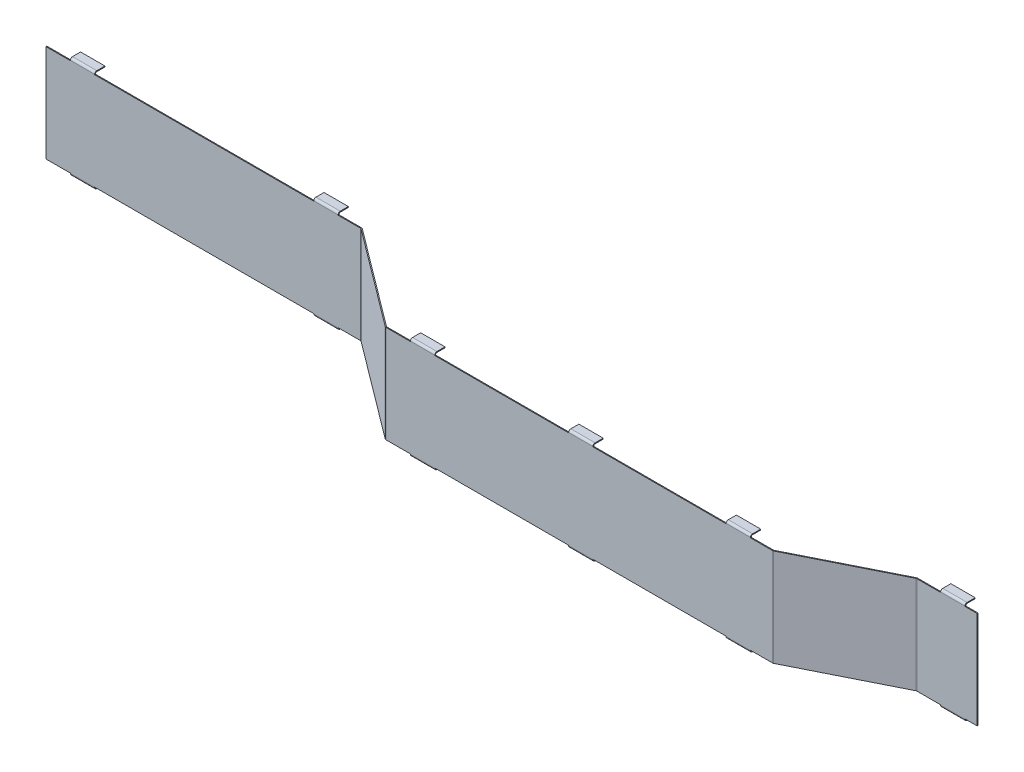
ISO-10303-21;
HEADER;
FILE_DESCRIPTION(('STEP AP214'),'2;1');
FILE_NAME('part.step','',(''),(''),'','','');
FILE_SCHEMA(('AUTOMOTIVE_DESIGN { 1 0 10303 214 1 1 1 1 }'));
ENDSEC;
DATA;
#1=APPLICATION_CONTEXT('core data for automotive mechanical design processes');
#2=APPLICATION_PROTOCOL_DEFINITION('international standard','automotive_design',2000,#1);
#3=PRODUCT_CONTEXT('',#1,'mechanical');
#4=PRODUCT('Part','Part','',(#3));
#5=PRODUCT_RELATED_PRODUCT_CATEGORY('part','',(#4));
#6=PRODUCT_DEFINITION_FORMATION('','',#4);
#7=PRODUCT_DEFINITION_CONTEXT('part definition',#1,'design');
#8=PRODUCT_DEFINITION('design','',#6,#7);
#9=PRODUCT_DEFINITION_SHAPE('','',#8);
#10=(LENGTH_UNIT() NAMED_UNIT(*) SI_UNIT(.MILLI.,.METRE.));
#11=(NAMED_UNIT(*) PLANE_ANGLE_UNIT() SI_UNIT($,.RADIAN.));
#12=(NAMED_UNIT(*) SI_UNIT($,.STERADIAN.) SOLID_ANGLE_UNIT());
#13=UNCERTAINTY_MEASURE_WITH_UNIT(LENGTH_MEASURE(1.E-05),#10,'distance_accuracy_value','');
#14=(GEOMETRIC_REPRESENTATION_CONTEXT(3) GLOBAL_UNCERTAINTY_ASSIGNED_CONTEXT((#13)) GLOBAL_UNIT_ASSIGNED_CONTEXT((#10,
#11,#12)) REPRESENTATION_CONTEXT('',''));
#15=CARTESIAN_POINT('',(0.,0.,0.));
#16=DIRECTION('',(0.,0.,1.));
#17=DIRECTION('',(1.,0.,0.));
#18=AXIS2_PLACEMENT_3D('',#15,#16,#17);
#19=CARTESIAN_POINT('',(0.,0.,-0.9144));
#20=DIRECTION('',(0.,0.,1.));
#21=DIRECTION('',(1.,0.,0.));
#22=AXIS2_PLACEMENT_3D('',#19,#20,#21);
#23=PLANE('',#22);
#24=DIRECTION('',(-1.,0.,0.));
#25=VECTOR('',#24,1.);
#26=CARTESIAN_POINT('',(25.4,-0.304800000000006,-0.914399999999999));
#27=LINE('',#26,#25);
#28=CARTESIAN_POINT('',(25.4,-0.304800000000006,-0.914399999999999));
#29=VERTEX_POINT('',#28);
#30=CARTESIAN_POINT('',(50.8,-0.304800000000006,-0.914399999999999));
#31=VERTEX_POINT('',#30);
#32=EDGE_CURVE('E1127',#29,#31,#27,.F.);
#33=ORIENTED_EDGE('',*,*,#32,.F.);
#34=DIRECTION('',(0.,-1.,0.));
#35=VECTOR('',#34,1.);
#36=CARTESIAN_POINT('',(25.4,0.,-0.9144));
#37=LINE('',#36,#35);
#38=CARTESIAN_POINT('',(25.4,0.,-0.9144));
#39=VERTEX_POINT('',#38);
#40=EDGE_CURVE('E2057',#39,#29,#37,.T.);
#41=ORIENTED_EDGE('',*,*,#40,.F.);
#42=DIRECTION('',(1.,0.,0.));
#43=VECTOR('',#42,1.);
#44=CARTESIAN_POINT('',(330.2,0.,-0.9144));
#45=LINE('',#44,#43);
#46=CARTESIAN_POINT('',(0.,0.,-0.9144));
#47=VERTEX_POINT('',#46);
#48=EDGE_CURVE('E2113',#47,#39,#45,.T.);
#49=ORIENTED_EDGE('',*,*,#48,.F.);
#50=DIRECTION('',(0.,-1.,0.));
#51=VECTOR('',#50,1.);
#52=CARTESIAN_POINT('',(0.,0.,-0.9144));
#53=LINE('',#52,#51);
#54=CARTESIAN_POINT('',(0.,101.6,-0.9144));
#55=VERTEX_POINT('',#54);
#56=EDGE_CURVE('E2107',#55,#47,#53,.T.);
#57=ORIENTED_EDGE('',*,*,#56,.F.);
#58=DIRECTION('',(-1.,0.,0.));
#59=VECTOR('',#58,1.);
#60=CARTESIAN_POINT('',(330.2,101.6,-0.9144));
#61=LINE('',#60,#59);
#62=CARTESIAN_POINT('',(25.4,101.6,-0.9144));
#63=VERTEX_POINT('',#62);
#64=EDGE_CURVE('E2109',#63,#55,#61,.T.);
#65=ORIENTED_EDGE('',*,*,#64,.F.);
#66=DIRECTION('',(0.,-1.,0.));
#67=VECTOR('',#66,1.);
#68=CARTESIAN_POINT('',(25.4,101.6,-0.9144));
#69=LINE('',#68,#67);
#70=CARTESIAN_POINT('',(25.4,101.9048,-0.9144));
#71=VERTEX_POINT('',#70);
#72=EDGE_CURVE('E2089',#71,#63,#69,.T.);
#73=ORIENTED_EDGE('',*,*,#72,.F.);
#74=DIRECTION('',(1.,0.,0.));
#75=VECTOR('',#74,1.);
#76=CARTESIAN_POINT('',(50.8,101.9048,-0.9144));
#77=LINE('',#76,#75);
#78=CARTESIAN_POINT('',(50.8,101.9048,-0.9144));
#79=VERTEX_POINT('',#78);
#80=EDGE_CURVE('E1710',#79,#71,#77,.F.);
#81=ORIENTED_EDGE('',*,*,#80,.F.);
#82=DIRECTION('',(0.,1.,0.));
#83=VECTOR('',#82,1.);
#84=CARTESIAN_POINT('',(50.8,101.6,-0.9144));
#85=LINE('',#84,#83);
#86=CARTESIAN_POINT('',(50.8,101.6,-0.9144));
#87=VERTEX_POINT('',#86);
#88=EDGE_CURVE('E2091',#87,#79,#85,.T.);
#89=ORIENTED_EDGE('',*,*,#88,.F.);
#90=CARTESIAN_POINT('',(279.4,101.6,-0.9144));
#91=VERTEX_POINT('',#90);
#92=EDGE_CURVE('E2108',#91,#87,#61,.T.);
#93=ORIENTED_EDGE('',*,*,#92,.F.);
#94=DIRECTION('',(0.,-1.,0.));
#95=VECTOR('',#94,1.);
#96=CARTESIAN_POINT('',(279.4,101.6,-0.9144));
#97=LINE('',#96,#95);
#98=CARTESIAN_POINT('',(279.4,101.9048,-0.9144));
#99=VERTEX_POINT('',#98);
#100=EDGE_CURVE('E2073',#99,#91,#97,.T.);
#101=ORIENTED_EDGE('',*,*,#100,.F.);
#102=DIRECTION('',(1.,0.,0.));
#103=VECTOR('',#102,1.);
#104=CARTESIAN_POINT('',(304.8,101.9048,-0.9144));
#105=LINE('',#104,#103);
#106=CARTESIAN_POINT('',(304.8,101.9048,-0.9144));
#107=VERTEX_POINT('',#106);
#108=EDGE_CURVE('E1657',#107,#99,#105,.F.);
#109=ORIENTED_EDGE('',*,*,#108,.F.);
#110=DIRECTION('',(0.,1.,0.));
#111=VECTOR('',#110,1.);
#112=CARTESIAN_POINT('',(304.8,101.6,-0.9144));
#113=LINE('',#112,#111);
#114=CARTESIAN_POINT('',(304.8,101.6,-0.9144));
#115=VERTEX_POINT('',#114);
#116=EDGE_CURVE('E2075',#115,#107,#113,.T.);
#117=ORIENTED_EDGE('',*,*,#116,.F.);
#118=CARTESIAN_POINT('',(328.235733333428,101.6,-0.914400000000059));
#119=VERTEX_POINT('',#118);
#120=EDGE_CURVE('E2105',#119,#115,#61,.T.);
#121=ORIENTED_EDGE('',*,*,#120,.F.);
#122=DIRECTION('',(0.,1.,0.));
#123=VECTOR('',#122,1.);
#124=CARTESIAN_POINT('',(328.235733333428,101.6,-0.914400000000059));
#125=LINE('',#124,#123);
#126=CARTESIAN_POINT('',(328.235733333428,0.,-0.9144));
#127=VERTEX_POINT('',#126);
#128=EDGE_CURVE('E2018',#119,#127,#125,.F.);
#129=ORIENTED_EDGE('',*,*,#128,.T.);
#130=CARTESIAN_POINT('',(304.8,0.,-0.9144));
#131=VERTEX_POINT('',#130);
#132=EDGE_CURVE('E2112',#131,#127,#45,.T.);
#133=ORIENTED_EDGE('',*,*,#132,.F.);
#134=DIRECTION('',(0.,1.,0.));
#135=VECTOR('',#134,1.);
#136=CARTESIAN_POINT('',(304.8,0.,-0.9144));
#137=LINE('',#136,#135);
#138=CARTESIAN_POINT('',(304.8,-0.304800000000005,-0.914399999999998));
#139=VERTEX_POINT('',#138);
#140=EDGE_CURVE('E2041',#139,#131,#137,.T.);
#141=ORIENTED_EDGE('',*,*,#140,.F.);
#142=DIRECTION('',(-1.,0.,0.));
#143=VECTOR('',#142,1.);
#144=CARTESIAN_POINT('',(279.4,-0.304800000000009,-0.914399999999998));
#145=LINE('',#144,#143);
#146=CARTESIAN_POINT('',(279.4,-0.304800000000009,-0.914399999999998));
#147=VERTEX_POINT('',#146);
#148=EDGE_CURVE('E1181',#147,#139,#145,.F.);
#149=ORIENTED_EDGE('',*,*,#148,.F.);
#150=DIRECTION('',(0.,-1.,0.));
#151=VECTOR('',#150,1.);
#152=CARTESIAN_POINT('',(279.4,0.,-0.9144));
#153=LINE('',#152,#151);
#154=CARTESIAN_POINT('',(279.4,0.,-0.9144));
#155=VERTEX_POINT('',#154);
#156=EDGE_CURVE('E2043',#155,#147,#153,.T.);
#157=ORIENTED_EDGE('',*,*,#156,.F.);
#158=CARTESIAN_POINT('',(50.8,0.,-0.9144));
#159=VERTEX_POINT('',#158);
#160=EDGE_CURVE('E2116',#159,#155,#45,.T.);
#161=ORIENTED_EDGE('',*,*,#160,.F.);
#162=DIRECTION('',(0.,1.,0.));
#163=VECTOR('',#162,1.);
#164=CARTESIAN_POINT('',(50.8,0.,-0.9144));
#165=LINE('',#164,#163);
#166=EDGE_CURVE('E2060',#31,#159,#165,.T.);
#167=ORIENTED_EDGE('',*,*,#166,.F.);
#168=EDGE_LOOP('',(#33,#41,#49,#57,#65,#73,#81,#89,#93,#101,#109,#117,#121,#129,#133,#141,#149,
#157,#161,#167));
#169=FACE_BOUND('',#168,.T.);
#170=ADVANCED_FACE('F359',(#169),#23,.F.);
#171=CARTESIAN_POINT('',(0.,0.,0.));
#172=DIRECTION('',(0.,0.,1.));
#173=DIRECTION('',(1.,0.,0.));
#174=AXIS2_PLACEMENT_3D('',#171,#172,#173);
#175=PLANE('',#174);
#176=DIRECTION('',(0.,-1.,0.));
#177=VECTOR('',#176,1.);
#178=CARTESIAN_POINT('',(25.4,0.,0.));
#179=LINE('',#178,#177);
#180=CARTESIAN_POINT('',(25.4,0.,0.));
#181=VERTEX_POINT('',#180);
#182=CARTESIAN_POINT('',(25.4,-0.304800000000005,0.));
#183=VERTEX_POINT('',#182);
#184=EDGE_CURVE('E2054',#181,#183,#179,.T.);
#185=ORIENTED_EDGE('',*,*,#184,.T.);
#186=DIRECTION('',(-1.,0.,0.));
#187=VECTOR('',#186,1.);
#188=CARTESIAN_POINT('',(25.4,-0.304800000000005,0.));
#189=LINE('',#188,#187);
#190=CARTESIAN_POINT('',(50.8,-0.304800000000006,0.));
#191=VERTEX_POINT('',#190);
#192=EDGE_CURVE('E1114',#183,#191,#189,.F.);
#193=ORIENTED_EDGE('',*,*,#192,.T.);
#194=DIRECTION('',(0.,1.,0.));
#195=VECTOR('',#194,1.);
#196=CARTESIAN_POINT('',(50.8,0.,0.));
#197=LINE('',#196,#195);
#198=CARTESIAN_POINT('',(50.8,0.,0.));
#199=VERTEX_POINT('',#198);
#200=EDGE_CURVE('E2061',#191,#199,#197,.T.);
#201=ORIENTED_EDGE('',*,*,#200,.T.);
#202=DIRECTION('',(1.,0.,0.));
#203=VECTOR('',#202,1.);
#204=CARTESIAN_POINT('',(330.2,0.,0.));
#205=LINE('',#204,#203);
#206=CARTESIAN_POINT('',(279.4,0.,0.));
#207=VERTEX_POINT('',#206);
#208=EDGE_CURVE('E2126',#199,#207,#205,.T.);
#209=ORIENTED_EDGE('',*,*,#208,.T.);
#210=DIRECTION('',(0.,-1.,0.));
#211=VECTOR('',#210,1.);
#212=CARTESIAN_POINT('',(279.4,0.,0.));
#213=LINE('',#212,#211);
#214=CARTESIAN_POINT('',(279.4,-0.304800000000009,0.));
#215=VERTEX_POINT('',#214);
#216=EDGE_CURVE('E2044',#207,#215,#213,.T.);
#217=ORIENTED_EDGE('',*,*,#216,.T.);
#218=DIRECTION('',(-1.,0.,0.));
#219=VECTOR('',#218,1.);
#220=CARTESIAN_POINT('',(279.4,-0.304800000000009,0.));
#221=LINE('',#220,#219);
#222=CARTESIAN_POINT('',(304.8,-0.304800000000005,0.));
#223=VERTEX_POINT('',#222);
#224=EDGE_CURVE('E1168',#215,#223,#221,.F.);
#225=ORIENTED_EDGE('',*,*,#224,.T.);
#226=DIRECTION('',(0.,1.,0.));
#227=VECTOR('',#226,1.);
#228=CARTESIAN_POINT('',(304.8,0.,0.));
#229=LINE('',#228,#227);
#230=CARTESIAN_POINT('',(304.8,0.,0.));
#231=VERTEX_POINT('',#230);
#232=EDGE_CURVE('E2038',#223,#231,#229,.T.);
#233=ORIENTED_EDGE('',*,*,#232,.T.);
#234=CARTESIAN_POINT('',(328.235733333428,0.,0.));
#235=VERTEX_POINT('',#234);
#236=EDGE_CURVE('E2123',#231,#235,#205,.T.);
#237=ORIENTED_EDGE('',*,*,#236,.T.);
#238=DIRECTION('',(0.,1.,0.));
#239=VECTOR('',#238,1.);
#240=CARTESIAN_POINT('',(328.235733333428,101.6,0.));
#241=LINE('',#240,#239);
#242=CARTESIAN_POINT('',(328.235733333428,101.6,0.));
#243=VERTEX_POINT('',#242);
#244=EDGE_CURVE('E2030',#243,#235,#241,.F.);
#245=ORIENTED_EDGE('',*,*,#244,.F.);
#246=DIRECTION('',(-1.,0.,0.));
#247=VECTOR('',#246,1.);
#248=CARTESIAN_POINT('',(330.2,101.6,0.));
#249=LINE('',#248,#247);
#250=CARTESIAN_POINT('',(304.8,101.6,0.));
#251=VERTEX_POINT('',#250);
#252=EDGE_CURVE('E2117',#243,#251,#249,.T.);
#253=ORIENTED_EDGE('',*,*,#252,.T.);
#254=DIRECTION('',(0.,1.,0.));
#255=VECTOR('',#254,1.);
#256=CARTESIAN_POINT('',(304.8,101.6,0.));
#257=LINE('',#256,#255);
#258=CARTESIAN_POINT('',(304.8,101.9048,0.));
#259=VERTEX_POINT('',#258);
#260=EDGE_CURVE('E2076',#251,#259,#257,.T.);
#261=ORIENTED_EDGE('',*,*,#260,.T.);
#262=DIRECTION('',(1.,0.,0.));
#263=VECTOR('',#262,1.);
#264=CARTESIAN_POINT('',(304.8,101.9048,0.));
#265=LINE('',#264,#263);
#266=CARTESIAN_POINT('',(279.4,101.9048,0.));
#267=VERTEX_POINT('',#266);
#268=EDGE_CURVE('E1644',#259,#267,#265,.F.);
#269=ORIENTED_EDGE('',*,*,#268,.T.);
#270=DIRECTION('',(0.,-1.,0.));
#271=VECTOR('',#270,1.);
#272=CARTESIAN_POINT('',(279.4,101.6,0.));
#273=LINE('',#272,#271);
#274=CARTESIAN_POINT('',(279.4,101.6,0.));
#275=VERTEX_POINT('',#274);
#276=EDGE_CURVE('E2070',#267,#275,#273,.T.);
#277=ORIENTED_EDGE('',*,*,#276,.T.);
#278=CARTESIAN_POINT('',(50.8,101.6,0.));
#279=VERTEX_POINT('',#278);
#280=EDGE_CURVE('E2120',#275,#279,#249,.T.);
#281=ORIENTED_EDGE('',*,*,#280,.T.);
#282=DIRECTION('',(0.,1.,0.));
#283=VECTOR('',#282,1.);
#284=CARTESIAN_POINT('',(50.8,101.6,0.));
#285=LINE('',#284,#283);
#286=CARTESIAN_POINT('',(50.8,101.9048,0.));
#287=VERTEX_POINT('',#286);
#288=EDGE_CURVE('E2092',#279,#287,#285,.T.);
#289=ORIENTED_EDGE('',*,*,#288,.T.);
#290=DIRECTION('',(1.,0.,0.));
#291=VECTOR('',#290,1.);
#292=CARTESIAN_POINT('',(50.8,101.9048,0.));
#293=LINE('',#292,#291);
#294=CARTESIAN_POINT('',(25.4,101.9048,0.));
#295=VERTEX_POINT('',#294);
#296=EDGE_CURVE('E1697',#287,#295,#293,.F.);
#297=ORIENTED_EDGE('',*,*,#296,.T.);
#298=DIRECTION('',(0.,-1.,0.));
#299=VECTOR('',#298,1.);
#300=CARTESIAN_POINT('',(25.4,101.6,0.));
#301=LINE('',#300,#299);
#302=CARTESIAN_POINT('',(25.4,101.6,0.));
#303=VERTEX_POINT('',#302);
#304=EDGE_CURVE('E2086',#295,#303,#301,.T.);
#305=ORIENTED_EDGE('',*,*,#304,.T.);
#306=CARTESIAN_POINT('',(0.,101.6,0.));
#307=VERTEX_POINT('',#306);
#308=EDGE_CURVE('E2102',#303,#307,#249,.T.);
#309=ORIENTED_EDGE('',*,*,#308,.T.);
#310=DIRECTION('',(0.,-1.,0.));
#311=VECTOR('',#310,1.);
#312=CARTESIAN_POINT('',(0.,0.,0.));
#313=LINE('',#312,#311);
#314=CARTESIAN_POINT('',(0.,0.,0.));
#315=VERTEX_POINT('',#314);
#316=EDGE_CURVE('E2119',#307,#315,#313,.T.);
#317=ORIENTED_EDGE('',*,*,#316,.T.);
#318=EDGE_CURVE('E2124',#315,#181,#205,.T.);
#319=ORIENTED_EDGE('',*,*,#318,.T.);
#320=EDGE_LOOP('',(#185,#193,#201,#209,#217,#225,#233,#237,#245,#253,#261,#269,#277,#281,#289,
#297,#305,#309,#317,#319));
#321=FACE_BOUND('',#320,.T.);
#322=ADVANCED_FACE('F2132',(#321),#175,.T.);
#323=CARTESIAN_POINT('',(25.4,0.,-0.9144));
#324=DIRECTION('',(-1.,0.,0.));
#325=DIRECTION('',(0.,0.,1.));
#326=AXIS2_PLACEMENT_3D('',#323,#324,#325);
#327=PLANE('',#326);
#328=ORIENTED_EDGE('',*,*,#40,.T.);
#329=DIRECTION('',(0.,0.,1.));
#330=VECTOR('',#329,1.);
#331=CARTESIAN_POINT('',(25.4,-0.304800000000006,-0.914399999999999));
#332=LINE('',#331,#330);
#333=EDGE_CURVE('E1121',#29,#183,#332,.T.);
#334=ORIENTED_EDGE('',*,*,#333,.T.);
#335=ORIENTED_EDGE('',*,*,#184,.F.);
#336=DIRECTION('',(0.,0.,1.));
#337=VECTOR('',#336,1.);
#338=CARTESIAN_POINT('',(25.4,0.,-0.9144));
#339=LINE('',#338,#337);
#340=EDGE_CURVE('E2067',#39,#181,#339,.T.);
#341=ORIENTED_EDGE('',*,*,#340,.F.);
#342=EDGE_LOOP('',(#328,#334,#335,#341));
#343=FACE_BOUND('',#342,.T.);
#344=ADVANCED_FACE('F2221',(#343),#327,.T.);
#345=CARTESIAN_POINT('',(279.4,0.,-0.9144));
#346=DIRECTION('',(-1.,0.,0.));
#347=DIRECTION('',(0.,0.,1.));
#348=AXIS2_PLACEMENT_3D('',#345,#346,#347);
#349=PLANE('',#348);
#350=ORIENTED_EDGE('',*,*,#156,.T.);
#351=DIRECTION('',(0.,0.,1.));
#352=VECTOR('',#351,1.);
#353=CARTESIAN_POINT('',(279.4,-0.304800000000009,-0.914399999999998));
#354=LINE('',#353,#352);
#355=EDGE_CURVE('E1175',#147,#215,#354,.T.);
#356=ORIENTED_EDGE('',*,*,#355,.T.);
#357=ORIENTED_EDGE('',*,*,#216,.F.);
#358=DIRECTION('',(0.,0.,1.));
#359=VECTOR('',#358,1.);
#360=CARTESIAN_POINT('',(279.4,0.,-0.9144));
#361=LINE('',#360,#359);
#362=EDGE_CURVE('E2051',#155,#207,#361,.T.);
#363=ORIENTED_EDGE('',*,*,#362,.F.);
#364=EDGE_LOOP('',(#350,#356,#357,#363));
#365=FACE_BOUND('',#364,.T.);
#366=ADVANCED_FACE('F2185',(#365),#349,.T.);
#367=CARTESIAN_POINT('',(-1.82879999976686,0.,25.5523999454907));
#368=DIRECTION('',(0.,0.,1.));
#369=DIRECTION('',(1.,0.,0.));
#370=AXIS2_PLACEMENT_3D('',#367,#368,#369);
#371=PLANE('',#370);
#372=DIRECTION('',(-1.,0.,0.));
#373=VECTOR('',#372,1.);
#374=CARTESIAN_POINT('',(960.005739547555,-0.304800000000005,25.5523999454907));
#375=LINE('',#374,#373);
#376=CARTESIAN_POINT('',(960.005739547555,-0.304800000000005,25.5523999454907));
#377=VERTEX_POINT('',#376);
#378=CARTESIAN_POINT('',(985.405739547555,-0.304800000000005,25.5523999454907));
#379=VERTEX_POINT('',#378);
#380=EDGE_CURVE('E1234',#377,#379,#375,.F.);
#381=ORIENTED_EDGE('',*,*,#380,.F.);
#382=DIRECTION('',(0.,-1.,0.));
#383=VECTOR('',#382,1.);
#384=CARTESIAN_POINT('',(960.005739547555,0.,25.5523999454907));
#385=LINE('',#384,#383);
#386=CARTESIAN_POINT('',(960.005739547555,1.65042767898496E-11,25.5523999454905));
#387=VERTEX_POINT('',#386);
#388=EDGE_CURVE('E1720',#387,#377,#385,.T.);
#389=ORIENTED_EDGE('',*,*,#388,.F.);
#390=DIRECTION('',(-1.,0.,0.));
#391=VECTOR('',#390,1.);
#392=CARTESIAN_POINT('',(-1.82879999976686,0.,25.5523999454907));
#393=LINE('',#392,#391);
#394=CARTESIAN_POINT('',(935.133398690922,2.70616862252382E-12,25.5523999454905));
#395=VERTEX_POINT('',#394);
#396=EDGE_CURVE('E1768',#387,#395,#393,.T.);
#397=ORIENTED_EDGE('',*,*,#396,.T.);
#398=DIRECTION('',(0.,1.,0.));
#399=VECTOR('',#398,1.);
#400=CARTESIAN_POINT('',(935.133398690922,3.24187372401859E-12,25.5523999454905));
#401=LINE('',#400,#399);
#402=CARTESIAN_POINT('',(935.133398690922,101.600000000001,25.5523999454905));
#403=VERTEX_POINT('',#402);
#404=EDGE_CURVE('E1779',#403,#395,#401,.F.);
#405=ORIENTED_EDGE('',*,*,#404,.F.);
#406=DIRECTION('',(1.,0.,0.));
#407=VECTOR('',#406,1.);
#408=CARTESIAN_POINT('',(-1.82879999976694,101.6,25.5523999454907));
#409=LINE('',#408,#407);
#410=CARTESIAN_POINT('',(960.005739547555,101.600000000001,25.5523999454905));
#411=VERTEX_POINT('',#410);
#412=EDGE_CURVE('E1761',#403,#411,#409,.T.);
#413=ORIENTED_EDGE('',*,*,#412,.T.);
#414=DIRECTION('',(0.,-1.,0.));
#415=VECTOR('',#414,1.);
#416=CARTESIAN_POINT('',(960.005739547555,101.600000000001,25.5523999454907));
#417=LINE('',#416,#415);
#418=CARTESIAN_POINT('',(960.005739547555,101.904800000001,25.5523999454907));
#419=VERTEX_POINT('',#418);
#420=EDGE_CURVE('E1736',#419,#411,#417,.T.);
#421=ORIENTED_EDGE('',*,*,#420,.F.);
#422=DIRECTION('',(1.,0.,0.));
#423=VECTOR('',#422,1.);
#424=CARTESIAN_POINT('',(985.405739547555,101.904800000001,25.5523999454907));
#425=LINE('',#424,#423);
#426=CARTESIAN_POINT('',(985.405739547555,101.904800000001,25.5523999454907));
#427=VERTEX_POINT('',#426);
#428=EDGE_CURVE('E1604',#427,#419,#425,.F.);
#429=ORIENTED_EDGE('',*,*,#428,.F.);
#430=DIRECTION('',(0.,1.,0.));
#431=VECTOR('',#430,1.);
#432=CARTESIAN_POINT('',(985.405739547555,101.600000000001,25.5523999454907));
#433=LINE('',#432,#431);
#434=CARTESIAN_POINT('',(985.405739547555,101.600000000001,25.5523999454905));
#435=VERTEX_POINT('',#434);
#436=EDGE_CURVE('E1738',#435,#427,#433,.T.);
#437=ORIENTED_EDGE('',*,*,#436,.F.);
#438=CARTESIAN_POINT('',(998.105739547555,101.600000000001,25.5523999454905));
#439=VERTEX_POINT('',#438);
#440=EDGE_CURVE('E1764',#435,#439,#409,.T.);
#441=ORIENTED_EDGE('',*,*,#440,.T.);
#442=DIRECTION('',(0.,-1.,0.));
#443=VECTOR('',#442,1.);
#444=CARTESIAN_POINT('',(998.105739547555,1.08630643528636E-12,25.5523999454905));
#445=LINE('',#444,#443);
#446=CARTESIAN_POINT('',(998.105739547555,1.04716637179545E-11,25.5523999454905));
#447=VERTEX_POINT('',#446);
#448=EDGE_CURVE('E1759',#439,#447,#445,.T.);
#449=ORIENTED_EDGE('',*,*,#448,.T.);
#450=CARTESIAN_POINT('',(985.405739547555,1.69402875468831E-11,25.5523999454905));
#451=VERTEX_POINT('',#450);
#452=EDGE_CURVE('E1765',#447,#451,#393,.T.);
#453=ORIENTED_EDGE('',*,*,#452,.T.);
#454=DIRECTION('',(0.,1.,0.));
#455=VECTOR('',#454,1.);
#456=CARTESIAN_POINT('',(985.405739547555,0.,25.5523999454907));
#457=LINE('',#456,#455);
#458=EDGE_CURVE('E1723',#379,#451,#457,.T.);
#459=ORIENTED_EDGE('',*,*,#458,.F.);
#460=EDGE_LOOP('',(#381,#389,#397,#405,#413,#421,#429,#437,#441,#449,#453,#459));
#461=FACE_BOUND('',#460,.T.);
#462=ADVANCED_FACE('F2334',(#461),#371,.F.);
#463=CARTESIAN_POINT('',(-1.82879999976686,0.,26.4667999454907));
#464=DIRECTION('',(0.,0.,1.));
#465=DIRECTION('',(1.,0.,0.));
#466=AXIS2_PLACEMENT_3D('',#463,#464,#465);
#467=PLANE('',#466);
#468=DIRECTION('',(0.,-1.,0.));
#469=VECTOR('',#468,1.);
#470=CARTESIAN_POINT('',(960.005739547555,0.,26.4667999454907));
#471=LINE('',#470,#469);
#472=CARTESIAN_POINT('',(960.005739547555,0.,26.4667999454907));
#473=VERTEX_POINT('',#472);
#474=CARTESIAN_POINT('',(960.005739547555,-0.304800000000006,26.4667999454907));
#475=VERTEX_POINT('',#474);
#476=EDGE_CURVE('E1717',#473,#475,#471,.T.);
#477=ORIENTED_EDGE('',*,*,#476,.T.);
#478=DIRECTION('',(-1.,0.,0.));
#479=VECTOR('',#478,1.);
#480=CARTESIAN_POINT('',(960.005739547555,-0.304800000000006,26.4667999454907));
#481=LINE('',#480,#479);
#482=CARTESIAN_POINT('',(985.405739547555,-0.304800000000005,26.4667999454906));
#483=VERTEX_POINT('',#482);
#484=EDGE_CURVE('E1221',#475,#483,#481,.F.);
#485=ORIENTED_EDGE('',*,*,#484,.T.);
#486=DIRECTION('',(0.,1.,0.));
#487=VECTOR('',#486,1.);
#488=CARTESIAN_POINT('',(985.405739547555,0.,26.4667999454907));
#489=LINE('',#488,#487);
#490=CARTESIAN_POINT('',(985.405739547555,3.56687300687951E-12,26.4667999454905));
#491=VERTEX_POINT('',#490);
#492=EDGE_CURVE('E1724',#483,#491,#489,.T.);
#493=ORIENTED_EDGE('',*,*,#492,.T.);
#494=DIRECTION('',(1.,0.,0.));
#495=VECTOR('',#494,1.);
#496=CARTESIAN_POINT('',(934.821600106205,2.69855690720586E-12,26.4667999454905));
#497=LINE('',#496,#495);
#498=CARTESIAN_POINT('',(998.105739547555,3.78487838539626E-12,26.4667999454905));
#499=VERTEX_POINT('',#498);
#500=EDGE_CURVE('E1775',#499,#491,#497,.F.);
#501=ORIENTED_EDGE('',*,*,#500,.F.);
#502=DIRECTION('',(0.,1.,0.));
#503=VECTOR('',#502,1.);
#504=CARTESIAN_POINT('',(998.105739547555,3.78487838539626E-12,26.4667999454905));
#505=LINE('',#504,#503);
#506=CARTESIAN_POINT('',(998.105739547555,101.600000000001,26.4667999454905));
#507=VERTEX_POINT('',#506);
#508=EDGE_CURVE('E1769',#507,#499,#505,.F.);
#509=ORIENTED_EDGE('',*,*,#508,.F.);
#510=DIRECTION('',(-1.,0.,0.));
#511=VECTOR('',#510,1.);
#512=CARTESIAN_POINT('',(998.105739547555,101.600000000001,26.4667999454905));
#513=LINE('',#512,#511);
#514=CARTESIAN_POINT('',(985.405739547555,101.600000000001,26.4667999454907));
#515=VERTEX_POINT('',#514);
#516=EDGE_CURVE('E1774',#515,#507,#513,.F.);
#517=ORIENTED_EDGE('',*,*,#516,.F.);
#518=DIRECTION('',(0.,1.,0.));
#519=VECTOR('',#518,1.);
#520=CARTESIAN_POINT('',(985.405739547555,101.600000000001,26.4667999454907));
#521=LINE('',#520,#519);
#522=CARTESIAN_POINT('',(985.405739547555,101.904800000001,26.4667999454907));
#523=VERTEX_POINT('',#522);
#524=EDGE_CURVE('E1739',#515,#523,#521,.T.);
#525=ORIENTED_EDGE('',*,*,#524,.T.);
#526=DIRECTION('',(1.,0.,0.));
#527=VECTOR('',#526,1.);
#528=CARTESIAN_POINT('',(985.405739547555,101.904800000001,26.4667999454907));
#529=LINE('',#528,#527);
#530=CARTESIAN_POINT('',(960.005739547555,101.904800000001,26.4667999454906));
#531=VERTEX_POINT('',#530);
#532=EDGE_CURVE('E1591',#523,#531,#529,.F.);
#533=ORIENTED_EDGE('',*,*,#532,.T.);
#534=DIRECTION('',(0.,-1.,0.));
#535=VECTOR('',#534,1.);
#536=CARTESIAN_POINT('',(960.005739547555,101.600000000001,26.4667999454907));
#537=LINE('',#536,#535);
#538=CARTESIAN_POINT('',(960.005739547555,101.600000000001,26.4667999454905));
#539=VERTEX_POINT('',#538);
#540=EDGE_CURVE('E1733',#531,#539,#537,.T.);
#541=ORIENTED_EDGE('',*,*,#540,.T.);
#542=CARTESIAN_POINT('',(935.133398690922,101.600000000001,26.4667999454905));
#543=VERTEX_POINT('',#542);
#544=EDGE_CURVE('E1771',#543,#539,#513,.F.);
#545=ORIENTED_EDGE('',*,*,#544,.F.);
#546=DIRECTION('',(0.,1.,0.));
#547=VECTOR('',#546,1.);
#548=CARTESIAN_POINT('',(935.133398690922,3.24171759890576E-12,26.4667999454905));
#549=LINE('',#548,#547);
#550=CARTESIAN_POINT('',(935.133398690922,2.70616862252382E-12,26.4667999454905));
#551=VERTEX_POINT('',#550);
#552=EDGE_CURVE('E1785',#551,#543,#549,.T.);
#553=ORIENTED_EDGE('',*,*,#552,.F.);
#554=EDGE_CURVE('E1778',#473,#551,#497,.F.);
#555=ORIENTED_EDGE('',*,*,#554,.F.);
#556=EDGE_LOOP('',(#477,#485,#493,#501,#509,#517,#525,#533,#541,#545,#553,#555));
#557=FACE_BOUND('',#556,.T.);
#558=ADVANCED_FACE('F2322',(#557),#467,.T.);
#559=CARTESIAN_POINT('',(960.005739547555,0.,25.5523999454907));
#560=DIRECTION('',(-1.,0.,0.));
#561=DIRECTION('',(0.,0.,1.));
#562=AXIS2_PLACEMENT_3D('',#559,#560,#561);
#563=PLANE('',#562);
#564=ORIENTED_EDGE('',*,*,#388,.T.);
#565=DIRECTION('',(0.,0.,1.));
#566=VECTOR('',#565,1.);
#567=CARTESIAN_POINT('',(960.005739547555,-0.304800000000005,25.5523999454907));
#568=LINE('',#567,#566);
#569=EDGE_CURVE('E1228',#377,#475,#568,.T.);
#570=ORIENTED_EDGE('',*,*,#569,.T.);
#571=ORIENTED_EDGE('',*,*,#476,.F.);
#572=DIRECTION('',(0.,0.,1.));
#573=VECTOR('',#572,1.);
#574=CARTESIAN_POINT('',(960.005739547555,0.,25.5523999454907));
#575=LINE('',#574,#573);
#576=EDGE_CURVE('E1730',#387,#473,#575,.T.);
#577=ORIENTED_EDGE('',*,*,#576,.F.);
#578=EDGE_LOOP('',(#564,#570,#571,#577));
#579=FACE_BOUND('',#578,.T.);
#580=ADVANCED_FACE('F2318',(#579),#563,.T.);
#581=CARTESIAN_POINT('',(-1.21919999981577,0.,76.3524000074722));
#582=DIRECTION('',(0.,0.,-1.));
#583=DIRECTION('',(0.,1.,0.));
#584=AXIS2_PLACEMENT_3D('',#581,#582,#583);
#585=PLANE('',#584);
#586=DIRECTION('',(-1.,0.,0.));
#587=VECTOR('',#586,1.);
#588=CARTESIAN_POINT('',(786.079199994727,-0.304799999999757,76.3524000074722));
#589=LINE('',#588,#587);
#590=CARTESIAN_POINT('',(786.079199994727,-0.304799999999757,76.3524000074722));
#591=VERTEX_POINT('',#590);
#592=CARTESIAN_POINT('',(811.479199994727,-0.304799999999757,76.3524000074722));
#593=VERTEX_POINT('',#592);
#594=EDGE_CURVE('E1274',#591,#593,#589,.F.);
#595=ORIENTED_EDGE('',*,*,#594,.T.);
#596=DIRECTION('',(0.,1.,0.));
#597=VECTOR('',#596,1.);
#598=CARTESIAN_POINT('',(811.479199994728,2.5641193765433E-13,76.3524000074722));
#599=LINE('',#598,#597);
#600=CARTESIAN_POINT('',(811.479199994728,9.53709568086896E-13,76.3524000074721));
#601=VERTEX_POINT('',#600);
#602=EDGE_CURVE('E1887',#593,#601,#599,.T.);
#603=ORIENTED_EDGE('',*,*,#602,.T.);
#604=DIRECTION('',(1.,0.,0.));
#605=VECTOR('',#604,1.);
#606=CARTESIAN_POINT('',(-1.21919999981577,0.,76.3524000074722));
#607=LINE('',#606,#605);
#608=CARTESIAN_POINT('',(834.522740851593,4.75066699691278E-13,76.3524000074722));
#609=VERTEX_POINT('',#608);
#610=EDGE_CURVE('E1950',#601,#609,#607,.T.);
#611=ORIENTED_EDGE('',*,*,#610,.T.);
#612=DIRECTION('',(0.,-1.,0.));
#613=VECTOR('',#612,1.);
#614=CARTESIAN_POINT('',(834.522740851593,4.71844785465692E-13,76.3524000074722));
#615=LINE('',#614,#613);
#616=CARTESIAN_POINT('',(834.522740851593,101.6,76.3524000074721));
#617=VERTEX_POINT('',#616);
#618=EDGE_CURVE('E1833',#609,#617,#615,.F.);
#619=ORIENTED_EDGE('',*,*,#618,.T.);
#620=DIRECTION('',(-1.,0.,0.));
#621=VECTOR('',#620,1.);
#622=CARTESIAN_POINT('',(-1.21919999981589,101.599999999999,76.3524000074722));
#623=LINE('',#622,#621);
#624=CARTESIAN_POINT('',(811.479199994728,101.6,76.3524000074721));
#625=VERTEX_POINT('',#624);
#626=EDGE_CURVE('E1948',#617,#625,#623,.T.);
#627=ORIENTED_EDGE('',*,*,#626,.T.);
#628=DIRECTION('',(0.,1.,0.));
#629=VECTOR('',#628,1.);
#630=CARTESIAN_POINT('',(811.479199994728,101.6,76.3524000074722));
#631=LINE('',#630,#629);
#632=CARTESIAN_POINT('',(811.479199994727,101.9048,76.3524000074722));
#633=VERTEX_POINT('',#632);
#634=EDGE_CURVE('E1915',#625,#633,#631,.T.);
#635=ORIENTED_EDGE('',*,*,#634,.T.);
#636=DIRECTION('',(1.,0.,0.));
#637=VECTOR('',#636,1.);
#638=CARTESIAN_POINT('',(811.479199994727,101.9048,76.3524000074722));
#639=LINE('',#638,#637);
#640=CARTESIAN_POINT('',(786.079199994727,101.9048,76.3524000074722));
#641=VERTEX_POINT('',#640);
#642=EDGE_CURVE('E1432',#633,#641,#639,.F.);
#643=ORIENTED_EDGE('',*,*,#642,.T.);
#644=DIRECTION('',(0.,-1.,0.));
#645=VECTOR('',#644,1.);
#646=CARTESIAN_POINT('',(786.079199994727,101.6,76.3524000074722));
#647=LINE('',#646,#645);
#648=CARTESIAN_POINT('',(786.079199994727,101.6,76.3524000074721));
#649=VERTEX_POINT('',#648);
#650=EDGE_CURVE('E1909',#641,#649,#647,.T.);
#651=ORIENTED_EDGE('',*,*,#650,.T.);
#652=CARTESIAN_POINT('',(647.124266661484,101.6,76.3524000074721));
#653=VERTEX_POINT('',#652);
#654=EDGE_CURVE('E1951',#649,#653,#623,.T.);
#655=ORIENTED_EDGE('',*,*,#654,.T.);
#656=DIRECTION('',(0.,1.,0.));
#657=VECTOR('',#656,1.);
#658=CARTESIAN_POINT('',(647.124266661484,101.6,76.3524000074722));
#659=LINE('',#658,#657);
#660=CARTESIAN_POINT('',(647.124266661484,101.9048,76.3524000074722));
#661=VERTEX_POINT('',#660);
#662=EDGE_CURVE('E1873',#653,#661,#659,.T.);
#663=ORIENTED_EDGE('',*,*,#662,.T.);
#664=DIRECTION('',(1.,0.,0.));
#665=VECTOR('',#664,1.);
#666=CARTESIAN_POINT('',(647.124266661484,101.9048,76.3524000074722));
#667=LINE('',#666,#665);
#668=CARTESIAN_POINT('',(621.724266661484,101.9048,76.3524000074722));
#669=VERTEX_POINT('',#668);
#670=EDGE_CURVE('E1485',#661,#669,#667,.F.);
#671=ORIENTED_EDGE('',*,*,#670,.T.);
#672=DIRECTION('',(0.,-1.,0.));
#673=VECTOR('',#672,1.);
#674=CARTESIAN_POINT('',(621.724266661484,101.6,76.3524000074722));
#675=LINE('',#674,#673);
#676=CARTESIAN_POINT('',(621.724266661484,101.6,76.3524000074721));
#677=VERTEX_POINT('',#676);
#678=EDGE_CURVE('E1867',#669,#677,#675,.T.);
#679=ORIENTED_EDGE('',*,*,#678,.T.);
#680=CARTESIAN_POINT('',(482.024266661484,101.6,76.3524000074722));
#681=VERTEX_POINT('',#680);
#682=EDGE_CURVE('E1952',#677,#681,#623,.T.);
#683=ORIENTED_EDGE('',*,*,#682,.T.);
#684=DIRECTION('',(0.,1.,0.));
#685=VECTOR('',#684,1.);
#686=CARTESIAN_POINT('',(482.024266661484,101.6,76.3524000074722));
#687=LINE('',#686,#685);
#688=CARTESIAN_POINT('',(482.024266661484,101.9048,76.3524000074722));
#689=VERTEX_POINT('',#688);
#690=EDGE_CURVE('E1930',#681,#689,#687,.T.);
#691=ORIENTED_EDGE('',*,*,#690,.T.);
#692=DIRECTION('',(1.,0.,0.));
#693=VECTOR('',#692,1.);
#694=CARTESIAN_POINT('',(482.024266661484,101.9048,76.3524000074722));
#695=LINE('',#694,#693);
#696=CARTESIAN_POINT('',(456.624266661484,101.9048,76.3524000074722));
#697=VERTEX_POINT('',#696);
#698=EDGE_CURVE('E1538',#689,#697,#695,.F.);
#699=ORIENTED_EDGE('',*,*,#698,.T.);
#700=DIRECTION('',(0.,-1.,0.));
#701=VECTOR('',#700,1.);
#702=CARTESIAN_POINT('',(456.624266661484,101.6,76.3524000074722));
#703=LINE('',#702,#701);
#704=CARTESIAN_POINT('',(456.624266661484,101.6,76.3524000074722));
#705=VERTEX_POINT('',#704);
#706=EDGE_CURVE('E1924',#697,#705,#703,.T.);
#707=ORIENTED_EDGE('',*,*,#706,.T.);
#708=CARTESIAN_POINT('',(431.224266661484,101.6,76.3524000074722));
#709=VERTEX_POINT('',#708);
#710=EDGE_CURVE('E1953',#705,#709,#623,.T.);
#711=ORIENTED_EDGE('',*,*,#710,.T.);
#712=DIRECTION('',(0.,-1.,0.));
#713=VECTOR('',#712,1.);
#714=CARTESIAN_POINT('',(431.224266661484,101.6,76.3524000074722));
#715=LINE('',#714,#713);
#716=CARTESIAN_POINT('',(431.224266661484,2.5641193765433E-13,76.3524000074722));
#717=VERTEX_POINT('',#716);
#718=EDGE_CURVE('E1964',#717,#709,#715,.F.);
#719=ORIENTED_EDGE('',*,*,#718,.F.);
#720=CARTESIAN_POINT('',(456.624266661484,5.41546718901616E-13,76.3524000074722));
#721=VERTEX_POINT('',#720);
#722=EDGE_CURVE('E1942',#717,#721,#607,.T.);
#723=ORIENTED_EDGE('',*,*,#722,.T.);
#724=DIRECTION('',(0.,-1.,0.));
#725=VECTOR('',#724,1.);
#726=CARTESIAN_POINT('',(456.624266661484,2.5641193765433E-13,76.3524000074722));
#727=LINE('',#726,#725);
#728=CARTESIAN_POINT('',(456.624266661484,-0.304799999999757,76.3524000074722));
#729=VERTEX_POINT('',#728);
#730=EDGE_CURVE('E1895',#721,#729,#727,.T.);
#731=ORIENTED_EDGE('',*,*,#730,.T.);
#732=DIRECTION('',(-1.,0.,0.));
#733=VECTOR('',#732,1.);
#734=CARTESIAN_POINT('',(456.624266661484,-0.304799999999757,76.3524000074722));
#735=LINE('',#734,#733);
#736=CARTESIAN_POINT('',(482.024266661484,-0.304799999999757,76.3524000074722));
#737=VERTEX_POINT('',#736);
#738=EDGE_CURVE('E1378',#729,#737,#735,.F.);
#739=ORIENTED_EDGE('',*,*,#738,.T.);
#740=DIRECTION('',(0.,1.,0.));
#741=VECTOR('',#740,1.);
#742=CARTESIAN_POINT('',(482.024266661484,2.5641193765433E-13,76.3524000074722));
#743=LINE('',#742,#741);
#744=CARTESIAN_POINT('',(482.024266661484,5.71048736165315E-13,76.3524000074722));
#745=VERTEX_POINT('',#744);
#746=EDGE_CURVE('E1902',#737,#745,#743,.T.);
#747=ORIENTED_EDGE('',*,*,#746,.T.);
#748=CARTESIAN_POINT('',(621.724266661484,7.33309831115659E-13,76.3524000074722));
#749=VERTEX_POINT('',#748);
#750=EDGE_CURVE('E1946',#745,#749,#607,.T.);
#751=ORIENTED_EDGE('',*,*,#750,.T.);
#752=DIRECTION('',(0.,-1.,0.));
#753=VECTOR('',#752,1.);
#754=CARTESIAN_POINT('',(621.724266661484,2.5641193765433E-13,76.3524000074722));
#755=LINE('',#754,#753);
#756=CARTESIAN_POINT('',(621.724266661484,-0.304799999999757,76.3524000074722));
#757=VERTEX_POINT('',#756);
#758=EDGE_CURVE('E1853',#749,#757,#755,.T.);
#759=ORIENTED_EDGE('',*,*,#758,.T.);
#760=DIRECTION('',(-1.,0.,0.));
#761=VECTOR('',#760,1.);
#762=CARTESIAN_POINT('',(621.724266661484,-0.304799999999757,76.3524000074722));
#763=LINE('',#762,#761);
#764=CARTESIAN_POINT('',(647.124266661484,-0.304799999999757,76.3524000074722));
#765=VERTEX_POINT('',#764);
#766=EDGE_CURVE('E1324',#757,#765,#763,.F.);
#767=ORIENTED_EDGE('',*,*,#766,.T.);
#768=DIRECTION('',(0.,1.,0.));
#769=VECTOR('',#768,1.);
#770=CARTESIAN_POINT('',(647.124266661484,2.5641193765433E-13,76.3524000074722));
#771=LINE('',#770,#769);
#772=CARTESIAN_POINT('',(647.124266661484,7.62811848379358E-13,76.3524000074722));
#773=VERTEX_POINT('',#772);
#774=EDGE_CURVE('E1860',#765,#773,#771,.T.);
#775=ORIENTED_EDGE('',*,*,#774,.T.);
#776=CARTESIAN_POINT('',(786.079199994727,9.24207550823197E-13,76.3524000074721));
#777=VERTEX_POINT('',#776);
#778=EDGE_CURVE('E1947',#773,#777,#607,.T.);
#779=ORIENTED_EDGE('',*,*,#778,.T.);
#780=DIRECTION('',(0.,-1.,0.));
#781=VECTOR('',#780,1.);
#782=CARTESIAN_POINT('',(786.079199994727,2.5641193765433E-13,76.3524000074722));
#783=LINE('',#782,#781);
#784=EDGE_CURVE('E1881',#777,#591,#783,.T.);
#785=ORIENTED_EDGE('',*,*,#784,.T.);
#786=EDGE_LOOP('',(#595,#603,#611,#619,#627,#635,#643,#651,#655,#663,#671,#679,#683,#691,#699,
#707,#711,#719,#723,#731,#739,#747,#751,#759,#767,#775,#779,#785));
#787=FACE_BOUND('',#786,.T.);
#788=ADVANCED_FACE('F2321',(#787),#585,.F.);
#789=CARTESIAN_POINT('',(-1.21919999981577,0.,75.4380000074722));
#790=DIRECTION('',(0.,0.,-1.));
#791=DIRECTION('',(0.,1.,0.));
#792=AXIS2_PLACEMENT_3D('',#789,#790,#791);
#793=PLANE('',#792);
#794=DIRECTION('',(0.,1.,0.));
#795=VECTOR('',#794,1.);
#796=CARTESIAN_POINT('',(811.479199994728,2.5641193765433E-13,75.4380000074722));
#797=LINE('',#796,#795);
#798=CARTESIAN_POINT('',(811.479199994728,-0.304799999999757,75.4380000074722));
#799=VERTEX_POINT('',#798);
#800=CARTESIAN_POINT('',(811.479199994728,2.5641193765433E-13,75.4380000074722));
#801=VERTEX_POINT('',#800);
#802=EDGE_CURVE('E1886',#799,#801,#797,.T.);
#803=ORIENTED_EDGE('',*,*,#802,.F.);
#804=DIRECTION('',(-1.,0.,0.));
#805=VECTOR('',#804,1.);
#806=CARTESIAN_POINT('',(786.079199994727,-0.304799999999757,75.4380000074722));
#807=LINE('',#806,#805);
#808=CARTESIAN_POINT('',(786.079199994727,-0.304799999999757,75.4380000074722));
#809=VERTEX_POINT('',#808);
#810=EDGE_CURVE('E374',#809,#799,#807,.F.);
#811=ORIENTED_EDGE('',*,*,#810,.F.);
#812=DIRECTION('',(0.,-1.,0.));
#813=VECTOR('',#812,1.);
#814=CARTESIAN_POINT('',(786.079199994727,2.5641193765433E-13,75.4380000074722));
#815=LINE('',#814,#813);
#816=CARTESIAN_POINT('',(786.079199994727,4.11883183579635E-13,75.4380000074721));
#817=VERTEX_POINT('',#816);
#818=EDGE_CURVE('E1884',#817,#809,#815,.T.);
#819=ORIENTED_EDGE('',*,*,#818,.F.);
#820=DIRECTION('',(-1.,0.,0.));
#821=VECTOR('',#820,1.);
#822=CARTESIAN_POINT('',(836.879199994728,4.70887218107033E-13,75.4380000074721));
#823=LINE('',#822,#821);
#824=CARTESIAN_POINT('',(647.124266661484,2.5641193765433E-13,75.4380000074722));
#825=VERTEX_POINT('',#824);
#826=EDGE_CURVE('E1957',#825,#817,#823,.F.);
#827=ORIENTED_EDGE('',*,*,#826,.F.);
#828=DIRECTION('',(0.,1.,0.));
#829=VECTOR('',#828,1.);
#830=CARTESIAN_POINT('',(647.124266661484,2.5641193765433E-13,75.4380000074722));
#831=LINE('',#830,#829);
#832=CARTESIAN_POINT('',(647.124266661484,-0.304799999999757,75.4380000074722));
#833=VERTEX_POINT('',#832);
#834=EDGE_CURVE('E1859',#833,#825,#831,.T.);
#835=ORIENTED_EDGE('',*,*,#834,.F.);
#836=DIRECTION('',(-1.,0.,0.));
#837=VECTOR('',#836,1.);
#838=CARTESIAN_POINT('',(621.724266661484,-0.304799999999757,75.4380000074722));
#839=LINE('',#838,#837);
#840=CARTESIAN_POINT('',(621.724266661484,-0.304799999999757,75.4380000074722));
#841=VERTEX_POINT('',#840);
#842=EDGE_CURVE('E1337',#841,#833,#839,.F.);
#843=ORIENTED_EDGE('',*,*,#842,.F.);
#844=DIRECTION('',(0.,-1.,0.));
#845=VECTOR('',#844,1.);
#846=CARTESIAN_POINT('',(621.724266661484,2.5641193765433E-13,75.4380000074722));
#847=LINE('',#846,#845);
#848=CARTESIAN_POINT('',(621.724266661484,2.20985463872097E-13,75.4380000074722));
#849=VERTEX_POINT('',#848);
#850=EDGE_CURVE('E1856',#849,#841,#847,.T.);
#851=ORIENTED_EDGE('',*,*,#850,.F.);
#852=CARTESIAN_POINT('',(482.024266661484,2.5641193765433E-13,75.4380000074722));
#853=VERTEX_POINT('',#852);
#854=EDGE_CURVE('E1956',#853,#849,#823,.F.);
#855=ORIENTED_EDGE('',*,*,#854,.F.);
#856=DIRECTION('',(0.,1.,0.));
#857=VECTOR('',#856,1.);
#858=CARTESIAN_POINT('',(482.024266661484,2.5641193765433E-13,75.4380000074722));
#859=LINE('',#858,#857);
#860=CARTESIAN_POINT('',(482.024266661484,-0.304799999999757,75.4380000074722));
#861=VERTEX_POINT('',#860);
#862=EDGE_CURVE('E1901',#861,#853,#859,.T.);
#863=ORIENTED_EDGE('',*,*,#862,.F.);
#864=DIRECTION('',(-1.,0.,0.));
#865=VECTOR('',#864,1.);
#866=CARTESIAN_POINT('',(456.624266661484,-0.304799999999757,75.4380000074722));
#867=LINE('',#866,#865);
#868=CARTESIAN_POINT('',(456.624266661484,-0.304799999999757,75.4380000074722));
#869=VERTEX_POINT('',#868);
#870=EDGE_CURVE('E1391',#869,#861,#867,.F.);
#871=ORIENTED_EDGE('',*,*,#870,.F.);
#872=DIRECTION('',(0.,-1.,0.));
#873=VECTOR('',#872,1.);
#874=CARTESIAN_POINT('',(456.624266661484,2.5641193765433E-13,75.4380000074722));
#875=LINE('',#874,#873);
#876=CARTESIAN_POINT('',(456.624266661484,0.,75.4380000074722));
#877=VERTEX_POINT('',#876);
#878=EDGE_CURVE('E1898',#877,#869,#875,.T.);
#879=ORIENTED_EDGE('',*,*,#878,.F.);
#880=CARTESIAN_POINT('',(431.224266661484,0.,75.4380000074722));
#881=VERTEX_POINT('',#880);
#882=EDGE_CURVE('E1954',#881,#877,#823,.F.);
#883=ORIENTED_EDGE('',*,*,#882,.F.);
#884=DIRECTION('',(0.,-1.,0.));
#885=VECTOR('',#884,1.);
#886=CARTESIAN_POINT('',(431.224266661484,101.6,75.4380000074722));
#887=LINE('',#886,#885);
#888=CARTESIAN_POINT('',(431.224266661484,101.6,75.4380000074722));
#889=VERTEX_POINT('',#888);
#890=EDGE_CURVE('E1970',#889,#881,#887,.T.);
#891=ORIENTED_EDGE('',*,*,#890,.F.);
#892=DIRECTION('',(1.,0.,0.));
#893=VECTOR('',#892,1.);
#894=CARTESIAN_POINT('',(430.783999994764,101.6,75.4380000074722));
#895=LINE('',#894,#893);
#896=CARTESIAN_POINT('',(456.624266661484,101.6,75.4380000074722));
#897=VERTEX_POINT('',#896);
#898=EDGE_CURVE('E1963',#897,#889,#895,.F.);
#899=ORIENTED_EDGE('',*,*,#898,.F.);
#900=DIRECTION('',(0.,-1.,0.));
#901=VECTOR('',#900,1.);
#902=CARTESIAN_POINT('',(456.624266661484,101.6,75.4380000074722));
#903=LINE('',#902,#901);
#904=CARTESIAN_POINT('',(456.624266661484,101.9048,75.4380000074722));
#905=VERTEX_POINT('',#904);
#906=EDGE_CURVE('E1927',#905,#897,#903,.T.);
#907=ORIENTED_EDGE('',*,*,#906,.F.);
#908=DIRECTION('',(1.,0.,0.));
#909=VECTOR('',#908,1.);
#910=CARTESIAN_POINT('',(482.024266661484,101.9048,75.4380000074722));
#911=LINE('',#910,#909);
#912=CARTESIAN_POINT('',(482.024266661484,101.9048,75.4380000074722));
#913=VERTEX_POINT('',#912);
#914=EDGE_CURVE('E1550',#913,#905,#911,.F.);
#915=ORIENTED_EDGE('',*,*,#914,.F.);
#916=DIRECTION('',(0.,1.,0.));
#917=VECTOR('',#916,1.);
#918=CARTESIAN_POINT('',(482.024266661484,101.6,75.4380000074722));
#919=LINE('',#918,#917);
#920=CARTESIAN_POINT('',(482.024266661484,101.6,75.4380000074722));
#921=VERTEX_POINT('',#920);
#922=EDGE_CURVE('E1929',#921,#913,#919,.T.);
#923=ORIENTED_EDGE('',*,*,#922,.F.);
#924=CARTESIAN_POINT('',(621.724266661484,101.6,75.4380000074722));
#925=VERTEX_POINT('',#924);
#926=EDGE_CURVE('E1962',#925,#921,#895,.F.);
#927=ORIENTED_EDGE('',*,*,#926,.F.);
#928=DIRECTION('',(0.,-1.,0.));
#929=VECTOR('',#928,1.);
#930=CARTESIAN_POINT('',(621.724266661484,101.6,75.4380000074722));
#931=LINE('',#930,#929);
#932=CARTESIAN_POINT('',(621.724266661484,101.9048,75.4380000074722));
#933=VERTEX_POINT('',#932);
#934=EDGE_CURVE('E1870',#933,#925,#931,.T.);
#935=ORIENTED_EDGE('',*,*,#934,.F.);
#936=DIRECTION('',(1.,0.,0.));
#937=VECTOR('',#936,1.);
#938=CARTESIAN_POINT('',(647.124266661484,101.9048,75.4380000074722));
#939=LINE('',#938,#937);
#940=CARTESIAN_POINT('',(647.124266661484,101.9048,75.4380000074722));
#941=VERTEX_POINT('',#940);
#942=EDGE_CURVE('E1497',#941,#933,#939,.F.);
#943=ORIENTED_EDGE('',*,*,#942,.F.);
#944=DIRECTION('',(0.,1.,0.));
#945=VECTOR('',#944,1.);
#946=CARTESIAN_POINT('',(647.124266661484,101.6,75.4380000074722));
#947=LINE('',#946,#945);
#948=CARTESIAN_POINT('',(647.124266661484,101.6,75.4380000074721));
#949=VERTEX_POINT('',#948);
#950=EDGE_CURVE('E1872',#949,#941,#947,.T.);
#951=ORIENTED_EDGE('',*,*,#950,.F.);
#952=CARTESIAN_POINT('',(786.079199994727,101.6,75.4380000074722));
#953=VERTEX_POINT('',#952);
#954=EDGE_CURVE('E1961',#953,#949,#895,.F.);
#955=ORIENTED_EDGE('',*,*,#954,.F.);
#956=DIRECTION('',(0.,-1.,0.));
#957=VECTOR('',#956,1.);
#958=CARTESIAN_POINT('',(786.079199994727,101.6,75.4380000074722));
#959=LINE('',#958,#957);
#960=CARTESIAN_POINT('',(786.079199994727,101.9048,75.4380000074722));
#961=VERTEX_POINT('',#960);
#962=EDGE_CURVE('E1912',#961,#953,#959,.T.);
#963=ORIENTED_EDGE('',*,*,#962,.F.);
#964=DIRECTION('',(1.,0.,0.));
#965=VECTOR('',#964,1.);
#966=CARTESIAN_POINT('',(811.479199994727,101.9048,75.4380000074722));
#967=LINE('',#966,#965);
#968=CARTESIAN_POINT('',(811.479199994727,101.9048,75.4380000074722));
#969=VERTEX_POINT('',#968);
#970=EDGE_CURVE('E1444',#969,#961,#967,.F.);
#971=ORIENTED_EDGE('',*,*,#970,.F.);
#972=DIRECTION('',(0.,1.,0.));
#973=VECTOR('',#972,1.);
#974=CARTESIAN_POINT('',(811.479199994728,101.6,75.4380000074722));
#975=LINE('',#974,#973);
#976=CARTESIAN_POINT('',(811.479199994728,101.6,75.4380000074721));
#977=VERTEX_POINT('',#976);
#978=EDGE_CURVE('E1914',#977,#969,#975,.T.);
#979=ORIENTED_EDGE('',*,*,#978,.F.);
#980=CARTESIAN_POINT('',(834.522740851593,101.6,75.4380000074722));
#981=VERTEX_POINT('',#980);
#982=EDGE_CURVE('E1958',#981,#977,#895,.F.);
#983=ORIENTED_EDGE('',*,*,#982,.F.);
#984=DIRECTION('',(0.,-1.,0.));
#985=VECTOR('',#984,1.);
#986=CARTESIAN_POINT('',(834.522740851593,4.71844785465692E-13,75.4380000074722));
#987=LINE('',#986,#985);
#988=CARTESIAN_POINT('',(834.522740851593,4.68150198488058E-13,75.4380000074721));
#989=VERTEX_POINT('',#988);
#990=EDGE_CURVE('E1845',#989,#981,#987,.F.);
#991=ORIENTED_EDGE('',*,*,#990,.F.);
#992=EDGE_CURVE('E1960',#801,#989,#823,.F.);
#993=ORIENTED_EDGE('',*,*,#992,.F.);
#994=EDGE_LOOP('',(#803,#811,#819,#827,#835,#843,#851,#855,#863,#871,#879,#883,#891,#899,#907,
#915,#923,#927,#935,#943,#951,#955,#963,#971,#979,#983,#991,#993));
#995=FACE_BOUND('',#994,.T.);
#996=ADVANCED_FACE('F2428',(#995),#793,.T.);
#997=CARTESIAN_POINT('',(786.079199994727,2.5641193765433E-13,75.4380000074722));
#998=DIRECTION('',(-1.,0.,0.));
#999=DIRECTION('',(0.,0.,1.));
#1000=AXIS2_PLACEMENT_3D('',#997,#998,#999);
#1001=PLANE('',#1000);
#1002=ORIENTED_EDGE('',*,*,#818,.T.);
#1003=DIRECTION('',(0.,0.,1.));
#1004=VECTOR('',#1003,1.);
#1005=CARTESIAN_POINT('',(786.079199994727,-0.304799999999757,75.4380000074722));
#1006=LINE('',#1005,#1004);
#1007=EDGE_CURVE('E1281',#809,#591,#1006,.T.);
#1008=ORIENTED_EDGE('',*,*,#1007,.T.);
#1009=ORIENTED_EDGE('',*,*,#784,.F.);
#1010=DIRECTION('',(0.,0.,1.));
#1011=VECTOR('',#1010,1.);
#1012=CARTESIAN_POINT('',(786.079199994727,2.5641193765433E-13,75.4380000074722));
#1013=LINE('',#1012,#1011);
#1014=EDGE_CURVE('E1892',#817,#777,#1013,.T.);
#1015=ORIENTED_EDGE('',*,*,#1014,.F.);
#1016=EDGE_LOOP('',(#1002,#1008,#1009,#1015));
#1017=FACE_BOUND('',#1016,.T.);
#1018=ADVANCED_FACE('F2412',(#1017),#1001,.T.);
#1019=CARTESIAN_POINT('',(621.724266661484,2.5641193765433E-13,75.4380000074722));
#1020=DIRECTION('',(-1.,0.,0.));
#1021=DIRECTION('',(0.,0.,1.));
#1022=AXIS2_PLACEMENT_3D('',#1019,#1020,#1021);
#1023=PLANE('',#1022);
#1024=ORIENTED_EDGE('',*,*,#850,.T.);
#1025=DIRECTION('',(0.,0.,1.));
#1026=VECTOR('',#1025,1.);
#1027=CARTESIAN_POINT('',(621.724266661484,-0.304799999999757,75.4380000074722));
#1028=LINE('',#1027,#1026);
#1029=EDGE_CURVE('E1331',#841,#757,#1028,.T.);
#1030=ORIENTED_EDGE('',*,*,#1029,.T.);
#1031=ORIENTED_EDGE('',*,*,#758,.F.);
#1032=DIRECTION('',(0.,0.,1.));
#1033=VECTOR('',#1032,1.);
#1034=CARTESIAN_POINT('',(621.724266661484,2.5641193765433E-13,75.4380000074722));
#1035=LINE('',#1034,#1033);
#1036=EDGE_CURVE('E1865',#849,#749,#1035,.T.);
#1037=ORIENTED_EDGE('',*,*,#1036,.F.);
#1038=EDGE_LOOP('',(#1024,#1030,#1031,#1037));
#1039=FACE_BOUND('',#1038,.T.);
#1040=ADVANCED_FACE('F2408',(#1039),#1023,.T.);
#1041=CARTESIAN_POINT('',(456.624266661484,2.5641193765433E-13,75.4380000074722));
#1042=DIRECTION('',(-1.,0.,0.));
#1043=DIRECTION('',(0.,0.,1.));
#1044=AXIS2_PLACEMENT_3D('',#1041,#1042,#1043);
#1045=PLANE('',#1044);
#1046=ORIENTED_EDGE('',*,*,#878,.T.);
#1047=DIRECTION('',(0.,0.,1.));
#1048=VECTOR('',#1047,1.);
#1049=CARTESIAN_POINT('',(456.624266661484,-0.304799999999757,75.4380000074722));
#1050=LINE('',#1049,#1048);
#1051=EDGE_CURVE('E1385',#869,#729,#1050,.T.);
#1052=ORIENTED_EDGE('',*,*,#1051,.T.);
#1053=ORIENTED_EDGE('',*,*,#730,.F.);
#1054=DIRECTION('',(0.,0.,1.));
#1055=VECTOR('',#1054,1.);
#1056=CARTESIAN_POINT('',(456.624266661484,2.5641193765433E-13,75.4380000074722));
#1057=LINE('',#1056,#1055);
#1058=EDGE_CURVE('E1907',#877,#721,#1057,.T.);
#1059=ORIENTED_EDGE('',*,*,#1058,.F.);
#1060=EDGE_LOOP('',(#1046,#1052,#1053,#1059));
#1061=FACE_BOUND('',#1060,.T.);
#1062=ADVANCED_FACE('F2411',(#1061),#1045,.T.);
#1063=CARTESIAN_POINT('',(811.479199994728,101.6,75.4380000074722));
#1064=DIRECTION('',(1.,0.,0.));
#1065=DIRECTION('',(0.,1.,0.));
#1066=AXIS2_PLACEMENT_3D('',#1063,#1064,#1065);
#1067=PLANE('',#1066);
#1068=ORIENTED_EDGE('',*,*,#978,.T.);
#1069=DIRECTION('',(0.,0.,1.));
#1070=VECTOR('',#1069,1.);
#1071=CARTESIAN_POINT('',(811.479199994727,101.9048,75.4380000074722));
#1072=LINE('',#1071,#1070);
#1073=EDGE_CURVE('E1438',#969,#633,#1072,.T.);
#1074=ORIENTED_EDGE('',*,*,#1073,.T.);
#1075=ORIENTED_EDGE('',*,*,#634,.F.);
#1076=DIRECTION('',(0.,0.,1.));
#1077=VECTOR('',#1076,1.);
#1078=CARTESIAN_POINT('',(811.479199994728,101.6,75.4380000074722));
#1079=LINE('',#1078,#1077);
#1080=EDGE_CURVE('E1921',#977,#625,#1079,.T.);
#1081=ORIENTED_EDGE('',*,*,#1080,.F.);
#1082=EDGE_LOOP('',(#1068,#1074,#1075,#1081));
#1083=FACE_BOUND('',#1082,.T.);
#1084=ADVANCED_FACE('F2417',(#1083),#1067,.T.);
#1085=CARTESIAN_POINT('',(647.124266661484,101.6,75.4380000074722));
#1086=DIRECTION('',(1.,0.,0.));
#1087=DIRECTION('',(0.,0.,-1.));
#1088=AXIS2_PLACEMENT_3D('',#1085,#1086,#1087);
#1089=PLANE('',#1088);
#1090=ORIENTED_EDGE('',*,*,#950,.T.);
#1091=DIRECTION('',(0.,0.,1.));
#1092=VECTOR('',#1091,1.);
#1093=CARTESIAN_POINT('',(647.124266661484,101.9048,75.4380000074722));
#1094=LINE('',#1093,#1092);
#1095=EDGE_CURVE('E1491',#941,#661,#1094,.T.);
#1096=ORIENTED_EDGE('',*,*,#1095,.T.);
#1097=ORIENTED_EDGE('',*,*,#662,.F.);
#1098=DIRECTION('',(0.,0.,1.));
#1099=VECTOR('',#1098,1.);
#1100=CARTESIAN_POINT('',(647.124266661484,101.6,75.4380000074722));
#1101=LINE('',#1100,#1099);
#1102=EDGE_CURVE('E1879',#949,#653,#1101,.T.);
#1103=ORIENTED_EDGE('',*,*,#1102,.F.);
#1104=EDGE_LOOP('',(#1090,#1096,#1097,#1103));
#1105=FACE_BOUND('',#1104,.T.);
#1106=ADVANCED_FACE('F2414',(#1105),#1089,.T.);
#1107=CARTESIAN_POINT('',(482.024266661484,101.6,75.4380000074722));
#1108=DIRECTION('',(1.,0.,0.));
#1109=DIRECTION('',(0.,0.,-1.));
#1110=AXIS2_PLACEMENT_3D('',#1107,#1108,#1109);
#1111=PLANE('',#1110);
#1112=ORIENTED_EDGE('',*,*,#922,.T.);
#1113=DIRECTION('',(0.,0.,1.));
#1114=VECTOR('',#1113,1.);
#1115=CARTESIAN_POINT('',(482.024266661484,101.9048,75.4380000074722));
#1116=LINE('',#1115,#1114);
#1117=EDGE_CURVE('E1544',#913,#689,#1116,.T.);
#1118=ORIENTED_EDGE('',*,*,#1117,.T.);
#1119=ORIENTED_EDGE('',*,*,#690,.F.);
#1120=DIRECTION('',(0.,0.,1.));
#1121=VECTOR('',#1120,1.);
#1122=CARTESIAN_POINT('',(482.024266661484,101.6,75.4380000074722));
#1123=LINE('',#1122,#1121);
#1124=EDGE_CURVE('E1936',#921,#681,#1123,.T.);
#1125=ORIENTED_EDGE('',*,*,#1124,.F.);
#1126=EDGE_LOOP('',(#1112,#1118,#1119,#1125));
#1127=FACE_BOUND('',#1126,.T.);
#1128=ADVANCED_FACE('F2328',(#1127),#1111,.T.);
#1129=CARTESIAN_POINT('',(985.405739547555,101.600000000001,25.5523999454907));
#1130=DIRECTION('',(1.,0.,0.));
#1131=DIRECTION('',(0.,1.,0.));
#1132=AXIS2_PLACEMENT_3D('',#1129,#1130,#1131);
#1133=PLANE('',#1132);
#1134=ORIENTED_EDGE('',*,*,#436,.T.);
#1135=DIRECTION('',(0.,0.,1.));
#1136=VECTOR('',#1135,1.);
#1137=CARTESIAN_POINT('',(985.405739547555,101.904800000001,25.5523999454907));
#1138=LINE('',#1137,#1136);
#1139=EDGE_CURVE('E1598',#427,#523,#1138,.T.);
#1140=ORIENTED_EDGE('',*,*,#1139,.T.);
#1141=ORIENTED_EDGE('',*,*,#524,.F.);
#1142=DIRECTION('',(0.,0.,1.));
#1143=VECTOR('',#1142,1.);
#1144=CARTESIAN_POINT('',(985.405739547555,101.600000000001,25.5523999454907));
#1145=LINE('',#1144,#1143);
#1146=EDGE_CURVE('E1746',#435,#515,#1145,.T.);
#1147=ORIENTED_EDGE('',*,*,#1146,.F.);
#1148=EDGE_LOOP('',(#1134,#1140,#1141,#1147));
#1149=FACE_BOUND('',#1148,.T.);
#1150=ADVANCED_FACE('F2324',(#1149),#1133,.T.);
#1151=CARTESIAN_POINT('',(304.8,101.6,-0.9144));
#1152=DIRECTION('',(1.,0.,0.));
#1153=DIRECTION('',(0.,0.,-1.));
#1154=AXIS2_PLACEMENT_3D('',#1151,#1152,#1153);
#1155=PLANE('',#1154);
#1156=ORIENTED_EDGE('',*,*,#116,.T.);
#1157=DIRECTION('',(0.,0.,1.));
#1158=VECTOR('',#1157,1.);
#1159=CARTESIAN_POINT('',(304.8,101.9048,-0.9144));
#1160=LINE('',#1159,#1158);
#1161=EDGE_CURVE('E1651',#107,#259,#1160,.T.);
#1162=ORIENTED_EDGE('',*,*,#1161,.T.);
#1163=ORIENTED_EDGE('',*,*,#260,.F.);
#1164=DIRECTION('',(0.,0.,1.));
#1165=VECTOR('',#1164,1.);
#1166=CARTESIAN_POINT('',(304.8,101.6,-0.9144));
#1167=LINE('',#1166,#1165);
#1168=EDGE_CURVE('E2083',#115,#251,#1167,.T.);
#1169=ORIENTED_EDGE('',*,*,#1168,.F.);
#1170=EDGE_LOOP('',(#1156,#1162,#1163,#1169));
#1171=FACE_BOUND('',#1170,.T.);
#1172=ADVANCED_FACE('F2327',(#1171),#1155,.T.);
#1173=CARTESIAN_POINT('',(50.8,101.6,-0.9144));
#1174=DIRECTION('',(1.,0.,0.));
#1175=DIRECTION('',(0.,0.,-1.));
#1176=AXIS2_PLACEMENT_3D('',#1173,#1174,#1175);
#1177=PLANE('',#1176);
#1178=ORIENTED_EDGE('',*,*,#88,.T.);
#1179=DIRECTION('',(0.,0.,1.));
#1180=VECTOR('',#1179,1.);
#1181=CARTESIAN_POINT('',(50.8,101.9048,-0.9144));
#1182=LINE('',#1181,#1180);
#1183=EDGE_CURVE('E1704',#79,#287,#1182,.T.);
#1184=ORIENTED_EDGE('',*,*,#1183,.T.);
#1185=ORIENTED_EDGE('',*,*,#288,.F.);
#1186=DIRECTION('',(0.,0.,1.));
#1187=VECTOR('',#1186,1.);
#1188=CARTESIAN_POINT('',(50.8,101.6,-0.9144));
#1189=LINE('',#1188,#1187);
#1190=EDGE_CURVE('E2099',#87,#279,#1189,.T.);
#1191=ORIENTED_EDGE('',*,*,#1190,.F.);
#1192=EDGE_LOOP('',(#1178,#1184,#1185,#1191));
#1193=FACE_BOUND('',#1192,.T.);
#1194=ADVANCED_FACE('F2266',(#1193),#1177,.T.);
#1195=CARTESIAN_POINT('',(934.821600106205,2.6987130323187E-12,25.5523999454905));
#1196=DIRECTION('',(0.,1.,0.));
#1197=DIRECTION('',(-1.,0.,0.));
#1198=AXIS2_PLACEMENT_3D('',#1195,#1196,#1197);
#1199=PLANE('',#1198);
#1200=ORIENTED_EDGE('',*,*,#396,.F.);
#1201=ORIENTED_EDGE('',*,*,#576,.T.);
#1202=ORIENTED_EDGE('',*,*,#554,.T.);
#1203=DIRECTION('',(0.,0.,1.));
#1204=VECTOR('',#1203,1.);
#1205=CARTESIAN_POINT('',(935.133398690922,2.70406529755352E-12,25.5523999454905));
#1206=LINE('',#1205,#1204);
#1207=EDGE_CURVE('E1749',#551,#395,#1206,.F.);
#1208=ORIENTED_EDGE('',*,*,#1207,.T.);
#1209=EDGE_LOOP('',(#1200,#1201,#1202,#1208));
#1210=FACE_BOUND('',#1209,.T.);
#1211=ADVANCED_FACE('F2354',(#1210),#1199,.F.);
#1212=CARTESIAN_POINT('',(998.105739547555,101.600000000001,25.5523999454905));
#1213=DIRECTION('',(0.,-1.,0.));
#1214=DIRECTION('',(1.,0.,0.));
#1215=AXIS2_PLACEMENT_3D('',#1212,#1213,#1214);
#1216=PLANE('',#1215);
#1217=ORIENTED_EDGE('',*,*,#544,.T.);
#1218=DIRECTION('',(0.,0.,1.));
#1219=VECTOR('',#1218,1.);
#1220=CARTESIAN_POINT('',(960.005739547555,101.600000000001,25.5523999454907));
#1221=LINE('',#1220,#1219);
#1222=EDGE_CURVE('E1742',#411,#539,#1221,.T.);
#1223=ORIENTED_EDGE('',*,*,#1222,.F.);
#1224=ORIENTED_EDGE('',*,*,#412,.F.);
#1225=DIRECTION('',(0.,0.,1.));
#1226=VECTOR('',#1225,1.);
#1227=CARTESIAN_POINT('',(935.133398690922,101.600000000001,26.4667999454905));
#1228=LINE('',#1227,#1226);
#1229=EDGE_CURVE('E1782',#543,#403,#1228,.F.);
#1230=ORIENTED_EDGE('',*,*,#1229,.F.);
#1231=EDGE_LOOP('',(#1217,#1223,#1224,#1230));
#1232=FACE_BOUND('',#1231,.T.);
#1233=ADVANCED_FACE('F2349',(#1232),#1216,.F.);
#1234=CARTESIAN_POINT('',(936.650400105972,1.03202169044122E-12,25.5523999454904));
#1235=DIRECTION('',(0.,1.,0.));
#1236=DIRECTION('',(-1.,0.,0.));
#1237=AXIS2_PLACEMENT_3D('',#1234,#1235,#1236);
#1238=PLANE('',#1237);
#1239=DIRECTION('',(-0.447213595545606,0.,-0.894427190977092));
#1240=VECTOR('',#1239,1.);
#1241=CARTESIAN_POINT('',(934.542718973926,2.70616862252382E-12,26.606240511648));
#1242=LINE('',#1241,#1240);
#1243=CARTESIAN_POINT('',(934.542718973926,2.70616862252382E-12,26.606240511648));
#1244=VERTEX_POINT('',#1243);
#1245=CARTESIAN_POINT('',(934.133786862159,1.01977908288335E-12,25.7883762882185));
#1246=VERTEX_POINT('',#1245);
#1247=EDGE_CURVE('E1806',#1244,#1246,#1242,.T.);
#1248=ORIENTED_EDGE('',*,*,#1247,.F.);
#1249=DIRECTION('',(0.894427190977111,0.,-0.447213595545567));
#1250=VECTOR('',#1249,1.);
#1251=CARTESIAN_POINT('',(195.915311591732,2.6816399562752E-13,395.919944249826));
#1252=LINE('',#1251,#1250);
#1253=CARTESIAN_POINT('',(835.522352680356,2.13668557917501E-12,76.1164236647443));
#1254=VERTEX_POINT('',#1253);
#1255=EDGE_CURVE('E1815',#1254,#1244,#1252,.T.);
#1256=ORIENTED_EDGE('',*,*,#1255,.F.);
#1257=DIRECTION('',(-0.447213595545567,0.,-0.894427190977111));
#1258=VECTOR('',#1257,1.);
#1259=CARTESIAN_POINT('',(835.113420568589,4.71844785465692E-13,75.2985594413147));
#1260=LINE('',#1259,#1258);
#1261=CARTESIAN_POINT('',(835.113420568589,4.75066699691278E-13,75.2985594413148));
#1262=VERTEX_POINT('',#1261);
#1263=EDGE_CURVE('E1826',#1262,#1254,#1260,.F.);
#1264=ORIENTED_EDGE('',*,*,#1263,.F.);
#1265=DIRECTION('',(-0.894427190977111,0.,0.447213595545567));
#1266=VECTOR('',#1265,1.);
#1267=CARTESIAN_POINT('',(936.241467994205,1.03146312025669E-12,24.734535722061));
#1268=LINE('',#1267,#1266);
#1269=EDGE_CURVE('E1820',#1262,#1246,#1268,.F.);
#1270=ORIENTED_EDGE('',*,*,#1269,.T.);
#1271=EDGE_LOOP('',(#1248,#1256,#1264,#1270));
#1272=FACE_BOUND('',#1271,.T.);
#1273=ADVANCED_FACE('F2383',(#1272),#1238,.F.);
#1274=CARTESIAN_POINT('',(835.243471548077,101.6,76.2558642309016));
#1275=DIRECTION('',(0.,-1.,0.));
#1276=DIRECTION('',(1.,0.,0.));
#1277=AXIS2_PLACEMENT_3D('',#1274,#1275,#1276);
#1278=PLANE('',#1277);
#1279=DIRECTION('',(-0.447213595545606,0.,-0.894427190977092));
#1280=VECTOR('',#1279,1.);
#1281=CARTESIAN_POINT('',(934.542718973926,101.600000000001,26.606240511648));
#1282=LINE('',#1281,#1280);
#1283=CARTESIAN_POINT('',(934.542718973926,101.600000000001,26.606240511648));
#1284=VERTEX_POINT('',#1283);
#1285=CARTESIAN_POINT('',(934.133786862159,101.600000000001,25.7883762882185));
#1286=VERTEX_POINT('',#1285);
#1287=EDGE_CURVE('E1796',#1284,#1286,#1282,.T.);
#1288=ORIENTED_EDGE('',*,*,#1287,.T.);
#1289=DIRECTION('',(0.894427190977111,0.,-0.447213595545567));
#1290=VECTOR('',#1289,1.);
#1291=CARTESIAN_POINT('',(834.83453943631,101.6,75.4380000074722));
#1292=LINE('',#1291,#1290);
#1293=CARTESIAN_POINT('',(835.113420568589,101.6,75.2985594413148));
#1294=VERTEX_POINT('',#1293);
#1295=EDGE_CURVE('E1818',#1286,#1294,#1292,.F.);
#1296=ORIENTED_EDGE('',*,*,#1295,.T.);
#1297=DIRECTION('',(-0.447213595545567,0.,-0.894427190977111));
#1298=VECTOR('',#1297,1.);
#1299=CARTESIAN_POINT('',(835.522352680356,101.6,76.1164236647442));
#1300=LINE('',#1299,#1298);
#1301=CARTESIAN_POINT('',(835.522352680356,101.6,76.1164236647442));
#1302=VERTEX_POINT('',#1301);
#1303=EDGE_CURVE('E1809',#1294,#1302,#1300,.F.);
#1304=ORIENTED_EDGE('',*,*,#1303,.T.);
#1305=DIRECTION('',(-0.894427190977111,0.,0.447213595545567));
#1306=VECTOR('',#1305,1.);
#1307=CARTESIAN_POINT('',(195.915311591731,101.599999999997,395.919944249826));
#1308=LINE('',#1307,#1306);
#1309=EDGE_CURVE('E1812',#1284,#1302,#1308,.T.);
#1310=ORIENTED_EDGE('',*,*,#1309,.F.);
#1311=EDGE_LOOP('',(#1288,#1296,#1304,#1310));
#1312=FACE_BOUND('',#1311,.T.);
#1313=ADVANCED_FACE('F2375',(#1312),#1278,.F.);
#1314=CARTESIAN_POINT('',(195.915311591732,2.6816399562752E-13,395.919944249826));
#1315=DIRECTION('',(-0.447213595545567,0.,-0.894427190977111));
#1316=DIRECTION('',(-0.894427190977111,0.,0.447213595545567));
#1317=AXIS2_PLACEMENT_3D('',#1314,#1315,#1316);
#1318=PLANE('',#1317);
#1319=DIRECTION('',(0.,1.,0.));
#1320=VECTOR('',#1319,1.);
#1321=CARTESIAN_POINT('',(934.542718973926,101.600000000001,26.606240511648));
#1322=LINE('',#1321,#1320);
#1323=EDGE_CURVE('E1802',#1284,#1244,#1322,.F.);
#1324=ORIENTED_EDGE('',*,*,#1323,.F.);
#1325=ORIENTED_EDGE('',*,*,#1309,.T.);
#1326=DIRECTION('',(0.,-1.,0.));
#1327=VECTOR('',#1326,1.);
#1328=CARTESIAN_POINT('',(835.522352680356,101.600000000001,76.1164236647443));
#1329=LINE('',#1328,#1327);
#1330=EDGE_CURVE('E1823',#1254,#1302,#1329,.F.);
#1331=ORIENTED_EDGE('',*,*,#1330,.F.);
#1332=ORIENTED_EDGE('',*,*,#1255,.T.);
#1333=EDGE_LOOP('',(#1324,#1325,#1331,#1332));
#1334=FACE_BOUND('',#1333,.T.);
#1335=ADVANCED_FACE('F2371',(#1334),#1318,.F.);
#1336=CARTESIAN_POINT('',(195.506379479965,2.67605425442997E-13,395.102080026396));
#1337=DIRECTION('',(-0.447213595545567,0.,-0.894427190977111));
#1338=DIRECTION('',(-0.894427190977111,0.,0.447213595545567));
#1339=AXIS2_PLACEMENT_3D('',#1336,#1337,#1338);
#1340=PLANE('',#1339);
#1341=ORIENTED_EDGE('',*,*,#1295,.F.);
#1342=DIRECTION('',(0.,1.,0.));
#1343=VECTOR('',#1342,1.);
#1344=CARTESIAN_POINT('',(934.133786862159,101.600000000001,25.7883762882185));
#1345=LINE('',#1344,#1343);
#1346=EDGE_CURVE('E1789',#1286,#1246,#1345,.F.);
#1347=ORIENTED_EDGE('',*,*,#1346,.T.);
#1348=ORIENTED_EDGE('',*,*,#1269,.F.);
#1349=DIRECTION('',(0.,-1.,0.));
#1350=VECTOR('',#1349,1.);
#1351=CARTESIAN_POINT('',(835.113420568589,101.600000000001,75.2985594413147));
#1352=LINE('',#1351,#1350);
#1353=EDGE_CURVE('E1829',#1294,#1262,#1352,.T.);
#1354=ORIENTED_EDGE('',*,*,#1353,.F.);
#1355=EDGE_LOOP('',(#1341,#1347,#1348,#1354));
#1356=FACE_BOUND('',#1355,.T.);
#1357=ADVANCED_FACE('F2374',(#1356),#1340,.T.);
#1358=CARTESIAN_POINT('',(430.783999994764,101.6,76.3524000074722));
#1359=DIRECTION('',(0.,-1.,0.));
#1360=DIRECTION('',(1.,0.,0.));
#1361=AXIS2_PLACEMENT_3D('',#1358,#1359,#1360);
#1362=PLANE('',#1361);
#1363=DIRECTION('',(0.,0.,1.));
#1364=VECTOR('',#1363,1.);
#1365=CARTESIAN_POINT('',(834.522740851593,101.6,75.4380000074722));
#1366=LINE('',#1365,#1364);
#1367=EDGE_CURVE('E1850',#981,#617,#1366,.T.);
#1368=ORIENTED_EDGE('',*,*,#1367,.F.);
#1369=ORIENTED_EDGE('',*,*,#982,.T.);
#1370=ORIENTED_EDGE('',*,*,#1080,.T.);
#1371=ORIENTED_EDGE('',*,*,#626,.F.);
#1372=EDGE_LOOP('',(#1368,#1369,#1370,#1371));
#1373=FACE_BOUND('',#1372,.T.);
#1374=ADVANCED_FACE('F2379',(#1373),#1362,.F.);
#1375=CARTESIAN_POINT('',(836.879199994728,4.71012118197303E-13,76.3524000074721));
#1376=DIRECTION('',(0.,1.,0.));
#1377=DIRECTION('',(-1.,0.,0.));
#1378=AXIS2_PLACEMENT_3D('',#1375,#1376,#1377);
#1379=PLANE('',#1378);
#1380=DIRECTION('',(0.,0.,1.));
#1381=VECTOR('',#1380,1.);
#1382=CARTESIAN_POINT('',(834.522740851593,4.75066699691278E-13,75.4380000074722));
#1383=LINE('',#1382,#1381);
#1384=EDGE_CURVE('E1839',#989,#609,#1383,.T.);
#1385=ORIENTED_EDGE('',*,*,#1384,.T.);
#1386=ORIENTED_EDGE('',*,*,#610,.F.);
#1387=DIRECTION('',(0.,0.,1.));
#1388=VECTOR('',#1387,1.);
#1389=CARTESIAN_POINT('',(811.479199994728,2.5641193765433E-13,75.4380000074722));
#1390=LINE('',#1389,#1388);
#1391=EDGE_CURVE('E1889',#801,#601,#1390,.T.);
#1392=ORIENTED_EDGE('',*,*,#1391,.F.);
#1393=ORIENTED_EDGE('',*,*,#992,.T.);
#1394=EDGE_LOOP('',(#1385,#1386,#1392,#1393));
#1395=FACE_BOUND('',#1394,.T.);
#1396=ADVANCED_FACE('F2456',(#1395),#1379,.F.);
#1397=ORIENTED_EDGE('',*,*,#854,.T.);
#1398=ORIENTED_EDGE('',*,*,#1036,.T.);
#1399=ORIENTED_EDGE('',*,*,#750,.F.);
#1400=DIRECTION('',(0.,0.,1.));
#1401=VECTOR('',#1400,1.);
#1402=CARTESIAN_POINT('',(482.024266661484,2.5641193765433E-13,75.4380000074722));
#1403=LINE('',#1402,#1401);
#1404=EDGE_CURVE('E1904',#853,#745,#1403,.T.);
#1405=ORIENTED_EDGE('',*,*,#1404,.F.);
#1406=EDGE_LOOP('',(#1397,#1398,#1399,#1405));
#1407=FACE_BOUND('',#1406,.T.);
#1408=ADVANCED_FACE('F2459',(#1407),#1379,.F.);
#1409=ORIENTED_EDGE('',*,*,#682,.F.);
#1410=DIRECTION('',(0.,0.,1.));
#1411=VECTOR('',#1410,1.);
#1412=CARTESIAN_POINT('',(621.724266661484,101.6,75.4380000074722));
#1413=LINE('',#1412,#1411);
#1414=EDGE_CURVE('E1876',#925,#677,#1413,.T.);
#1415=ORIENTED_EDGE('',*,*,#1414,.F.);
#1416=ORIENTED_EDGE('',*,*,#926,.T.);
#1417=ORIENTED_EDGE('',*,*,#1124,.T.);
#1418=EDGE_LOOP('',(#1409,#1415,#1416,#1417));
#1419=FACE_BOUND('',#1418,.T.);
#1420=ADVANCED_FACE('F2465',(#1419),#1362,.F.);
#1421=ORIENTED_EDGE('',*,*,#778,.F.);
#1422=DIRECTION('',(0.,0.,1.));
#1423=VECTOR('',#1422,1.);
#1424=CARTESIAN_POINT('',(647.124266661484,2.5641193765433E-13,75.4380000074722));
#1425=LINE('',#1424,#1423);
#1426=EDGE_CURVE('E1862',#825,#773,#1425,.T.);
#1427=ORIENTED_EDGE('',*,*,#1426,.F.);
#1428=ORIENTED_EDGE('',*,*,#826,.T.);
#1429=ORIENTED_EDGE('',*,*,#1014,.T.);
#1430=EDGE_LOOP('',(#1421,#1427,#1428,#1429));
#1431=FACE_BOUND('',#1430,.T.);
#1432=ADVANCED_FACE('F3053',(#1431),#1379,.F.);
#1433=ORIENTED_EDGE('',*,*,#882,.T.);
#1434=ORIENTED_EDGE('',*,*,#1058,.T.);
#1435=ORIENTED_EDGE('',*,*,#722,.F.);
#1436=DIRECTION('',(0.,0.,-1.));
#1437=VECTOR('',#1436,1.);
#1438=CARTESIAN_POINT('',(431.224266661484,0.,75.4380000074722));
#1439=LINE('',#1438,#1437);
#1440=EDGE_CURVE('E1967',#881,#717,#1439,.F.);
#1441=ORIENTED_EDGE('',*,*,#1440,.F.);
#1442=EDGE_LOOP('',(#1433,#1434,#1435,#1441));
#1443=FACE_BOUND('',#1442,.T.);
#1444=ADVANCED_FACE('F2461',(#1443),#1379,.F.);
#1445=ORIENTED_EDGE('',*,*,#954,.T.);
#1446=ORIENTED_EDGE('',*,*,#1102,.T.);
#1447=ORIENTED_EDGE('',*,*,#654,.F.);
#1448=DIRECTION('',(0.,0.,1.));
#1449=VECTOR('',#1448,1.);
#1450=CARTESIAN_POINT('',(786.079199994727,101.6,75.4380000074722));
#1451=LINE('',#1450,#1449);
#1452=EDGE_CURVE('E1918',#953,#649,#1451,.T.);
#1453=ORIENTED_EDGE('',*,*,#1452,.F.);
#1454=EDGE_LOOP('',(#1445,#1446,#1447,#1453));
#1455=FACE_BOUND('',#1454,.T.);
#1456=ADVANCED_FACE('F3036',(#1455),#1362,.F.);
#1457=ORIENTED_EDGE('',*,*,#710,.F.);
#1458=DIRECTION('',(0.,0.,1.));
#1459=VECTOR('',#1458,1.);
#1460=CARTESIAN_POINT('',(456.624266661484,101.6,75.4380000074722));
#1461=LINE('',#1460,#1459);
#1462=EDGE_CURVE('E1933',#897,#705,#1461,.T.);
#1463=ORIENTED_EDGE('',*,*,#1462,.F.);
#1464=ORIENTED_EDGE('',*,*,#898,.T.);
#1465=DIRECTION('',(0.,0.,-1.));
#1466=VECTOR('',#1465,1.);
#1467=CARTESIAN_POINT('',(431.224266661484,101.6,76.3524000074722));
#1468=LINE('',#1467,#1466);
#1469=EDGE_CURVE('E1939',#889,#709,#1468,.F.);
#1470=ORIENTED_EDGE('',*,*,#1469,.T.);
#1471=EDGE_LOOP('',(#1457,#1463,#1464,#1470));
#1472=FACE_BOUND('',#1471,.T.);
#1473=ADVANCED_FACE('F2466',(#1472),#1362,.F.);
#1474=CARTESIAN_POINT('',(432.00319999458,101.6,76.3524000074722));
#1475=DIRECTION('',(0.,-1.,0.));
#1476=DIRECTION('',(0.,0.,-1.));
#1477=AXIS2_PLACEMENT_3D('',#1474,#1475,#1476);
#1478=PLANE('',#1477);
#1479=DIRECTION('',(-0.600000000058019,0.,0.799999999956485));
#1480=VECTOR('',#1479,1.);
#1481=CARTESIAN_POINT('',(430.431786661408,101.6,75.1738400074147));
#1482=LINE('',#1481,#1480);
#1483=CARTESIAN_POINT('',(430.431786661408,101.6,75.1738400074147));
#1484=VERTEX_POINT('',#1483);
#1485=CARTESIAN_POINT('',(429.883146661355,101.6,75.9053600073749));
#1486=VERTEX_POINT('',#1485);
#1487=EDGE_CURVE('E1991',#1484,#1486,#1482,.T.);
#1488=ORIENTED_EDGE('',*,*,#1487,.F.);
#1489=DIRECTION('',(0.799999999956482,0.,0.600000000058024));
#1490=VECTOR('',#1489,1.);
#1491=CARTESIAN_POINT('',(117.896640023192,101.6,-159.227520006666));
#1492=LINE('',#1491,#1490);
#1493=CARTESIAN_POINT('',(329.576853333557,101.6,-0.467359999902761));
#1494=VERTEX_POINT('',#1493);
#1495=EDGE_CURVE('E2000',#1494,#1484,#1492,.T.);
#1496=ORIENTED_EDGE('',*,*,#1495,.F.);
#1497=DIRECTION('',(-0.600000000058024,0.,0.799999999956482));
#1498=VECTOR('',#1497,1.);
#1499=CARTESIAN_POINT('',(329.028213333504,101.6,0.264160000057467));
#1500=LINE('',#1499,#1498);
#1501=CARTESIAN_POINT('',(329.028213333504,101.6,0.264160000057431));
#1502=VERTEX_POINT('',#1501);
#1503=EDGE_CURVE('E2011',#1502,#1494,#1500,.F.);
#1504=ORIENTED_EDGE('',*,*,#1503,.F.);
#1505=DIRECTION('',(-0.799999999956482,0.,-0.600000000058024));
#1506=VECTOR('',#1505,1.);
#1507=CARTESIAN_POINT('',(431.454559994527,101.6,77.0839200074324));
#1508=LINE('',#1507,#1506);
#1509=EDGE_CURVE('E2005',#1502,#1486,#1508,.F.);
#1510=ORIENTED_EDGE('',*,*,#1509,.T.);
#1511=EDGE_LOOP('',(#1488,#1496,#1504,#1510));
#1512=FACE_BOUND('',#1511,.T.);
#1513=ADVANCED_FACE('F2161',(#1512),#1478,.F.);
#1514=CARTESIAN_POINT('',(329.2246400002,0.,-0.731519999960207));
#1515=DIRECTION('',(0.,1.,0.));
#1516=DIRECTION('',(0.,0.,1.));
#1517=AXIS2_PLACEMENT_3D('',#1514,#1515,#1516);
#1518=PLANE('',#1517);
#1519=DIRECTION('',(-0.600000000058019,0.,0.799999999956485));
#1520=VECTOR('',#1519,1.);
#1521=CARTESIAN_POINT('',(430.431786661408,0.,75.1738400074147));
#1522=LINE('',#1521,#1520);
#1523=CARTESIAN_POINT('',(430.431786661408,0.,75.1738400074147));
#1524=VERTEX_POINT('',#1523);
#1525=CARTESIAN_POINT('',(429.883146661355,0.,75.9053600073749));
#1526=VERTEX_POINT('',#1525);
#1527=EDGE_CURVE('E1981',#1524,#1526,#1522,.T.);
#1528=ORIENTED_EDGE('',*,*,#1527,.T.);
#1529=DIRECTION('',(0.799999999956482,0.,0.600000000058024));
#1530=VECTOR('',#1529,1.);
#1531=CARTESIAN_POINT('',(328.676000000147,0.,0.));
#1532=LINE('',#1531,#1530);
#1533=CARTESIAN_POINT('',(329.028213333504,0.,0.264160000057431));
#1534=VERTEX_POINT('',#1533);
#1535=EDGE_CURVE('E2003',#1526,#1534,#1532,.F.);
#1536=ORIENTED_EDGE('',*,*,#1535,.T.);
#1537=DIRECTION('',(-0.600000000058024,0.,0.799999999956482));
#1538=VECTOR('',#1537,1.);
#1539=CARTESIAN_POINT('',(329.576853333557,0.,-0.46735999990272));
#1540=LINE('',#1539,#1538);
#1541=CARTESIAN_POINT('',(329.576853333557,0.,-0.467359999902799));
#1542=VERTEX_POINT('',#1541);
#1543=EDGE_CURVE('E1994',#1534,#1542,#1540,.F.);
#1544=ORIENTED_EDGE('',*,*,#1543,.T.);
#1545=DIRECTION('',(-0.799999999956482,0.,-0.600000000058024));
#1546=VECTOR('',#1545,1.);
#1547=CARTESIAN_POINT('',(117.896640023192,0.,-159.227520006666));
#1548=LINE('',#1547,#1546);
#1549=EDGE_CURVE('E1997',#1524,#1542,#1548,.T.);
#1550=ORIENTED_EDGE('',*,*,#1549,.F.);
#1551=EDGE_LOOP('',(#1528,#1536,#1544,#1550));
#1552=FACE_BOUND('',#1551,.T.);
#1553=ADVANCED_FACE('F2148',(#1552),#1518,.F.);
#1554=CARTESIAN_POINT('',(117.896640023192,0.,-159.227520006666));
#1555=DIRECTION('',(-0.600000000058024,0.,0.799999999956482));
#1556=DIRECTION('',(0.799999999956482,0.,0.600000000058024));
#1557=AXIS2_PLACEMENT_3D('',#1554,#1555,#1556);
#1558=PLANE('',#1557);
#1559=DIRECTION('',(0.,-1.,0.));
#1560=VECTOR('',#1559,1.);
#1561=CARTESIAN_POINT('',(430.431786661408,0.,75.1738400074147));
#1562=LINE('',#1561,#1560);
#1563=EDGE_CURVE('E1987',#1524,#1484,#1562,.F.);
#1564=ORIENTED_EDGE('',*,*,#1563,.F.);
#1565=ORIENTED_EDGE('',*,*,#1549,.T.);
#1566=DIRECTION('',(0.,1.,0.));
#1567=VECTOR('',#1566,1.);
#1568=CARTESIAN_POINT('',(329.576853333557,0.,-0.46735999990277));
#1569=LINE('',#1568,#1567);
#1570=EDGE_CURVE('E2008',#1494,#1542,#1569,.F.);
#1571=ORIENTED_EDGE('',*,*,#1570,.F.);
#1572=ORIENTED_EDGE('',*,*,#1495,.T.);
#1573=EDGE_LOOP('',(#1564,#1565,#1571,#1572));
#1574=FACE_BOUND('',#1573,.T.);
#1575=ADVANCED_FACE('F2164',(#1574),#1558,.F.);
#1576=CARTESIAN_POINT('',(117.348000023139,0.,-158.496000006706));
#1577=DIRECTION('',(-0.600000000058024,0.,0.799999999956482));
#1578=DIRECTION('',(0.799999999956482,0.,0.600000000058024));
#1579=AXIS2_PLACEMENT_3D('',#1576,#1577,#1578);
#1580=PLANE('',#1579);
#1581=ORIENTED_EDGE('',*,*,#1535,.F.);
#1582=DIRECTION('',(0.,-1.,0.));
#1583=VECTOR('',#1582,1.);
#1584=CARTESIAN_POINT('',(429.883146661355,0.,75.9053600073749));
#1585=LINE('',#1584,#1583);
#1586=EDGE_CURVE('E1974',#1526,#1486,#1585,.F.);
#1587=ORIENTED_EDGE('',*,*,#1586,.T.);
#1588=ORIENTED_EDGE('',*,*,#1509,.F.);
#1589=DIRECTION('',(0.,1.,0.));
#1590=VECTOR('',#1589,1.);
#1591=CARTESIAN_POINT('',(329.028213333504,0.,0.264160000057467));
#1592=LINE('',#1591,#1590);
#1593=EDGE_CURVE('E2014',#1534,#1502,#1592,.T.);
#1594=ORIENTED_EDGE('',*,*,#1593,.F.);
#1595=EDGE_LOOP('',(#1581,#1587,#1588,#1594));
#1596=FACE_BOUND('',#1595,.T.);
#1597=ADVANCED_FACE('F2151',(#1596),#1580,.T.);
#1598=CARTESIAN_POINT('',(330.2,101.6,-0.9144));
#1599=DIRECTION('',(0.,1.,0.));
#1600=DIRECTION('',(-1.,0.,0.));
#1601=AXIS2_PLACEMENT_3D('',#1598,#1599,#1600);
#1602=PLANE('',#1601);
#1603=ORIENTED_EDGE('',*,*,#252,.F.);
#1604=DIRECTION('',(0.,0.,-1.));
#1605=VECTOR('',#1604,1.);
#1606=CARTESIAN_POINT('',(328.235733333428,101.6,0.));
#1607=LINE('',#1606,#1605);
#1608=EDGE_CURVE('E2024',#243,#119,#1607,.T.);
#1609=ORIENTED_EDGE('',*,*,#1608,.T.);
#1610=ORIENTED_EDGE('',*,*,#120,.T.);
#1611=ORIENTED_EDGE('',*,*,#1168,.T.);
#1612=EDGE_LOOP('',(#1603,#1609,#1610,#1611));
#1613=FACE_BOUND('',#1612,.T.);
#1614=ADVANCED_FACE('F2237',(#1613),#1602,.T.);
#1615=CARTESIAN_POINT('',(330.2,0.,-0.9144));
#1616=DIRECTION('',(0.,-1.,0.));
#1617=DIRECTION('',(0.,0.,-1.));
#1618=AXIS2_PLACEMENT_3D('',#1615,#1616,#1617);
#1619=PLANE('',#1618);
#1620=DIRECTION('',(0.,0.,-1.));
#1621=VECTOR('',#1620,1.);
#1622=CARTESIAN_POINT('',(328.235733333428,0.,0.));
#1623=LINE('',#1622,#1621);
#1624=EDGE_CURVE('E2035',#235,#127,#1623,.T.);
#1625=ORIENTED_EDGE('',*,*,#1624,.F.);
#1626=ORIENTED_EDGE('',*,*,#236,.F.);
#1627=DIRECTION('',(0.,0.,1.));
#1628=VECTOR('',#1627,1.);
#1629=CARTESIAN_POINT('',(304.8,0.,-0.9144));
#1630=LINE('',#1629,#1628);
#1631=EDGE_CURVE('E2047',#131,#231,#1630,.T.);
#1632=ORIENTED_EDGE('',*,*,#1631,.F.);
#1633=ORIENTED_EDGE('',*,*,#132,.T.);
#1634=EDGE_LOOP('',(#1625,#1626,#1632,#1633));
#1635=FACE_BOUND('',#1634,.T.);
#1636=ADVANCED_FACE('F2174',(#1635),#1619,.T.);
#1637=ORIENTED_EDGE('',*,*,#48,.T.);
#1638=ORIENTED_EDGE('',*,*,#340,.T.);
#1639=ORIENTED_EDGE('',*,*,#318,.F.);
#1640=DIRECTION('',(0.,0.,1.));
#1641=VECTOR('',#1640,1.);
#1642=CARTESIAN_POINT('',(0.,0.,-0.9144));
#1643=LINE('',#1642,#1641);
#1644=EDGE_CURVE('E13',#47,#315,#1643,.T.);
#1645=ORIENTED_EDGE('',*,*,#1644,.F.);
#1646=EDGE_LOOP('',(#1637,#1638,#1639,#1645));
#1647=FACE_BOUND('',#1646,.T.);
#1648=ADVANCED_FACE('F2230',(#1647),#1619,.T.);
#1649=DIRECTION('',(0.,0.,1.));
#1650=VECTOR('',#1649,1.);
#1651=CARTESIAN_POINT('',(279.4,101.6,-0.9144));
#1652=LINE('',#1651,#1650);
#1653=EDGE_CURVE('E2079',#91,#275,#1652,.T.);
#1654=ORIENTED_EDGE('',*,*,#1653,.F.);
#1655=ORIENTED_EDGE('',*,*,#92,.T.);
#1656=ORIENTED_EDGE('',*,*,#1190,.T.);
#1657=ORIENTED_EDGE('',*,*,#280,.F.);
#1658=EDGE_LOOP('',(#1654,#1655,#1656,#1657));
#1659=FACE_BOUND('',#1658,.T.);
#1660=ADVANCED_FACE('F2229',(#1659),#1602,.T.);
#1661=ORIENTED_EDGE('',*,*,#362,.T.);
#1662=ORIENTED_EDGE('',*,*,#208,.F.);
#1663=DIRECTION('',(0.,0.,1.));
#1664=VECTOR('',#1663,1.);
#1665=CARTESIAN_POINT('',(50.8,0.,-0.9144));
#1666=LINE('',#1665,#1664);
#1667=EDGE_CURVE('E2063',#159,#199,#1666,.T.);
#1668=ORIENTED_EDGE('',*,*,#1667,.F.);
#1669=ORIENTED_EDGE('',*,*,#160,.T.);
#1670=EDGE_LOOP('',(#1661,#1662,#1668,#1669));
#1671=FACE_BOUND('',#1670,.T.);
#1672=ADVANCED_FACE('F2179',(#1671),#1619,.T.);
#1673=CARTESIAN_POINT('',(0.,0.,-0.9144));
#1674=DIRECTION('',(-1.,0.,0.));
#1675=DIRECTION('',(0.,-1.,0.));
#1676=AXIS2_PLACEMENT_3D('',#1673,#1674,#1675);
#1677=PLANE('',#1676);
#1678=ORIENTED_EDGE('',*,*,#316,.F.);
#1679=DIRECTION('',(0.,0.,1.));
#1680=VECTOR('',#1679,1.);
#1681=CARTESIAN_POINT('',(0.,101.6,-0.9144));
#1682=LINE('',#1681,#1680);
#1683=EDGE_CURVE('E363',#55,#307,#1682,.T.);
#1684=ORIENTED_EDGE('',*,*,#1683,.F.);
#1685=ORIENTED_EDGE('',*,*,#56,.T.);
#1686=ORIENTED_EDGE('',*,*,#1644,.T.);
#1687=EDGE_LOOP('',(#1678,#1684,#1685,#1686));
#1688=FACE_BOUND('',#1687,.T.);
#1689=ADVANCED_FACE('F2228',(#1688),#1677,.T.);
#1690=DIRECTION('',(0.,0.,1.));
#1691=VECTOR('',#1690,1.);
#1692=CARTESIAN_POINT('',(25.4,101.6,-0.9144));
#1693=LINE('',#1692,#1691);
#1694=EDGE_CURVE('E2095',#63,#303,#1693,.T.);
#1695=ORIENTED_EDGE('',*,*,#1694,.F.);
#1696=ORIENTED_EDGE('',*,*,#64,.T.);
#1697=ORIENTED_EDGE('',*,*,#1683,.T.);
#1698=ORIENTED_EDGE('',*,*,#308,.F.);
#1699=EDGE_LOOP('',(#1695,#1696,#1697,#1698));
#1700=FACE_BOUND('',#1699,.T.);
#1701=ADVANCED_FACE('F361',(#1700),#1602,.T.);
#1702=CARTESIAN_POINT('',(25.4,101.6,-0.9144));
#1703=DIRECTION('',(-1.,0.,0.));
#1704=DIRECTION('',(0.,-1.,0.));
#1705=AXIS2_PLACEMENT_3D('',#1702,#1703,#1704);
#1706=PLANE('',#1705);
#1707=DIRECTION('',(0.,0.,1.));
#1708=VECTOR('',#1707,1.);
#1709=CARTESIAN_POINT('',(25.4,101.9048,-0.9144));
#1710=LINE('',#1709,#1708);
#1711=EDGE_CURVE('E1714',#71,#295,#1710,.T.);
#1712=ORIENTED_EDGE('',*,*,#1711,.F.);
#1713=ORIENTED_EDGE('',*,*,#72,.T.);
#1714=ORIENTED_EDGE('',*,*,#1694,.T.);
#1715=ORIENTED_EDGE('',*,*,#304,.F.);
#1716=EDGE_LOOP('',(#1712,#1713,#1714,#1715));
#1717=FACE_BOUND('',#1716,.T.);
#1718=ADVANCED_FACE('F2224',(#1717),#1706,.T.);
#1719=CARTESIAN_POINT('',(279.4,101.6,-0.9144));
#1720=DIRECTION('',(-1.,0.,0.));
#1721=DIRECTION('',(0.,0.,1.));
#1722=AXIS2_PLACEMENT_3D('',#1719,#1720,#1721);
#1723=PLANE('',#1722);
#1724=DIRECTION('',(0.,0.,1.));
#1725=VECTOR('',#1724,1.);
#1726=CARTESIAN_POINT('',(279.4,101.9048,-0.9144));
#1727=LINE('',#1726,#1725);
#1728=EDGE_CURVE('E1661',#99,#267,#1727,.T.);
#1729=ORIENTED_EDGE('',*,*,#1728,.F.);
#1730=ORIENTED_EDGE('',*,*,#100,.T.);
#1731=ORIENTED_EDGE('',*,*,#1653,.T.);
#1732=ORIENTED_EDGE('',*,*,#276,.F.);
#1733=EDGE_LOOP('',(#1729,#1730,#1731,#1732));
#1734=FACE_BOUND('',#1733,.T.);
#1735=ADVANCED_FACE('F2506',(#1734),#1723,.T.);
#1736=CARTESIAN_POINT('',(50.8,0.,-0.9144));
#1737=DIRECTION('',(1.,0.,0.));
#1738=DIRECTION('',(0.,0.,-1.));
#1739=AXIS2_PLACEMENT_3D('',#1736,#1737,#1738);
#1740=PLANE('',#1739);
#1741=DIRECTION('',(0.,0.,1.));
#1742=VECTOR('',#1741,1.);
#1743=CARTESIAN_POINT('',(50.8,-0.304800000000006,-0.914399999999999));
#1744=LINE('',#1743,#1742);
#1745=EDGE_CURVE('E1132',#31,#191,#1744,.T.);
#1746=ORIENTED_EDGE('',*,*,#1745,.F.);
#1747=ORIENTED_EDGE('',*,*,#166,.T.);
#1748=ORIENTED_EDGE('',*,*,#1667,.T.);
#1749=ORIENTED_EDGE('',*,*,#200,.F.);
#1750=EDGE_LOOP('',(#1746,#1747,#1748,#1749));
#1751=FACE_BOUND('',#1750,.T.);
#1752=ADVANCED_FACE('F2189',(#1751),#1740,.T.);
#1753=CARTESIAN_POINT('',(304.8,0.,-0.9144));
#1754=DIRECTION('',(1.,0.,0.));
#1755=DIRECTION('',(0.,0.,-1.));
#1756=AXIS2_PLACEMENT_3D('',#1753,#1754,#1755);
#1757=PLANE('',#1756);
#1758=DIRECTION('',(0.,0.,1.));
#1759=VECTOR('',#1758,1.);
#1760=CARTESIAN_POINT('',(304.8,-0.304800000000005,-0.914399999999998));
#1761=LINE('',#1760,#1759);
#1762=EDGE_CURVE('E1185',#139,#223,#1761,.T.);
#1763=ORIENTED_EDGE('',*,*,#1762,.F.);
#1764=ORIENTED_EDGE('',*,*,#140,.T.);
#1765=ORIENTED_EDGE('',*,*,#1631,.T.);
#1766=ORIENTED_EDGE('',*,*,#232,.F.);
#1767=EDGE_LOOP('',(#1763,#1764,#1765,#1766));
#1768=FACE_BOUND('',#1767,.T.);
#1769=ADVANCED_FACE('F2496',(#1768),#1757,.T.);
#1770=CARTESIAN_POINT('',(328.235733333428,0.,1.3208));
#1771=DIRECTION('',(0.,-1.,0.));
#1772=DIRECTION('',(0.,0.,-1.));
#1773=AXIS2_PLACEMENT_3D('',#1770,#1771,#1772);
#1774=PLANE('',#1773);
#1775=ORIENTED_EDGE('',*,*,#1543,.F.);
#1776=CARTESIAN_POINT('',(328.235733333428,0.,1.3208));
#1777=DIRECTION('',(0.,1.,0.));
#1778=DIRECTION('',(0.,0.,1.));
#1779=AXIS2_PLACEMENT_3D('',#1776,#1777,#1778);
#1780=CIRCLE('',#1779,1.32080000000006);
#1781=EDGE_CURVE('E2027',#235,#1534,#1780,.F.);
#1782=ORIENTED_EDGE('',*,*,#1781,.F.);
#1783=ORIENTED_EDGE('',*,*,#1624,.T.);
#1784=CARTESIAN_POINT('',(328.235733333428,0.,1.3208));
#1785=DIRECTION('',(0.,1.,0.));
#1786=DIRECTION('',(0.,0.,1.));
#1787=AXIS2_PLACEMENT_3D('',#1784,#1785,#1786);
#1788=CIRCLE('',#1787,2.23520000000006);
#1789=EDGE_CURVE('E2020',#127,#1542,#1788,.F.);
#1790=ORIENTED_EDGE('',*,*,#1789,.T.);
#1791=EDGE_LOOP('',(#1775,#1782,#1783,#1790));
#1792=FACE_BOUND('',#1791,.T.);
#1793=ADVANCED_FACE('F2144',(#1792),#1774,.T.);
#1794=CARTESIAN_POINT('',(328.235733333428,101.6,1.3208));
#1795=DIRECTION('',(0.,-1.,0.));
#1796=DIRECTION('',(0.,0.,-1.));
#1797=AXIS2_PLACEMENT_3D('',#1794,#1795,#1796);
#1798=PLANE('',#1797);
#1799=CARTESIAN_POINT('',(328.235733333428,101.6,1.3208));
#1800=DIRECTION('',(0.,1.,0.));
#1801=DIRECTION('',(0.,0.,1.));
#1802=AXIS2_PLACEMENT_3D('',#1799,#1800,#1801);
#1803=CIRCLE('',#1802,1.32080000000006);
#1804=EDGE_CURVE('E1999',#1502,#243,#1803,.T.);
#1805=ORIENTED_EDGE('',*,*,#1804,.F.);
#1806=ORIENTED_EDGE('',*,*,#1503,.T.);
#1807=CARTESIAN_POINT('',(328.235733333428,101.6,1.3208));
#1808=DIRECTION('',(0.,1.,0.));
#1809=DIRECTION('',(0.,0.,1.));
#1810=AXIS2_PLACEMENT_3D('',#1807,#1808,#1809);
#1811=CIRCLE('',#1810,2.23520000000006);
#1812=EDGE_CURVE('E2021',#1494,#119,#1811,.T.);
#1813=ORIENTED_EDGE('',*,*,#1812,.T.);
#1814=ORIENTED_EDGE('',*,*,#1608,.F.);
#1815=EDGE_LOOP('',(#1805,#1806,#1813,#1814));
#1816=FACE_BOUND('',#1815,.T.);
#1817=ADVANCED_FACE('F2156',(#1816),#1798,.F.);
#1818=CARTESIAN_POINT('',(328.235733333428,101.6,1.3208));
#1819=DIRECTION('',(0.,1.,0.));
#1820=DIRECTION('',(0.600000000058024,0.,-0.799999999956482));
#1821=AXIS2_PLACEMENT_3D('',#1818,#1819,#1820);
#1822=CYLINDRICAL_SURFACE('',#1821,2.23520000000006);
#1823=ORIENTED_EDGE('',*,*,#128,.F.);
#1824=ORIENTED_EDGE('',*,*,#1812,.F.);
#1825=ORIENTED_EDGE('',*,*,#1570,.T.);
#1826=ORIENTED_EDGE('',*,*,#1789,.F.);
#1827=EDGE_LOOP('',(#1823,#1824,#1825,#1826));
#1828=FACE_BOUND('',#1827,.T.);
#1829=ADVANCED_FACE('F2167',(#1828),#1822,.T.);
#1830=CARTESIAN_POINT('',(328.235733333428,101.6,1.3208));
#1831=DIRECTION('',(0.,1.,0.));
#1832=DIRECTION('',(0.600000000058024,0.,-0.799999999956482));
#1833=AXIS2_PLACEMENT_3D('',#1830,#1831,#1832);
#1834=CYLINDRICAL_SURFACE('',#1833,1.32080000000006);
#1835=ORIENTED_EDGE('',*,*,#244,.T.);
#1836=ORIENTED_EDGE('',*,*,#1781,.T.);
#1837=ORIENTED_EDGE('',*,*,#1593,.T.);
#1838=ORIENTED_EDGE('',*,*,#1804,.T.);
#1839=EDGE_LOOP('',(#1835,#1836,#1837,#1838));
#1840=FACE_BOUND('',#1839,.T.);
#1841=ADVANCED_FACE('F2139',(#1840),#1834,.F.);
#1842=CARTESIAN_POINT('',(431.224266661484,101.6,74.1172000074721));
#1843=DIRECTION('',(0.,1.,0.));
#1844=DIRECTION('',(0.,0.,1.));
#1845=AXIS2_PLACEMENT_3D('',#1842,#1843,#1844);
#1846=PLANE('',#1845);
#1847=ORIENTED_EDGE('',*,*,#1469,.F.);
#1848=CARTESIAN_POINT('',(431.224266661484,101.6,74.1172000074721));
#1849=DIRECTION('',(0.,-1.,0.));
#1850=DIRECTION('',(0.,0.,-1.));
#1851=AXIS2_PLACEMENT_3D('',#1848,#1849,#1850);
#1852=CIRCLE('',#1851,1.32080000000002);
#1853=EDGE_CURVE('E1984',#1484,#889,#1852,.F.);
#1854=ORIENTED_EDGE('',*,*,#1853,.F.);
#1855=ORIENTED_EDGE('',*,*,#1487,.T.);
#1856=CARTESIAN_POINT('',(431.224266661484,101.6,74.1172000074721));
#1857=DIRECTION('',(0.,-1.,0.));
#1858=DIRECTION('',(0.,0.,-1.));
#1859=AXIS2_PLACEMENT_3D('',#1856,#1857,#1858);
#1860=CIRCLE('',#1859,2.23520000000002);
#1861=EDGE_CURVE('E1977',#1486,#709,#1860,.F.);
#1862=ORIENTED_EDGE('',*,*,#1861,.T.);
#1863=EDGE_LOOP('',(#1847,#1854,#1855,#1862));
#1864=FACE_BOUND('',#1863,.T.);
#1865=ADVANCED_FACE('F2475',(#1864),#1846,.T.);
#1866=CARTESIAN_POINT('',(431.224266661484,0.,74.1172000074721));
#1867=DIRECTION('',(0.,1.,0.));
#1868=DIRECTION('',(0.,0.,1.));
#1869=AXIS2_PLACEMENT_3D('',#1866,#1867,#1868);
#1870=PLANE('',#1869);
#1871=CARTESIAN_POINT('',(431.224266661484,0.,74.1172000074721));
#1872=DIRECTION('',(0.,-1.,0.));
#1873=DIRECTION('',(0.,0.,-1.));
#1874=AXIS2_PLACEMENT_3D('',#1871,#1872,#1873);
#1875=CIRCLE('',#1874,1.32080000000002);
#1876=EDGE_CURVE('E1945',#881,#1524,#1875,.T.);
#1877=ORIENTED_EDGE('',*,*,#1876,.F.);
#1878=ORIENTED_EDGE('',*,*,#1440,.T.);
#1879=CARTESIAN_POINT('',(431.224266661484,0.,74.1172000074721));
#1880=DIRECTION('',(0.,-1.,0.));
#1881=DIRECTION('',(0.,0.,-1.));
#1882=AXIS2_PLACEMENT_3D('',#1879,#1880,#1881);
#1883=CIRCLE('',#1882,2.23520000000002);
#1884=EDGE_CURVE('E1978',#717,#1526,#1883,.T.);
#1885=ORIENTED_EDGE('',*,*,#1884,.T.);
#1886=ORIENTED_EDGE('',*,*,#1527,.F.);
#1887=EDGE_LOOP('',(#1877,#1878,#1885,#1886));
#1888=FACE_BOUND('',#1887,.T.);
#1889=ADVANCED_FACE('F2470',(#1888),#1870,.F.);
#1890=CARTESIAN_POINT('',(431.224266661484,0.,74.1172000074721));
#1891=DIRECTION('',(0.,-1.,0.));
#1892=DIRECTION('',(0.,0.,1.));
#1893=AXIS2_PLACEMENT_3D('',#1890,#1891,#1892);
#1894=CYLINDRICAL_SURFACE('',#1893,2.23520000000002);
#1895=ORIENTED_EDGE('',*,*,#1586,.F.);
#1896=ORIENTED_EDGE('',*,*,#1884,.F.);
#1897=ORIENTED_EDGE('',*,*,#718,.T.);
#1898=ORIENTED_EDGE('',*,*,#1861,.F.);
#1899=EDGE_LOOP('',(#1895,#1896,#1897,#1898));
#1900=FACE_BOUND('',#1899,.T.);
#1901=ADVANCED_FACE('F2467',(#1900),#1894,.T.);
#1902=CARTESIAN_POINT('',(431.224266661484,0.,74.1172000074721));
#1903=DIRECTION('',(0.,-1.,0.));
#1904=DIRECTION('',(0.,0.,1.));
#1905=AXIS2_PLACEMENT_3D('',#1902,#1903,#1904);
#1906=CYLINDRICAL_SURFACE('',#1905,1.32080000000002);
#1907=ORIENTED_EDGE('',*,*,#1563,.T.);
#1908=ORIENTED_EDGE('',*,*,#1853,.T.);
#1909=ORIENTED_EDGE('',*,*,#890,.T.);
#1910=ORIENTED_EDGE('',*,*,#1876,.T.);
#1911=EDGE_LOOP('',(#1907,#1908,#1909,#1910));
#1912=FACE_BOUND('',#1911,.T.);
#1913=ADVANCED_FACE('F2449',(#1912),#1906,.F.);
#1914=CARTESIAN_POINT('',(456.624266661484,101.6,75.4380000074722));
#1915=DIRECTION('',(-1.,0.,0.));
#1916=DIRECTION('',(0.,0.,1.));
#1917=AXIS2_PLACEMENT_3D('',#1914,#1915,#1916);
#1918=PLANE('',#1917);
#1919=DIRECTION('',(0.,0.,1.));
#1920=VECTOR('',#1919,1.);
#1921=CARTESIAN_POINT('',(456.624266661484,101.9048,75.4380000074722));
#1922=LINE('',#1921,#1920);
#1923=EDGE_CURVE('E1555',#905,#697,#1922,.T.);
#1924=ORIENTED_EDGE('',*,*,#1923,.F.);
#1925=ORIENTED_EDGE('',*,*,#906,.T.);
#1926=ORIENTED_EDGE('',*,*,#1462,.T.);
#1927=ORIENTED_EDGE('',*,*,#706,.F.);
#1928=EDGE_LOOP('',(#1924,#1925,#1926,#1927));
#1929=FACE_BOUND('',#1928,.T.);
#1930=ADVANCED_FACE('F2442',(#1929),#1918,.T.);
#1931=CARTESIAN_POINT('',(786.079199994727,101.6,75.4380000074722));
#1932=DIRECTION('',(-1.,0.,0.));
#1933=DIRECTION('',(0.,0.,1.));
#1934=AXIS2_PLACEMENT_3D('',#1931,#1932,#1933);
#1935=PLANE('',#1934);
#1936=DIRECTION('',(0.,0.,1.));
#1937=VECTOR('',#1936,1.);
#1938=CARTESIAN_POINT('',(786.079199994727,101.9048,75.4380000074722));
#1939=LINE('',#1938,#1937);
#1940=EDGE_CURVE('E1449',#961,#641,#1939,.T.);
#1941=ORIENTED_EDGE('',*,*,#1940,.F.);
#1942=ORIENTED_EDGE('',*,*,#962,.T.);
#1943=ORIENTED_EDGE('',*,*,#1452,.T.);
#1944=ORIENTED_EDGE('',*,*,#650,.F.);
#1945=EDGE_LOOP('',(#1941,#1942,#1943,#1944));
#1946=FACE_BOUND('',#1945,.T.);
#1947=ADVANCED_FACE('F2432',(#1946),#1935,.T.);
#1948=CARTESIAN_POINT('',(482.024266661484,2.5641193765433E-13,75.4380000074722));
#1949=DIRECTION('',(1.,0.,0.));
#1950=DIRECTION('',(0.,0.,-1.));
#1951=AXIS2_PLACEMENT_3D('',#1948,#1949,#1950);
#1952=PLANE('',#1951);
#1953=DIRECTION('',(0.,0.,1.));
#1954=VECTOR('',#1953,1.);
#1955=CARTESIAN_POINT('',(482.024266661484,-0.304799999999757,75.4380000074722));
#1956=LINE('',#1955,#1954);
#1957=EDGE_CURVE('E1396',#861,#737,#1956,.T.);
#1958=ORIENTED_EDGE('',*,*,#1957,.F.);
#1959=ORIENTED_EDGE('',*,*,#862,.T.);
#1960=ORIENTED_EDGE('',*,*,#1404,.T.);
#1961=ORIENTED_EDGE('',*,*,#746,.F.);
#1962=EDGE_LOOP('',(#1958,#1959,#1960,#1961));
#1963=FACE_BOUND('',#1962,.T.);
#1964=ADVANCED_FACE('F2425',(#1963),#1952,.T.);
#1965=CARTESIAN_POINT('',(811.479199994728,2.5641193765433E-13,75.4380000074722));
#1966=DIRECTION('',(1.,0.,0.));
#1967=DIRECTION('',(0.,1.,0.));
#1968=AXIS2_PLACEMENT_3D('',#1965,#1966,#1967);
#1969=PLANE('',#1968);
#1970=DIRECTION('',(0.,0.,1.));
#1971=VECTOR('',#1970,1.);
#1972=CARTESIAN_POINT('',(811.479199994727,-0.304799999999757,75.4380000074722));
#1973=LINE('',#1972,#1971);
#1974=EDGE_CURVE('E382',#799,#593,#1973,.T.);
#1975=ORIENTED_EDGE('',*,*,#1974,.F.);
#1976=ORIENTED_EDGE('',*,*,#802,.T.);
#1977=ORIENTED_EDGE('',*,*,#1391,.T.);
#1978=ORIENTED_EDGE('',*,*,#602,.F.);
#1979=EDGE_LOOP('',(#1975,#1976,#1977,#1978));
#1980=FACE_BOUND('',#1979,.T.);
#1981=ADVANCED_FACE('F2421',(#1980),#1969,.T.);
#1982=CARTESIAN_POINT('',(621.724266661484,101.6,75.4380000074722));
#1983=DIRECTION('',(-1.,0.,0.));
#1984=DIRECTION('',(0.,0.,1.));
#1985=AXIS2_PLACEMENT_3D('',#1982,#1983,#1984);
#1986=PLANE('',#1985);
#1987=DIRECTION('',(0.,0.,1.));
#1988=VECTOR('',#1987,1.);
#1989=CARTESIAN_POINT('',(621.724266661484,101.9048,75.4380000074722));
#1990=LINE('',#1989,#1988);
#1991=EDGE_CURVE('E1502',#933,#669,#1990,.T.);
#1992=ORIENTED_EDGE('',*,*,#1991,.F.);
#1993=ORIENTED_EDGE('',*,*,#934,.T.);
#1994=ORIENTED_EDGE('',*,*,#1414,.T.);
#1995=ORIENTED_EDGE('',*,*,#678,.F.);
#1996=EDGE_LOOP('',(#1992,#1993,#1994,#1995));
#1997=FACE_BOUND('',#1996,.T.);
#1998=ADVANCED_FACE('F2406',(#1997),#1986,.T.);
#1999=CARTESIAN_POINT('',(647.124266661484,2.5641193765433E-13,75.4380000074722));
#2000=DIRECTION('',(1.,0.,0.));
#2001=DIRECTION('',(0.,0.,-1.));
#2002=AXIS2_PLACEMENT_3D('',#1999,#2000,#2001);
#2003=PLANE('',#2002);
#2004=DIRECTION('',(0.,0.,1.));
#2005=VECTOR('',#2004,1.);
#2006=CARTESIAN_POINT('',(647.124266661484,-0.304799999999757,75.4380000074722));
#2007=LINE('',#2006,#2005);
#2008=EDGE_CURVE('E1342',#833,#765,#2007,.T.);
#2009=ORIENTED_EDGE('',*,*,#2008,.F.);
#2010=ORIENTED_EDGE('',*,*,#834,.T.);
#2011=ORIENTED_EDGE('',*,*,#1426,.T.);
#2012=ORIENTED_EDGE('',*,*,#774,.F.);
#2013=EDGE_LOOP('',(#2009,#2010,#2011,#2012));
#2014=FACE_BOUND('',#2013,.T.);
#2015=ADVANCED_FACE('F2399',(#2014),#2003,.T.);
#2016=CARTESIAN_POINT('',(834.522740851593,101.6,74.1172000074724));
#2017=DIRECTION('',(0.,1.,0.));
#2018=DIRECTION('',(0.,0.,1.));
#2019=AXIS2_PLACEMENT_3D('',#2016,#2017,#2018);
#2020=PLANE('',#2019);
#2021=ORIENTED_EDGE('',*,*,#1303,.F.);
#2022=CARTESIAN_POINT('',(834.522740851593,101.6,74.1172000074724));
#2023=DIRECTION('',(0.,-1.,0.));
#2024=DIRECTION('',(0.,0.,-1.));
#2025=AXIS2_PLACEMENT_3D('',#2022,#2023,#2024);
#2026=CIRCLE('',#2025,1.32079999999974);
#2027=EDGE_CURVE('E1842',#981,#1294,#2026,.F.);
#2028=ORIENTED_EDGE('',*,*,#2027,.F.);
#2029=ORIENTED_EDGE('',*,*,#1367,.T.);
#2030=CARTESIAN_POINT('',(834.522740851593,101.6,74.1172000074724));
#2031=DIRECTION('',(0.,-1.,0.));
#2032=DIRECTION('',(0.,0.,-1.));
#2033=AXIS2_PLACEMENT_3D('',#2030,#2031,#2032);
#2034=CIRCLE('',#2033,2.23519999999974);
#2035=EDGE_CURVE('E1835',#617,#1302,#2034,.F.);
#2036=ORIENTED_EDGE('',*,*,#2035,.T.);
#2037=EDGE_LOOP('',(#2021,#2028,#2029,#2036));
#2038=FACE_BOUND('',#2037,.T.);
#2039=ADVANCED_FACE('F2396',(#2038),#2020,.T.);
#2040=CARTESIAN_POINT('',(834.522740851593,4.75066699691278E-13,74.1172000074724));
#2041=DIRECTION('',(0.,1.,0.));
#2042=DIRECTION('',(0.,0.,1.));
#2043=AXIS2_PLACEMENT_3D('',#2040,#2041,#2042);
#2044=PLANE('',#2043);
#2045=CARTESIAN_POINT('',(834.522740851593,4.75066699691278E-13,74.1172000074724));
#2046=DIRECTION('',(0.,-1.,0.));
#2047=DIRECTION('',(0.,0.,-1.));
#2048=AXIS2_PLACEMENT_3D('',#2045,#2046,#2047);
#2049=CIRCLE('',#2048,1.32079999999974);
#2050=EDGE_CURVE('E1814',#1262,#989,#2049,.T.);
#2051=ORIENTED_EDGE('',*,*,#2050,.F.);
#2052=ORIENTED_EDGE('',*,*,#1263,.T.);
#2053=CARTESIAN_POINT('',(834.522740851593,4.75066699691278E-13,74.1172000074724));
#2054=DIRECTION('',(0.,-1.,0.));
#2055=DIRECTION('',(0.,0.,-1.));
#2056=AXIS2_PLACEMENT_3D('',#2053,#2054,#2055);
#2057=CIRCLE('',#2056,2.23519999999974);
#2058=EDGE_CURVE('E1836',#1254,#609,#2057,.T.);
#2059=ORIENTED_EDGE('',*,*,#2058,.T.);
#2060=ORIENTED_EDGE('',*,*,#1384,.F.);
#2061=EDGE_LOOP('',(#2051,#2052,#2059,#2060));
#2062=FACE_BOUND('',#2061,.T.);
#2063=ADVANCED_FACE('F2391',(#2062),#2044,.F.);
#2064=CARTESIAN_POINT('',(834.522740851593,4.71844785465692E-13,74.1172000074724));
#2065=DIRECTION('',(0.,-1.,0.));
#2066=DIRECTION('',(0.447213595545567,0.,0.894427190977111));
#2067=AXIS2_PLACEMENT_3D('',#2064,#2065,#2066);
#2068=CYLINDRICAL_SURFACE('',#2067,2.23519999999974);
#2069=ORIENTED_EDGE('',*,*,#618,.F.);
#2070=ORIENTED_EDGE('',*,*,#2058,.F.);
#2071=ORIENTED_EDGE('',*,*,#1330,.T.);
#2072=ORIENTED_EDGE('',*,*,#2035,.F.);
#2073=EDGE_LOOP('',(#2069,#2070,#2071,#2072));
#2074=FACE_BOUND('',#2073,.T.);
#2075=ADVANCED_FACE('F2388',(#2074),#2068,.T.);
#2076=CARTESIAN_POINT('',(834.522740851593,4.71844785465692E-13,74.1172000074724));
#2077=DIRECTION('',(0.,-1.,0.));
#2078=DIRECTION('',(0.447213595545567,0.,0.894427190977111));
#2079=AXIS2_PLACEMENT_3D('',#2076,#2077,#2078);
#2080=CYLINDRICAL_SURFACE('',#2079,1.32079999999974);
#2081=ORIENTED_EDGE('',*,*,#990,.T.);
#2082=ORIENTED_EDGE('',*,*,#2027,.T.);
#2083=ORIENTED_EDGE('',*,*,#1353,.T.);
#2084=ORIENTED_EDGE('',*,*,#2050,.T.);
#2085=EDGE_LOOP('',(#2081,#2082,#2083,#2084));
#2086=FACE_BOUND('',#2085,.T.);
#2087=ADVANCED_FACE('F2366',(#2086),#2080,.F.);
#2088=CARTESIAN_POINT('',(935.133398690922,2.70616862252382E-12,27.7875999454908));
#2089=DIRECTION('',(0.,-1.,0.));
#2090=DIRECTION('',(0.,0.,-1.));
#2091=AXIS2_PLACEMENT_3D('',#2088,#2089,#2090);
#2092=PLANE('',#2091);
#2093=ORIENTED_EDGE('',*,*,#1207,.F.);
#2094=CARTESIAN_POINT('',(935.133398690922,2.70616862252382E-12,27.7875999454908));
#2095=DIRECTION('',(0.,1.,0.));
#2096=DIRECTION('',(0.,0.,1.));
#2097=AXIS2_PLACEMENT_3D('',#2094,#2095,#2096);
#2098=CIRCLE('',#2097,1.32080000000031);
#2099=EDGE_CURVE('E1799',#1244,#551,#2098,.F.);
#2100=ORIENTED_EDGE('',*,*,#2099,.F.);
#2101=ORIENTED_EDGE('',*,*,#1247,.T.);
#2102=CARTESIAN_POINT('',(935.133398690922,2.70616862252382E-12,27.7875999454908));
#2103=DIRECTION('',(0.,1.,0.));
#2104=DIRECTION('',(0.,0.,1.));
#2105=AXIS2_PLACEMENT_3D('',#2102,#2103,#2104);
#2106=CIRCLE('',#2105,2.23520000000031);
#2107=EDGE_CURVE('E1792',#1246,#395,#2106,.F.);
#2108=ORIENTED_EDGE('',*,*,#2107,.T.);
#2109=EDGE_LOOP('',(#2093,#2100,#2101,#2108));
#2110=FACE_BOUND('',#2109,.T.);
#2111=ADVANCED_FACE('F2363',(#2110),#2092,.T.);
#2112=CARTESIAN_POINT('',(935.133398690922,101.600000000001,27.7875999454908));
#2113=DIRECTION('',(0.,-1.,0.));
#2114=DIRECTION('',(0.,0.,-1.));
#2115=AXIS2_PLACEMENT_3D('',#2112,#2113,#2114);
#2116=PLANE('',#2115);
#2117=CARTESIAN_POINT('',(935.133398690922,101.600000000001,27.7875999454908));
#2118=DIRECTION('',(0.,1.,0.));
#2119=DIRECTION('',(0.,0.,1.));
#2120=AXIS2_PLACEMENT_3D('',#2117,#2118,#2119);
#2121=CIRCLE('',#2120,1.32080000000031);
#2122=EDGE_CURVE('E1755',#543,#1284,#2121,.T.);
#2123=ORIENTED_EDGE('',*,*,#2122,.F.);
#2124=ORIENTED_EDGE('',*,*,#1229,.T.);
#2125=CARTESIAN_POINT('',(935.133398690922,101.600000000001,27.7875999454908));
#2126=DIRECTION('',(0.,1.,0.));
#2127=DIRECTION('',(0.,0.,1.));
#2128=AXIS2_PLACEMENT_3D('',#2125,#2126,#2127);
#2129=CIRCLE('',#2128,2.23520000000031);
#2130=EDGE_CURVE('E1793',#403,#1286,#2129,.T.);
#2131=ORIENTED_EDGE('',*,*,#2130,.T.);
#2132=ORIENTED_EDGE('',*,*,#1287,.F.);
#2133=EDGE_LOOP('',(#2123,#2124,#2131,#2132));
#2134=FACE_BOUND('',#2133,.T.);
#2135=ADVANCED_FACE('F2358',(#2134),#2116,.F.);
#2136=CARTESIAN_POINT('',(935.133398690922,101.600000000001,27.7875999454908));
#2137=DIRECTION('',(0.,1.,0.));
#2138=DIRECTION('',(0.,0.,-1.));
#2139=AXIS2_PLACEMENT_3D('',#2136,#2137,#2138);
#2140=CYLINDRICAL_SURFACE('',#2139,2.23520000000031);
#2141=ORIENTED_EDGE('',*,*,#1346,.F.);
#2142=ORIENTED_EDGE('',*,*,#2130,.F.);
#2143=ORIENTED_EDGE('',*,*,#404,.T.);
#2144=ORIENTED_EDGE('',*,*,#2107,.F.);
#2145=EDGE_LOOP('',(#2141,#2142,#2143,#2144));
#2146=FACE_BOUND('',#2145,.T.);
#2147=ADVANCED_FACE('F2355',(#2146),#2140,.T.);
#2148=CARTESIAN_POINT('',(935.133398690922,101.600000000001,27.7875999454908));
#2149=DIRECTION('',(0.,1.,0.));
#2150=DIRECTION('',(0.,0.,-1.));
#2151=AXIS2_PLACEMENT_3D('',#2148,#2149,#2150);
#2152=CYLINDRICAL_SURFACE('',#2151,1.32080000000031);
#2153=ORIENTED_EDGE('',*,*,#1323,.T.);
#2154=ORIENTED_EDGE('',*,*,#2099,.T.);
#2155=ORIENTED_EDGE('',*,*,#552,.T.);
#2156=ORIENTED_EDGE('',*,*,#2122,.T.);
#2157=EDGE_LOOP('',(#2153,#2154,#2155,#2156));
#2158=FACE_BOUND('',#2157,.T.);
#2159=ADVANCED_FACE('F2352',(#2158),#2152,.F.);
#2160=ORIENTED_EDGE('',*,*,#500,.T.);
#2161=DIRECTION('',(0.,0.,1.));
#2162=VECTOR('',#2161,1.);
#2163=CARTESIAN_POINT('',(985.405739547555,0.,25.5523999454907));
#2164=LINE('',#2163,#2162);
#2165=EDGE_CURVE('E1726',#451,#491,#2164,.T.);
#2166=ORIENTED_EDGE('',*,*,#2165,.F.);
#2167=ORIENTED_EDGE('',*,*,#452,.F.);
#2168=DIRECTION('',(0.,0.,1.));
#2169=VECTOR('',#2168,1.);
#2170=CARTESIAN_POINT('',(998.105739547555,3.7850345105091E-12,25.5523999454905));
#2171=LINE('',#2170,#2169);
#2172=EDGE_CURVE('E1756',#447,#499,#2171,.T.);
#2173=ORIENTED_EDGE('',*,*,#2172,.T.);
#2174=EDGE_LOOP('',(#2160,#2166,#2167,#2173));
#2175=FACE_BOUND('',#2174,.T.);
#2176=ADVANCED_FACE('F2347',(#2175),#1199,.F.);
#2177=ORIENTED_EDGE('',*,*,#440,.F.);
#2178=ORIENTED_EDGE('',*,*,#1146,.T.);
#2179=ORIENTED_EDGE('',*,*,#516,.T.);
#2180=DIRECTION('',(0.,0.,1.));
#2181=VECTOR('',#2180,1.);
#2182=CARTESIAN_POINT('',(998.105739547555,101.600000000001,25.5523999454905));
#2183=LINE('',#2182,#2181);
#2184=EDGE_CURVE('E1752',#439,#507,#2183,.T.);
#2185=ORIENTED_EDGE('',*,*,#2184,.F.);
#2186=EDGE_LOOP('',(#2177,#2178,#2179,#2185));
#2187=FACE_BOUND('',#2186,.T.);
#2188=ADVANCED_FACE('F2343',(#2187),#1216,.F.);
#2189=CARTESIAN_POINT('',(998.105739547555,3.7850345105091E-12,25.5523999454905));
#2190=DIRECTION('',(-1.,0.,0.));
#2191=DIRECTION('',(0.,-1.,0.));
#2192=AXIS2_PLACEMENT_3D('',#2189,#2190,#2191);
#2193=PLANE('',#2192);
#2194=ORIENTED_EDGE('',*,*,#508,.T.);
#2195=ORIENTED_EDGE('',*,*,#2172,.F.);
#2196=ORIENTED_EDGE('',*,*,#448,.F.);
#2197=ORIENTED_EDGE('',*,*,#2184,.T.);
#2198=EDGE_LOOP('',(#2194,#2195,#2196,#2197));
#2199=FACE_BOUND('',#2198,.T.);
#2200=ADVANCED_FACE('F2332',(#2199),#2193,.F.);
#2201=CARTESIAN_POINT('',(960.005739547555,101.600000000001,25.5523999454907));
#2202=DIRECTION('',(-1.,0.,0.));
#2203=DIRECTION('',(0.,0.,1.));
#2204=AXIS2_PLACEMENT_3D('',#2201,#2202,#2203);
#2205=PLANE('',#2204);
#2206=DIRECTION('',(0.,0.,1.));
#2207=VECTOR('',#2206,1.);
#2208=CARTESIAN_POINT('',(960.005739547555,101.904800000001,25.5523999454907));
#2209=LINE('',#2208,#2207);
#2210=EDGE_CURVE('E1608',#419,#531,#2209,.T.);
#2211=ORIENTED_EDGE('',*,*,#2210,.F.);
#2212=ORIENTED_EDGE('',*,*,#420,.T.);
#2213=ORIENTED_EDGE('',*,*,#1222,.T.);
#2214=ORIENTED_EDGE('',*,*,#540,.F.);
#2215=EDGE_LOOP('',(#2211,#2212,#2213,#2214));
#2216=FACE_BOUND('',#2215,.T.);
#2217=ADVANCED_FACE('F2316',(#2216),#2205,.T.);
#2218=CARTESIAN_POINT('',(985.405739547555,0.,25.5523999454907));
#2219=DIRECTION('',(1.,0.,0.));
#2220=DIRECTION('',(0.,1.,0.));
#2221=AXIS2_PLACEMENT_3D('',#2218,#2219,#2220);
#2222=PLANE('',#2221);
#2223=DIRECTION('',(0.,0.,1.));
#2224=VECTOR('',#2223,1.);
#2225=CARTESIAN_POINT('',(985.405739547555,-0.304800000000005,25.5523999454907));
#2226=LINE('',#2225,#2224);
#2227=EDGE_CURVE('E1238',#379,#483,#2226,.T.);
#2228=ORIENTED_EDGE('',*,*,#2227,.F.);
#2229=ORIENTED_EDGE('',*,*,#458,.T.);
#2230=ORIENTED_EDGE('',*,*,#2165,.T.);
#2231=ORIENTED_EDGE('',*,*,#492,.F.);
#2232=EDGE_LOOP('',(#2228,#2229,#2230,#2231));
#2233=FACE_BOUND('',#2232,.T.);
#2234=ADVANCED_FACE('F2311',(#2233),#2222,.T.);
#2235=CARTESIAN_POINT('',(25.4,101.9048,-2.2352));
#2236=DIRECTION('',(-1.,0.,0.));
#2237=DIRECTION('',(0.,0.,1.));
#2238=AXIS2_PLACEMENT_3D('',#2235,#2236,#2237);
#2239=PLANE('',#2238);
#2240=DIRECTION('',(0.,-1.,0.));
#2241=VECTOR('',#2240,1.);
#2242=CARTESIAN_POINT('',(25.4,104.14,-2.23519999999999));
#2243=LINE('',#2242,#2241);
#2244=CARTESIAN_POINT('',(25.4,103.2256,-2.23519999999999));
#2245=VERTEX_POINT('',#2244);
#2246=CARTESIAN_POINT('',(25.4,104.14,-2.23519999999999));
#2247=VERTEX_POINT('',#2246);
#2248=EDGE_CURVE('E1664',#2245,#2247,#2243,.F.);
#2249=ORIENTED_EDGE('',*,*,#2248,.F.);
#2250=CARTESIAN_POINT('',(25.4,101.9048,-2.2352));
#2251=DIRECTION('',(1.,0.,0.));
#2252=DIRECTION('',(0.,0.,-1.));
#2253=AXIS2_PLACEMENT_3D('',#2250,#2251,#2252);
#2254=CIRCLE('',#2253,1.3208);
#2255=EDGE_CURVE('E1707',#71,#2245,#2254,.F.);
#2256=ORIENTED_EDGE('',*,*,#2255,.F.);
#2257=ORIENTED_EDGE('',*,*,#1711,.T.);
#2258=CARTESIAN_POINT('',(25.4,101.9048,-2.2352));
#2259=DIRECTION('',(1.,0.,0.));
#2260=DIRECTION('',(0.,0.,-1.));
#2261=AXIS2_PLACEMENT_3D('',#2258,#2259,#2260);
#2262=CIRCLE('',#2261,2.2352);
#2263=EDGE_CURVE('E1700',#295,#2247,#2262,.F.);
#2264=ORIENTED_EDGE('',*,*,#2263,.T.);
#2265=EDGE_LOOP('',(#2249,#2256,#2257,#2264));
#2266=FACE_BOUND('',#2265,.T.);
#2267=ADVANCED_FACE('F2256',(#2266),#2239,.T.);
#2268=CARTESIAN_POINT('',(50.8,101.9048,-2.2352));
#2269=DIRECTION('',(-1.,0.,0.));
#2270=DIRECTION('',(0.,0.,1.));
#2271=AXIS2_PLACEMENT_3D('',#2268,#2269,#2270);
#2272=PLANE('',#2271);
#2273=CARTESIAN_POINT('',(50.8,101.9048,-2.2352));
#2274=DIRECTION('',(1.,0.,0.));
#2275=DIRECTION('',(0.,0.,-1.));
#2276=AXIS2_PLACEMENT_3D('',#2273,#2274,#2275);
#2277=CIRCLE('',#2276,1.3208);
#2278=CARTESIAN_POINT('',(50.8,103.2256,-2.23519999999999));
#2279=VERTEX_POINT('',#2278);
#2280=EDGE_CURVE('E1670',#2279,#79,#2277,.T.);
#2281=ORIENTED_EDGE('',*,*,#2280,.F.);
#2282=DIRECTION('',(0.,-1.,0.));
#2283=VECTOR('',#2282,1.);
#2284=CARTESIAN_POINT('',(50.8,103.2256,-2.23519999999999));
#2285=LINE('',#2284,#2283);
#2286=CARTESIAN_POINT('',(50.8,104.14,-2.23519999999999));
#2287=VERTEX_POINT('',#2286);
#2288=EDGE_CURVE('E1690',#2279,#2287,#2285,.F.);
#2289=ORIENTED_EDGE('',*,*,#2288,.T.);
#2290=CARTESIAN_POINT('',(50.8,101.9048,-2.2352));
#2291=DIRECTION('',(1.,0.,0.));
#2292=DIRECTION('',(0.,0.,-1.));
#2293=AXIS2_PLACEMENT_3D('',#2290,#2291,#2292);
#2294=CIRCLE('',#2293,2.2352);
#2295=EDGE_CURVE('E1701',#2287,#287,#2294,.T.);
#2296=ORIENTED_EDGE('',*,*,#2295,.T.);
#2297=ORIENTED_EDGE('',*,*,#1183,.F.);
#2298=EDGE_LOOP('',(#2281,#2289,#2296,#2297));
#2299=FACE_BOUND('',#2298,.T.);
#2300=ADVANCED_FACE('F2262',(#2299),#2272,.F.);
#2301=CARTESIAN_POINT('',(50.8,101.9048,-2.2352));
#2302=DIRECTION('',(1.,0.,0.));
#2303=DIRECTION('',(0.,1.,0.));
#2304=AXIS2_PLACEMENT_3D('',#2301,#2302,#2303);
#2305=CYLINDRICAL_SURFACE('',#2304,2.2352);
#2306=ORIENTED_EDGE('',*,*,#296,.F.);
#2307=ORIENTED_EDGE('',*,*,#2295,.F.);
#2308=DIRECTION('',(1.,0.,0.));
#2309=VECTOR('',#2308,1.);
#2310=CARTESIAN_POINT('',(25.4,104.14,-2.23519999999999));
#2311=LINE('',#2310,#2309);
#2312=EDGE_CURVE('E1688',#2287,#2247,#2311,.F.);
#2313=ORIENTED_EDGE('',*,*,#2312,.T.);
#2314=ORIENTED_EDGE('',*,*,#2263,.F.);
#2315=EDGE_LOOP('',(#2306,#2307,#2313,#2314));
#2316=FACE_BOUND('',#2315,.T.);
#2317=ADVANCED_FACE('F2259',(#2316),#2305,.T.);
#2318=CARTESIAN_POINT('',(50.8,101.9048,-2.2352));
#2319=DIRECTION('',(1.,0.,0.));
#2320=DIRECTION('',(0.,1.,0.));
#2321=AXIS2_PLACEMENT_3D('',#2318,#2319,#2320);
#2322=CYLINDRICAL_SURFACE('',#2321,1.3208);
#2323=ORIENTED_EDGE('',*,*,#80,.T.);
#2324=ORIENTED_EDGE('',*,*,#2255,.T.);
#2325=DIRECTION('',(1.,0.,0.));
#2326=VECTOR('',#2325,1.);
#2327=CARTESIAN_POINT('',(25.4,103.2256,-2.23519999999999));
#2328=LINE('',#2327,#2326);
#2329=EDGE_CURVE('E1693',#2245,#2279,#2328,.T.);
#2330=ORIENTED_EDGE('',*,*,#2329,.T.);
#2331=ORIENTED_EDGE('',*,*,#2280,.T.);
#2332=EDGE_LOOP('',(#2323,#2324,#2330,#2331));
#2333=FACE_BOUND('',#2332,.T.);
#2334=ADVANCED_FACE('F2272',(#2333),#2322,.F.);
#2335=CARTESIAN_POINT('',(50.8,104.14,-10.6934));
#2336=DIRECTION('',(-1.,0.,0.));
#2337=DIRECTION('',(0.,0.,1.));
#2338=AXIS2_PLACEMENT_3D('',#2335,#2336,#2337);
#2339=PLANE('',#2338);
#2340=ORIENTED_EDGE('',*,*,#2288,.F.);
#2341=DIRECTION('',(0.,0.,1.));
#2342=VECTOR('',#2341,1.);
#2343=CARTESIAN_POINT('',(50.8,103.2256,-10.6934));
#2344=LINE('',#2343,#2342);
#2345=CARTESIAN_POINT('',(50.8,103.2256,-10.6934));
#2346=VERTEX_POINT('',#2345);
#2347=EDGE_CURVE('E1686',#2279,#2346,#2344,.F.);
#2348=ORIENTED_EDGE('',*,*,#2347,.T.);
#2349=DIRECTION('',(0.,-1.,0.));
#2350=VECTOR('',#2349,1.);
#2351=CARTESIAN_POINT('',(50.8,104.14,-10.6934));
#2352=LINE('',#2351,#2350);
#2353=CARTESIAN_POINT('',(50.8,104.14,-10.6934));
#2354=VERTEX_POINT('',#2353);
#2355=EDGE_CURVE('E1667',#2354,#2346,#2352,.T.);
#2356=ORIENTED_EDGE('',*,*,#2355,.F.);
#2357=DIRECTION('',(0.,0.,-1.));
#2358=VECTOR('',#2357,1.);
#2359=CARTESIAN_POINT('',(50.8,104.14,2.98771467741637E-13));
#2360=LINE('',#2359,#2358);
#2361=EDGE_CURVE('E1679',#2287,#2354,#2360,.T.);
#2362=ORIENTED_EDGE('',*,*,#2361,.F.);
#2363=EDGE_LOOP('',(#2340,#2348,#2356,#2362));
#2364=FACE_BOUND('',#2363,.T.);
#2365=ADVANCED_FACE('F2277',(#2364),#2339,.F.);
#2366=CARTESIAN_POINT('',(25.4,104.14,-0.914399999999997));
#2367=DIRECTION('',(1.,0.,0.));
#2368=DIRECTION('',(0.,0.,-1.));
#2369=AXIS2_PLACEMENT_3D('',#2366,#2367,#2368);
#2370=PLANE('',#2369);
#2371=ORIENTED_EDGE('',*,*,#2248,.T.);
#2372=DIRECTION('',(0.,0.,1.));
#2373=VECTOR('',#2372,1.);
#2374=CARTESIAN_POINT('',(25.4,104.14,2.98771467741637E-13));
#2375=LINE('',#2374,#2373);
#2376=CARTESIAN_POINT('',(25.4,104.14,-10.6934));
#2377=VERTEX_POINT('',#2376);
#2378=EDGE_CURVE('E1674',#2377,#2247,#2375,.T.);
#2379=ORIENTED_EDGE('',*,*,#2378,.F.);
#2380=DIRECTION('',(0.,-1.,0.));
#2381=VECTOR('',#2380,1.);
#2382=CARTESIAN_POINT('',(25.4,104.14,-10.6934));
#2383=LINE('',#2382,#2381);
#2384=CARTESIAN_POINT('',(25.4,103.2256,-10.6934));
#2385=VERTEX_POINT('',#2384);
#2386=EDGE_CURVE('E1671',#2377,#2385,#2383,.T.);
#2387=ORIENTED_EDGE('',*,*,#2386,.T.);
#2388=DIRECTION('',(0.,0.,-1.));
#2389=VECTOR('',#2388,1.);
#2390=CARTESIAN_POINT('',(25.4,103.2256,-0.914399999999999));
#2391=LINE('',#2390,#2389);
#2392=EDGE_CURVE('E1681',#2385,#2245,#2391,.F.);
#2393=ORIENTED_EDGE('',*,*,#2392,.T.);
#2394=EDGE_LOOP('',(#2371,#2379,#2387,#2393));
#2395=FACE_BOUND('',#2394,.T.);
#2396=ADVANCED_FACE('F2291',(#2395),#2370,.F.);
#2397=CARTESIAN_POINT('',(0.,104.14,2.98771467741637E-13));
#2398=DIRECTION('',(0.,-1.,0.));
#2399=DIRECTION('',(0.,0.,-1.));
#2400=AXIS2_PLACEMENT_3D('',#2397,#2398,#2399);
#2401=PLANE('',#2400);
#2402=ORIENTED_EDGE('',*,*,#2312,.F.);
#2403=ORIENTED_EDGE('',*,*,#2361,.T.);
#2404=DIRECTION('',(-1.,0.,0.));
#2405=VECTOR('',#2404,1.);
#2406=CARTESIAN_POINT('',(0.,104.14,-10.6934));
#2407=LINE('',#2406,#2405);
#2408=EDGE_CURVE('E1677',#2354,#2377,#2407,.T.);
#2409=ORIENTED_EDGE('',*,*,#2408,.T.);
#2410=ORIENTED_EDGE('',*,*,#2378,.T.);
#2411=EDGE_LOOP('',(#2402,#2403,#2409,#2410));
#2412=FACE_BOUND('',#2411,.T.);
#2413=ADVANCED_FACE('F2289',(#2412),#2401,.F.);
#2414=CARTESIAN_POINT('',(0.,103.2256,2.95578857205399E-13));
#2415=DIRECTION('',(0.,-1.,0.));
#2416=DIRECTION('',(0.,0.,-1.));
#2417=AXIS2_PLACEMENT_3D('',#2414,#2415,#2416);
#2418=PLANE('',#2417);
#2419=ORIENTED_EDGE('',*,*,#2347,.F.);
#2420=ORIENTED_EDGE('',*,*,#2329,.F.);
#2421=ORIENTED_EDGE('',*,*,#2392,.F.);
#2422=DIRECTION('',(1.,0.,0.));
#2423=VECTOR('',#2422,1.);
#2424=CARTESIAN_POINT('',(25.4,103.2256,-10.6934));
#2425=LINE('',#2424,#2423);
#2426=EDGE_CURVE('E1684',#2346,#2385,#2425,.F.);
#2427=ORIENTED_EDGE('',*,*,#2426,.F.);
#2428=EDGE_LOOP('',(#2419,#2420,#2421,#2427));
#2429=FACE_BOUND('',#2428,.T.);
#2430=ADVANCED_FACE('F2281',(#2429),#2418,.T.);
#2431=CARTESIAN_POINT('',(25.4,104.14,-10.6934));
#2432=DIRECTION('',(0.,0.,1.));
#2433=DIRECTION('',(0.,-1.,0.));
#2434=AXIS2_PLACEMENT_3D('',#2431,#2432,#2433);
#2435=PLANE('',#2434);
#2436=ORIENTED_EDGE('',*,*,#2426,.T.);
#2437=ORIENTED_EDGE('',*,*,#2386,.F.);
#2438=ORIENTED_EDGE('',*,*,#2408,.F.);
#2439=ORIENTED_EDGE('',*,*,#2355,.T.);
#2440=EDGE_LOOP('',(#2436,#2437,#2438,#2439));
#2441=FACE_BOUND('',#2440,.T.);
#2442=ADVANCED_FACE('F2286',(#2441),#2435,.F.);
#2443=CARTESIAN_POINT('',(279.4,101.9048,-2.2352));
#2444=DIRECTION('',(-1.,0.,0.));
#2445=DIRECTION('',(0.,0.,1.));
#2446=AXIS2_PLACEMENT_3D('',#2443,#2444,#2445);
#2447=PLANE('',#2446);
#2448=DIRECTION('',(0.,-1.,0.));
#2449=VECTOR('',#2448,1.);
#2450=CARTESIAN_POINT('',(279.4,104.14,-2.23519999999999));
#2451=LINE('',#2450,#2449);
#2452=CARTESIAN_POINT('',(279.4,103.2256,-2.23519999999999));
#2453=VERTEX_POINT('',#2452);
#2454=CARTESIAN_POINT('',(279.4,104.14,-2.23519999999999));
#2455=VERTEX_POINT('',#2454);
#2456=EDGE_CURVE('E1611',#2453,#2455,#2451,.F.);
#2457=ORIENTED_EDGE('',*,*,#2456,.F.);
#2458=CARTESIAN_POINT('',(279.4,101.9048,-2.2352));
#2459=DIRECTION('',(1.,0.,0.));
#2460=DIRECTION('',(0.,0.,-1.));
#2461=AXIS2_PLACEMENT_3D('',#2458,#2459,#2460);
#2462=CIRCLE('',#2461,1.3208);
#2463=EDGE_CURVE('E1654',#99,#2453,#2462,.F.);
#2464=ORIENTED_EDGE('',*,*,#2463,.F.);
#2465=ORIENTED_EDGE('',*,*,#1728,.T.);
#2466=CARTESIAN_POINT('',(279.4,101.9048,-2.2352));
#2467=DIRECTION('',(1.,0.,0.));
#2468=DIRECTION('',(0.,0.,-1.));
#2469=AXIS2_PLACEMENT_3D('',#2466,#2467,#2468);
#2470=CIRCLE('',#2469,2.2352);
#2471=EDGE_CURVE('E1647',#267,#2455,#2470,.F.);
#2472=ORIENTED_EDGE('',*,*,#2471,.T.);
#2473=EDGE_LOOP('',(#2457,#2464,#2465,#2472));
#2474=FACE_BOUND('',#2473,.T.);
#2475=ADVANCED_FACE('F2303',(#2474),#2447,.T.);
#2476=CARTESIAN_POINT('',(304.8,101.9048,-2.2352));
#2477=DIRECTION('',(-1.,0.,0.));
#2478=DIRECTION('',(0.,0.,1.));
#2479=AXIS2_PLACEMENT_3D('',#2476,#2477,#2478);
#2480=PLANE('',#2479);
#2481=CARTESIAN_POINT('',(304.8,101.9048,-2.2352));
#2482=DIRECTION('',(1.,0.,0.));
#2483=DIRECTION('',(0.,0.,-1.));
#2484=AXIS2_PLACEMENT_3D('',#2481,#2482,#2483);
#2485=CIRCLE('',#2484,1.3208);
#2486=CARTESIAN_POINT('',(304.8,103.2256,-2.23519999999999));
#2487=VERTEX_POINT('',#2486);
#2488=EDGE_CURVE('E1617',#2487,#107,#2485,.T.);
#2489=ORIENTED_EDGE('',*,*,#2488,.F.);
#2490=DIRECTION('',(0.,-1.,0.));
#2491=VECTOR('',#2490,1.);
#2492=CARTESIAN_POINT('',(304.8,103.2256,-2.23519999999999));
#2493=LINE('',#2492,#2491);
#2494=CARTESIAN_POINT('',(304.8,104.14,-2.23519999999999));
#2495=VERTEX_POINT('',#2494);
#2496=EDGE_CURVE('E1637',#2487,#2495,#2493,.F.);
#2497=ORIENTED_EDGE('',*,*,#2496,.T.);
#2498=CARTESIAN_POINT('',(304.8,101.9048,-2.2352));
#2499=DIRECTION('',(1.,0.,0.));
#2500=DIRECTION('',(0.,0.,-1.));
#2501=AXIS2_PLACEMENT_3D('',#2498,#2499,#2500);
#2502=CIRCLE('',#2501,2.2352);
#2503=EDGE_CURVE('E1648',#2495,#259,#2502,.T.);
#2504=ORIENTED_EDGE('',*,*,#2503,.T.);
#2505=ORIENTED_EDGE('',*,*,#1161,.F.);
#2506=EDGE_LOOP('',(#2489,#2497,#2504,#2505));
#2507=FACE_BOUND('',#2506,.T.);
#2508=ADVANCED_FACE('F2864',(#2507),#2480,.F.);
#2509=CARTESIAN_POINT('',(304.8,101.9048,-2.2352));
#2510=DIRECTION('',(1.,0.,0.));
#2511=DIRECTION('',(0.,1.,0.));
#2512=AXIS2_PLACEMENT_3D('',#2509,#2510,#2511);
#2513=CYLINDRICAL_SURFACE('',#2512,2.2352);
#2514=ORIENTED_EDGE('',*,*,#268,.F.);
#2515=ORIENTED_EDGE('',*,*,#2503,.F.);
#2516=DIRECTION('',(1.,0.,0.));
#2517=VECTOR('',#2516,1.);
#2518=CARTESIAN_POINT('',(279.4,104.14,-2.23519999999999));
#2519=LINE('',#2518,#2517);
#2520=EDGE_CURVE('E1635',#2495,#2455,#2519,.F.);
#2521=ORIENTED_EDGE('',*,*,#2520,.T.);
#2522=ORIENTED_EDGE('',*,*,#2471,.F.);
#2523=EDGE_LOOP('',(#2514,#2515,#2521,#2522));
#2524=FACE_BOUND('',#2523,.T.);
#2525=ADVANCED_FACE('F2861',(#2524),#2513,.T.);
#2526=CARTESIAN_POINT('',(304.8,101.9048,-2.2352));
#2527=DIRECTION('',(1.,0.,0.));
#2528=DIRECTION('',(0.,1.,0.));
#2529=AXIS2_PLACEMENT_3D('',#2526,#2527,#2528);
#2530=CYLINDRICAL_SURFACE('',#2529,1.3208);
#2531=ORIENTED_EDGE('',*,*,#108,.T.);
#2532=ORIENTED_EDGE('',*,*,#2463,.T.);
#2533=DIRECTION('',(1.,0.,0.));
#2534=VECTOR('',#2533,1.);
#2535=CARTESIAN_POINT('',(279.4,103.2256,-2.23519999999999));
#2536=LINE('',#2535,#2534);
#2537=EDGE_CURVE('E1640',#2453,#2487,#2536,.T.);
#2538=ORIENTED_EDGE('',*,*,#2537,.T.);
#2539=ORIENTED_EDGE('',*,*,#2488,.T.);
#2540=EDGE_LOOP('',(#2531,#2532,#2538,#2539));
#2541=FACE_BOUND('',#2540,.T.);
#2542=ADVANCED_FACE('F2859',(#2541),#2530,.F.);
#2543=CARTESIAN_POINT('',(304.8,104.14,-10.6934));
#2544=DIRECTION('',(-1.,0.,0.));
#2545=DIRECTION('',(0.,0.,1.));
#2546=AXIS2_PLACEMENT_3D('',#2543,#2544,#2545);
#2547=PLANE('',#2546);
#2548=ORIENTED_EDGE('',*,*,#2496,.F.);
#2549=DIRECTION('',(0.,0.,1.));
#2550=VECTOR('',#2549,1.);
#2551=CARTESIAN_POINT('',(304.8,103.2256,-10.6934));
#2552=LINE('',#2551,#2550);
#2553=CARTESIAN_POINT('',(304.8,103.2256,-10.6934));
#2554=VERTEX_POINT('',#2553);
#2555=EDGE_CURVE('E1633',#2487,#2554,#2552,.F.);
#2556=ORIENTED_EDGE('',*,*,#2555,.T.);
#2557=DIRECTION('',(0.,-1.,0.));
#2558=VECTOR('',#2557,1.);
#2559=CARTESIAN_POINT('',(304.8,104.14,-10.6934));
#2560=LINE('',#2559,#2558);
#2561=CARTESIAN_POINT('',(304.8,104.14,-10.6934));
#2562=VERTEX_POINT('',#2561);
#2563=EDGE_CURVE('E1614',#2562,#2554,#2560,.T.);
#2564=ORIENTED_EDGE('',*,*,#2563,.F.);
#2565=DIRECTION('',(0.,0.,-1.));
#2566=VECTOR('',#2565,1.);
#2567=CARTESIAN_POINT('',(304.8,104.14,2.98771467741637E-13));
#2568=LINE('',#2567,#2566);
#2569=EDGE_CURVE('E1626',#2495,#2562,#2568,.T.);
#2570=ORIENTED_EDGE('',*,*,#2569,.F.);
#2571=EDGE_LOOP('',(#2548,#2556,#2564,#2570));
#2572=FACE_BOUND('',#2571,.T.);
#2573=ADVANCED_FACE('F2852',(#2572),#2547,.F.);
#2574=CARTESIAN_POINT('',(279.4,104.14,-0.914399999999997));
#2575=DIRECTION('',(1.,0.,0.));
#2576=DIRECTION('',(0.,0.,-1.));
#2577=AXIS2_PLACEMENT_3D('',#2574,#2575,#2576);
#2578=PLANE('',#2577);
#2579=ORIENTED_EDGE('',*,*,#2456,.T.);
#2580=DIRECTION('',(0.,0.,1.));
#2581=VECTOR('',#2580,1.);
#2582=CARTESIAN_POINT('',(279.4,104.14,2.98771467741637E-13));
#2583=LINE('',#2582,#2581);
#2584=CARTESIAN_POINT('',(279.4,104.14,-10.6934));
#2585=VERTEX_POINT('',#2584);
#2586=EDGE_CURVE('E1621',#2585,#2455,#2583,.T.);
#2587=ORIENTED_EDGE('',*,*,#2586,.F.);
#2588=DIRECTION('',(0.,-1.,0.));
#2589=VECTOR('',#2588,1.);
#2590=CARTESIAN_POINT('',(279.4,104.14,-10.6934));
#2591=LINE('',#2590,#2589);
#2592=CARTESIAN_POINT('',(279.4,103.2256,-10.6934));
#2593=VERTEX_POINT('',#2592);
#2594=EDGE_CURVE('E1618',#2585,#2593,#2591,.T.);
#2595=ORIENTED_EDGE('',*,*,#2594,.T.);
#2596=DIRECTION('',(0.,0.,-1.));
#2597=VECTOR('',#2596,1.);
#2598=CARTESIAN_POINT('',(279.4,103.2256,-0.914399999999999));
#2599=LINE('',#2598,#2597);
#2600=EDGE_CURVE('E1628',#2593,#2453,#2599,.F.);
#2601=ORIENTED_EDGE('',*,*,#2600,.T.);
#2602=EDGE_LOOP('',(#2579,#2587,#2595,#2601));
#2603=FACE_BOUND('',#2602,.T.);
#2604=ADVANCED_FACE('F2845',(#2603),#2578,.F.);
#2605=CARTESIAN_POINT('',(0.,104.14,2.98771467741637E-13));
#2606=DIRECTION('',(0.,-1.,0.));
#2607=DIRECTION('',(0.,0.,-1.));
#2608=AXIS2_PLACEMENT_3D('',#2605,#2606,#2607);
#2609=PLANE('',#2608);
#2610=ORIENTED_EDGE('',*,*,#2520,.F.);
#2611=ORIENTED_EDGE('',*,*,#2569,.T.);
#2612=DIRECTION('',(-1.,0.,0.));
#2613=VECTOR('',#2612,1.);
#2614=CARTESIAN_POINT('',(0.,104.14,-10.6934));
#2615=LINE('',#2614,#2613);
#2616=EDGE_CURVE('E1624',#2562,#2585,#2615,.T.);
#2617=ORIENTED_EDGE('',*,*,#2616,.T.);
#2618=ORIENTED_EDGE('',*,*,#2586,.T.);
#2619=EDGE_LOOP('',(#2610,#2611,#2617,#2618));
#2620=FACE_BOUND('',#2619,.T.);
#2621=ADVANCED_FACE('F2841',(#2620),#2609,.F.);
#2622=CARTESIAN_POINT('',(0.,103.2256,2.95578857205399E-13));
#2623=DIRECTION('',(0.,-1.,0.));
#2624=DIRECTION('',(0.,0.,-1.));
#2625=AXIS2_PLACEMENT_3D('',#2622,#2623,#2624);
#2626=PLANE('',#2625);
#2627=ORIENTED_EDGE('',*,*,#2555,.F.);
#2628=ORIENTED_EDGE('',*,*,#2537,.F.);
#2629=ORIENTED_EDGE('',*,*,#2600,.F.);
#2630=DIRECTION('',(1.,0.,0.));
#2631=VECTOR('',#2630,1.);
#2632=CARTESIAN_POINT('',(279.4,103.2256,-10.6934));
#2633=LINE('',#2632,#2631);
#2634=EDGE_CURVE('E1631',#2554,#2593,#2633,.F.);
#2635=ORIENTED_EDGE('',*,*,#2634,.F.);
#2636=EDGE_LOOP('',(#2627,#2628,#2629,#2635));
#2637=FACE_BOUND('',#2636,.T.);
#2638=ADVANCED_FACE('F2844',(#2637),#2626,.T.);
#2639=CARTESIAN_POINT('',(279.4,104.14,-10.6934));
#2640=DIRECTION('',(0.,0.,1.));
#2641=DIRECTION('',(0.,-1.,0.));
#2642=AXIS2_PLACEMENT_3D('',#2639,#2640,#2641);
#2643=PLANE('',#2642);
#2644=ORIENTED_EDGE('',*,*,#2634,.T.);
#2645=ORIENTED_EDGE('',*,*,#2594,.F.);
#2646=ORIENTED_EDGE('',*,*,#2616,.F.);
#2647=ORIENTED_EDGE('',*,*,#2563,.T.);
#2648=EDGE_LOOP('',(#2644,#2645,#2646,#2647));
#2649=FACE_BOUND('',#2648,.T.);
#2650=ADVANCED_FACE('F2836',(#2649),#2643,.F.);
#2651=CARTESIAN_POINT('',(960.005739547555,101.904800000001,24.2315999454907));
#2652=DIRECTION('',(-1.,0.,0.));
#2653=DIRECTION('',(0.,0.,1.));
#2654=AXIS2_PLACEMENT_3D('',#2651,#2652,#2653);
#2655=PLANE('',#2654);
#2656=DIRECTION('',(0.,-1.,0.));
#2657=VECTOR('',#2656,1.);
#2658=CARTESIAN_POINT('',(960.005739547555,104.140000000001,24.2315999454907));
#2659=LINE('',#2658,#2657);
#2660=CARTESIAN_POINT('',(960.005739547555,103.225600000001,24.2315999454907));
#2661=VERTEX_POINT('',#2660);
#2662=CARTESIAN_POINT('',(960.005739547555,104.140000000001,24.2315999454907));
#2663=VERTEX_POINT('',#2662);
#2664=EDGE_CURVE('E1558',#2661,#2663,#2659,.F.);
#2665=ORIENTED_EDGE('',*,*,#2664,.F.);
#2666=CARTESIAN_POINT('',(960.005739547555,101.904800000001,24.2315999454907));
#2667=DIRECTION('',(1.,0.,0.));
#2668=DIRECTION('',(0.,0.,-1.));
#2669=AXIS2_PLACEMENT_3D('',#2666,#2667,#2668);
#2670=CIRCLE('',#2669,1.3208);
#2671=EDGE_CURVE('E1601',#419,#2661,#2670,.F.);
#2672=ORIENTED_EDGE('',*,*,#2671,.F.);
#2673=ORIENTED_EDGE('',*,*,#2210,.T.);
#2674=CARTESIAN_POINT('',(960.005739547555,101.904800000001,24.2315999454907));
#2675=DIRECTION('',(1.,0.,0.));
#2676=DIRECTION('',(0.,0.,-1.));
#2677=AXIS2_PLACEMENT_3D('',#2674,#2675,#2676);
#2678=CIRCLE('',#2677,2.2352);
#2679=EDGE_CURVE('E1594',#531,#2663,#2678,.F.);
#2680=ORIENTED_EDGE('',*,*,#2679,.T.);
#2681=EDGE_LOOP('',(#2665,#2672,#2673,#2680));
#2682=FACE_BOUND('',#2681,.T.);
#2683=ADVANCED_FACE('F2833',(#2682),#2655,.T.);
#2684=CARTESIAN_POINT('',(985.405739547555,101.904800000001,24.2315999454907));
#2685=DIRECTION('',(-1.,0.,0.));
#2686=DIRECTION('',(0.,0.,1.));
#2687=AXIS2_PLACEMENT_3D('',#2684,#2685,#2686);
#2688=PLANE('',#2687);
#2689=CARTESIAN_POINT('',(985.405739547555,101.904800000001,24.2315999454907));
#2690=DIRECTION('',(1.,0.,0.));
#2691=DIRECTION('',(0.,0.,-1.));
#2692=AXIS2_PLACEMENT_3D('',#2689,#2690,#2691);
#2693=CIRCLE('',#2692,1.3208);
#2694=CARTESIAN_POINT('',(985.405739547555,103.225600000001,24.2315999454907));
#2695=VERTEX_POINT('',#2694);
#2696=EDGE_CURVE('E1564',#2695,#427,#2693,.T.);
#2697=ORIENTED_EDGE('',*,*,#2696,.F.);
#2698=DIRECTION('',(0.,-1.,0.));
#2699=VECTOR('',#2698,1.);
#2700=CARTESIAN_POINT('',(985.405739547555,103.225600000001,24.2315999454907));
#2701=LINE('',#2700,#2699);
#2702=CARTESIAN_POINT('',(985.405739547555,104.140000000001,24.2315999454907));
#2703=VERTEX_POINT('',#2702);
#2704=EDGE_CURVE('E1584',#2695,#2703,#2701,.F.);
#2705=ORIENTED_EDGE('',*,*,#2704,.T.);
#2706=CARTESIAN_POINT('',(985.405739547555,101.904800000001,24.2315999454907));
#2707=DIRECTION('',(1.,0.,0.));
#2708=DIRECTION('',(0.,0.,-1.));
#2709=AXIS2_PLACEMENT_3D('',#2706,#2707,#2708);
#2710=CIRCLE('',#2709,2.2352);
#2711=EDGE_CURVE('E1595',#2703,#523,#2710,.T.);
#2712=ORIENTED_EDGE('',*,*,#2711,.T.);
#2713=ORIENTED_EDGE('',*,*,#1139,.F.);
#2714=EDGE_LOOP('',(#2697,#2705,#2712,#2713));
#2715=FACE_BOUND('',#2714,.T.);
#2716=ADVANCED_FACE('F2828',(#2715),#2688,.F.);
#2717=CARTESIAN_POINT('',(985.405739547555,101.904800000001,24.2315999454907));
#2718=DIRECTION('',(1.,0.,0.));
#2719=DIRECTION('',(0.,1.,0.));
#2720=AXIS2_PLACEMENT_3D('',#2717,#2718,#2719);
#2721=CYLINDRICAL_SURFACE('',#2720,2.2352);
#2722=ORIENTED_EDGE('',*,*,#532,.F.);
#2723=ORIENTED_EDGE('',*,*,#2711,.F.);
#2724=DIRECTION('',(1.,0.,0.));
#2725=VECTOR('',#2724,1.);
#2726=CARTESIAN_POINT('',(960.005739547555,104.140000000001,24.2315999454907));
#2727=LINE('',#2726,#2725);
#2728=EDGE_CURVE('E1582',#2703,#2663,#2727,.F.);
#2729=ORIENTED_EDGE('',*,*,#2728,.T.);
#2730=ORIENTED_EDGE('',*,*,#2679,.F.);
#2731=EDGE_LOOP('',(#2722,#2723,#2729,#2730));
#2732=FACE_BOUND('',#2731,.T.);
#2733=ADVANCED_FACE('F2825',(#2732),#2721,.T.);
#2734=CARTESIAN_POINT('',(985.405739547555,101.904800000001,24.2315999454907));
#2735=DIRECTION('',(1.,0.,0.));
#2736=DIRECTION('',(0.,1.,0.));
#2737=AXIS2_PLACEMENT_3D('',#2734,#2735,#2736);
#2738=CYLINDRICAL_SURFACE('',#2737,1.3208);
#2739=ORIENTED_EDGE('',*,*,#428,.T.);
#2740=ORIENTED_EDGE('',*,*,#2671,.T.);
#2741=DIRECTION('',(1.,0.,0.));
#2742=VECTOR('',#2741,1.);
#2743=CARTESIAN_POINT('',(960.005739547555,103.225600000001,24.2315999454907));
#2744=LINE('',#2743,#2742);
#2745=EDGE_CURVE('E1587',#2661,#2695,#2744,.T.);
#2746=ORIENTED_EDGE('',*,*,#2745,.T.);
#2747=ORIENTED_EDGE('',*,*,#2696,.T.);
#2748=EDGE_LOOP('',(#2739,#2740,#2746,#2747));
#2749=FACE_BOUND('',#2748,.T.);
#2750=ADVANCED_FACE('F2823',(#2749),#2738,.F.);
#2751=CARTESIAN_POINT('',(985.405739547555,104.140000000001,15.7733999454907));
#2752=DIRECTION('',(-1.,0.,0.));
#2753=DIRECTION('',(0.,0.,1.));
#2754=AXIS2_PLACEMENT_3D('',#2751,#2752,#2753);
#2755=PLANE('',#2754);
#2756=ORIENTED_EDGE('',*,*,#2704,.F.);
#2757=DIRECTION('',(0.,0.,1.));
#2758=VECTOR('',#2757,1.);
#2759=CARTESIAN_POINT('',(985.405739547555,103.225600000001,15.7733999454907));
#2760=LINE('',#2759,#2758);
#2761=CARTESIAN_POINT('',(985.405739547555,103.225600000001,15.7733999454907));
#2762=VERTEX_POINT('',#2761);
#2763=EDGE_CURVE('E1580',#2695,#2762,#2760,.F.);
#2764=ORIENTED_EDGE('',*,*,#2763,.T.);
#2765=DIRECTION('',(0.,-1.,0.));
#2766=VECTOR('',#2765,1.);
#2767=CARTESIAN_POINT('',(985.405739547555,104.140000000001,15.7733999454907));
#2768=LINE('',#2767,#2766);
#2769=CARTESIAN_POINT('',(985.405739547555,104.140000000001,15.7733999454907));
#2770=VERTEX_POINT('',#2769);
#2771=EDGE_CURVE('E1561',#2770,#2762,#2768,.T.);
#2772=ORIENTED_EDGE('',*,*,#2771,.F.);
#2773=DIRECTION('',(0.,0.,-1.));
#2774=VECTOR('',#2773,1.);
#2775=CARTESIAN_POINT('',(985.405739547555,104.140000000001,4.46560896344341E-13));
#2776=LINE('',#2775,#2774);
#2777=EDGE_CURVE('E1573',#2703,#2770,#2776,.T.);
#2778=ORIENTED_EDGE('',*,*,#2777,.F.);
#2779=EDGE_LOOP('',(#2756,#2764,#2772,#2778));
#2780=FACE_BOUND('',#2779,.T.);
#2781=ADVANCED_FACE('F2816',(#2780),#2755,.F.);
#2782=CARTESIAN_POINT('',(960.005739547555,104.140000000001,25.5523999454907));
#2783=DIRECTION('',(1.,0.,0.));
#2784=DIRECTION('',(0.,0.,-1.));
#2785=AXIS2_PLACEMENT_3D('',#2782,#2783,#2784);
#2786=PLANE('',#2785);
#2787=ORIENTED_EDGE('',*,*,#2664,.T.);
#2788=DIRECTION('',(0.,0.,1.));
#2789=VECTOR('',#2788,1.);
#2790=CARTESIAN_POINT('',(960.005739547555,104.140000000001,4.46560896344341E-13));
#2791=LINE('',#2790,#2789);
#2792=CARTESIAN_POINT('',(960.005739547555,104.140000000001,15.7733999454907));
#2793=VERTEX_POINT('',#2792);
#2794=EDGE_CURVE('E1568',#2793,#2663,#2791,.T.);
#2795=ORIENTED_EDGE('',*,*,#2794,.F.);
#2796=DIRECTION('',(0.,-1.,0.));
#2797=VECTOR('',#2796,1.);
#2798=CARTESIAN_POINT('',(960.005739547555,104.140000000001,15.7733999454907));
#2799=LINE('',#2798,#2797);
#2800=CARTESIAN_POINT('',(960.005739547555,103.225600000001,15.7733999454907));
#2801=VERTEX_POINT('',#2800);
#2802=EDGE_CURVE('E1565',#2793,#2801,#2799,.T.);
#2803=ORIENTED_EDGE('',*,*,#2802,.T.);
#2804=DIRECTION('',(0.,0.,-1.));
#2805=VECTOR('',#2804,1.);
#2806=CARTESIAN_POINT('',(960.005739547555,103.225600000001,25.5523999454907));
#2807=LINE('',#2806,#2805);
#2808=EDGE_CURVE('E1575',#2801,#2661,#2807,.F.);
#2809=ORIENTED_EDGE('',*,*,#2808,.T.);
#2810=EDGE_LOOP('',(#2787,#2795,#2803,#2809));
#2811=FACE_BOUND('',#2810,.T.);
#2812=ADVANCED_FACE('F2809',(#2811),#2786,.F.);
#2813=CARTESIAN_POINT('',(0.,104.140000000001,4.46560896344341E-13));
#2814=DIRECTION('',(0.,-1.,0.));
#2815=DIRECTION('',(0.,0.,-1.));
#2816=AXIS2_PLACEMENT_3D('',#2813,#2814,#2815);
#2817=PLANE('',#2816);
#2818=ORIENTED_EDGE('',*,*,#2728,.F.);
#2819=ORIENTED_EDGE('',*,*,#2777,.T.);
#2820=DIRECTION('',(-1.,0.,0.));
#2821=VECTOR('',#2820,1.);
#2822=CARTESIAN_POINT('',(0.,104.140000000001,15.7733999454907));
#2823=LINE('',#2822,#2821);
#2824=EDGE_CURVE('E1571',#2770,#2793,#2823,.T.);
#2825=ORIENTED_EDGE('',*,*,#2824,.T.);
#2826=ORIENTED_EDGE('',*,*,#2794,.T.);
#2827=EDGE_LOOP('',(#2818,#2819,#2825,#2826));
#2828=FACE_BOUND('',#2827,.T.);
#2829=ADVANCED_FACE('F2805',(#2828),#2817,.F.);
#2830=CARTESIAN_POINT('',(0.,103.225600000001,4.43212160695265E-13));
#2831=DIRECTION('',(0.,-1.,0.));
#2832=DIRECTION('',(0.,0.,-1.));
#2833=AXIS2_PLACEMENT_3D('',#2830,#2831,#2832);
#2834=PLANE('',#2833);
#2835=ORIENTED_EDGE('',*,*,#2763,.F.);
#2836=ORIENTED_EDGE('',*,*,#2745,.F.);
#2837=ORIENTED_EDGE('',*,*,#2808,.F.);
#2838=DIRECTION('',(1.,0.,0.));
#2839=VECTOR('',#2838,1.);
#2840=CARTESIAN_POINT('',(960.005739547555,103.225600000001,15.7733999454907));
#2841=LINE('',#2840,#2839);
#2842=EDGE_CURVE('E1578',#2762,#2801,#2841,.F.);
#2843=ORIENTED_EDGE('',*,*,#2842,.F.);
#2844=EDGE_LOOP('',(#2835,#2836,#2837,#2843));
#2845=FACE_BOUND('',#2844,.T.);
#2846=ADVANCED_FACE('F2808',(#2845),#2834,.T.);
#2847=CARTESIAN_POINT('',(960.005739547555,104.140000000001,15.7733999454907));
#2848=DIRECTION('',(0.,0.,1.));
#2849=DIRECTION('',(0.,-1.,0.));
#2850=AXIS2_PLACEMENT_3D('',#2847,#2848,#2849);
#2851=PLANE('',#2850);
#2852=ORIENTED_EDGE('',*,*,#2842,.T.);
#2853=ORIENTED_EDGE('',*,*,#2802,.F.);
#2854=ORIENTED_EDGE('',*,*,#2824,.F.);
#2855=ORIENTED_EDGE('',*,*,#2771,.T.);
#2856=EDGE_LOOP('',(#2852,#2853,#2854,#2855));
#2857=FACE_BOUND('',#2856,.T.);
#2858=ADVANCED_FACE('F2800',(#2857),#2851,.F.);
#2859=CARTESIAN_POINT('',(456.624266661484,101.9048,74.1172000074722));
#2860=DIRECTION('',(-1.,0.,0.));
#2861=DIRECTION('',(0.,0.,1.));
#2862=AXIS2_PLACEMENT_3D('',#2859,#2860,#2861);
#2863=PLANE('',#2862);
#2864=DIRECTION('',(0.,-1.,0.));
#2865=VECTOR('',#2864,1.);
#2866=CARTESIAN_POINT('',(456.624266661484,104.14,74.1172000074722));
#2867=LINE('',#2866,#2865);
#2868=CARTESIAN_POINT('',(456.624266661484,103.2256,74.1172000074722));
#2869=VERTEX_POINT('',#2868);
#2870=CARTESIAN_POINT('',(456.624266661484,104.14,74.1172000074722));
#2871=VERTEX_POINT('',#2870);
#2872=EDGE_CURVE('E1505',#2869,#2871,#2867,.F.);
#2873=ORIENTED_EDGE('',*,*,#2872,.F.);
#2874=CARTESIAN_POINT('',(456.624266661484,101.9048,74.1172000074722));
#2875=DIRECTION('',(1.,0.,0.));
#2876=DIRECTION('',(0.,0.,-1.));
#2877=AXIS2_PLACEMENT_3D('',#2874,#2875,#2876);
#2878=CIRCLE('',#2877,1.3208);
#2879=EDGE_CURVE('E1547',#905,#2869,#2878,.F.);
#2880=ORIENTED_EDGE('',*,*,#2879,.F.);
#2881=ORIENTED_EDGE('',*,*,#1923,.T.);
#2882=CARTESIAN_POINT('',(456.624266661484,101.9048,74.1172000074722));
#2883=DIRECTION('',(1.,0.,0.));
#2884=DIRECTION('',(0.,0.,-1.));
#2885=AXIS2_PLACEMENT_3D('',#2882,#2883,#2884);
#2886=CIRCLE('',#2885,2.2352);
#2887=EDGE_CURVE('E1540',#697,#2871,#2886,.F.);
#2888=ORIENTED_EDGE('',*,*,#2887,.T.);
#2889=EDGE_LOOP('',(#2873,#2880,#2881,#2888));
#2890=FACE_BOUND('',#2889,.T.);
#2891=ADVANCED_FACE('F2797',(#2890),#2863,.T.);
#2892=CARTESIAN_POINT('',(482.024266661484,101.9048,74.1172000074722));
#2893=DIRECTION('',(-1.,0.,0.));
#2894=DIRECTION('',(0.,0.,1.));
#2895=AXIS2_PLACEMENT_3D('',#2892,#2893,#2894);
#2896=PLANE('',#2895);
#2897=CARTESIAN_POINT('',(482.024266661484,101.9048,74.1172000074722));
#2898=DIRECTION('',(1.,0.,0.));
#2899=DIRECTION('',(0.,0.,-1.));
#2900=AXIS2_PLACEMENT_3D('',#2897,#2898,#2899);
#2901=CIRCLE('',#2900,1.3208);
#2902=CARTESIAN_POINT('',(482.024266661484,103.2256,74.1172000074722));
#2903=VERTEX_POINT('',#2902);
#2904=EDGE_CURVE('E1511',#2903,#913,#2901,.T.);
#2905=ORIENTED_EDGE('',*,*,#2904,.F.);
#2906=DIRECTION('',(0.,-1.,0.));
#2907=VECTOR('',#2906,1.);
#2908=CARTESIAN_POINT('',(482.024266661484,103.2256,74.1172000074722));
#2909=LINE('',#2908,#2907);
#2910=CARTESIAN_POINT('',(482.024266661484,104.14,74.1172000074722));
#2911=VERTEX_POINT('',#2910);
#2912=EDGE_CURVE('E1531',#2903,#2911,#2909,.F.);
#2913=ORIENTED_EDGE('',*,*,#2912,.T.);
#2914=CARTESIAN_POINT('',(482.024266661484,101.9048,74.1172000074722));
#2915=DIRECTION('',(1.,0.,0.));
#2916=DIRECTION('',(0.,0.,-1.));
#2917=AXIS2_PLACEMENT_3D('',#2914,#2915,#2916);
#2918=CIRCLE('',#2917,2.2352);
#2919=EDGE_CURVE('E1541',#2911,#689,#2918,.T.);
#2920=ORIENTED_EDGE('',*,*,#2919,.T.);
#2921=ORIENTED_EDGE('',*,*,#1117,.F.);
#2922=EDGE_LOOP('',(#2905,#2913,#2920,#2921));
#2923=FACE_BOUND('',#2922,.T.);
#2924=ADVANCED_FACE('F2792',(#2923),#2896,.F.);
#2925=CARTESIAN_POINT('',(482.024266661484,101.9048,74.1172000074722));
#2926=DIRECTION('',(1.,0.,0.));
#2927=DIRECTION('',(0.,1.,0.));
#2928=AXIS2_PLACEMENT_3D('',#2925,#2926,#2927);
#2929=CYLINDRICAL_SURFACE('',#2928,2.2352);
#2930=ORIENTED_EDGE('',*,*,#698,.F.);
#2931=ORIENTED_EDGE('',*,*,#2919,.F.);
#2932=DIRECTION('',(1.,0.,0.));
#2933=VECTOR('',#2932,1.);
#2934=CARTESIAN_POINT('',(456.624266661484,104.14,74.1172000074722));
#2935=LINE('',#2934,#2933);
#2936=EDGE_CURVE('E1529',#2911,#2871,#2935,.F.);
#2937=ORIENTED_EDGE('',*,*,#2936,.T.);
#2938=ORIENTED_EDGE('',*,*,#2887,.F.);
#2939=EDGE_LOOP('',(#2930,#2931,#2937,#2938));
#2940=FACE_BOUND('',#2939,.T.);
#2941=ADVANCED_FACE('F2789',(#2940),#2929,.T.);
#2942=CARTESIAN_POINT('',(482.024266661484,101.9048,74.1172000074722));
#2943=DIRECTION('',(1.,0.,0.));
#2944=DIRECTION('',(0.,1.,0.));
#2945=AXIS2_PLACEMENT_3D('',#2942,#2943,#2944);
#2946=CYLINDRICAL_SURFACE('',#2945,1.3208);
#2947=ORIENTED_EDGE('',*,*,#914,.T.);
#2948=ORIENTED_EDGE('',*,*,#2879,.T.);
#2949=DIRECTION('',(1.,0.,0.));
#2950=VECTOR('',#2949,1.);
#2951=CARTESIAN_POINT('',(456.624266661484,103.2256,74.1172000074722));
#2952=LINE('',#2951,#2950);
#2953=EDGE_CURVE('E1534',#2869,#2903,#2952,.T.);
#2954=ORIENTED_EDGE('',*,*,#2953,.T.);
#2955=ORIENTED_EDGE('',*,*,#2904,.T.);
#2956=EDGE_LOOP('',(#2947,#2948,#2954,#2955));
#2957=FACE_BOUND('',#2956,.T.);
#2958=ADVANCED_FACE('F2787',(#2957),#2946,.F.);
#2959=CARTESIAN_POINT('',(482.024266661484,104.14,65.6590000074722));
#2960=DIRECTION('',(-1.,0.,0.));
#2961=DIRECTION('',(0.,0.,1.));
#2962=AXIS2_PLACEMENT_3D('',#2959,#2960,#2961);
#2963=PLANE('',#2962);
#2964=ORIENTED_EDGE('',*,*,#2912,.F.);
#2965=DIRECTION('',(0.,0.,1.));
#2966=VECTOR('',#2965,1.);
#2967=CARTESIAN_POINT('',(482.024266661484,103.2256,65.6590000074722));
#2968=LINE('',#2967,#2966);
#2969=CARTESIAN_POINT('',(482.024266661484,103.2256,65.6590000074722));
#2970=VERTEX_POINT('',#2969);
#2971=EDGE_CURVE('E1527',#2903,#2970,#2968,.F.);
#2972=ORIENTED_EDGE('',*,*,#2971,.T.);
#2973=DIRECTION('',(0.,-1.,0.));
#2974=VECTOR('',#2973,1.);
#2975=CARTESIAN_POINT('',(482.024266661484,104.14,65.6590000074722));
#2976=LINE('',#2975,#2974);
#2977=CARTESIAN_POINT('',(482.024266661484,104.14,65.6590000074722));
#2978=VERTEX_POINT('',#2977);
#2979=EDGE_CURVE('E1508',#2978,#2970,#2976,.T.);
#2980=ORIENTED_EDGE('',*,*,#2979,.F.);
#2981=DIRECTION('',(0.,0.,-1.));
#2982=VECTOR('',#2981,1.);
#2983=CARTESIAN_POINT('',(482.024266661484,104.140000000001,2.98771467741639E-13));
#2984=LINE('',#2983,#2982);
#2985=EDGE_CURVE('E1520',#2911,#2978,#2984,.T.);
#2986=ORIENTED_EDGE('',*,*,#2985,.F.);
#2987=EDGE_LOOP('',(#2964,#2972,#2980,#2986));
#2988=FACE_BOUND('',#2987,.T.);
#2989=ADVANCED_FACE('F2780',(#2988),#2963,.F.);
#2990=CARTESIAN_POINT('',(456.624266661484,104.14,75.4380000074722));
#2991=DIRECTION('',(1.,0.,0.));
#2992=DIRECTION('',(0.,0.,-1.));
#2993=AXIS2_PLACEMENT_3D('',#2990,#2991,#2992);
#2994=PLANE('',#2993);
#2995=ORIENTED_EDGE('',*,*,#2872,.T.);
#2996=DIRECTION('',(0.,0.,1.));
#2997=VECTOR('',#2996,1.);
#2998=CARTESIAN_POINT('',(456.624266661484,104.140000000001,2.98771467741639E-13));
#2999=LINE('',#2998,#2997);
#3000=CARTESIAN_POINT('',(456.624266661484,104.14,65.6590000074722));
#3001=VERTEX_POINT('',#3000);
#3002=EDGE_CURVE('E1515',#3001,#2871,#2999,.T.);
#3003=ORIENTED_EDGE('',*,*,#3002,.F.);
#3004=DIRECTION('',(0.,-1.,0.));
#3005=VECTOR('',#3004,1.);
#3006=CARTESIAN_POINT('',(456.624266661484,104.14,65.6590000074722));
#3007=LINE('',#3006,#3005);
#3008=CARTESIAN_POINT('',(456.624266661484,103.2256,65.6590000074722));
#3009=VERTEX_POINT('',#3008);
#3010=EDGE_CURVE('E1512',#3001,#3009,#3007,.T.);
#3011=ORIENTED_EDGE('',*,*,#3010,.T.);
#3012=DIRECTION('',(0.,0.,-1.));
#3013=VECTOR('',#3012,1.);
#3014=CARTESIAN_POINT('',(456.624266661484,103.2256,75.4380000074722));
#3015=LINE('',#3014,#3013);
#3016=EDGE_CURVE('E1522',#3009,#2869,#3015,.F.);
#3017=ORIENTED_EDGE('',*,*,#3016,.T.);
#3018=EDGE_LOOP('',(#2995,#3003,#3011,#3017));
#3019=FACE_BOUND('',#3018,.T.);
#3020=ADVANCED_FACE('F2773',(#3019),#2994,.F.);
#3021=CARTESIAN_POINT('',(0.,104.140000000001,2.98771467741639E-13));
#3022=DIRECTION('',(0.,-1.,0.));
#3023=DIRECTION('',(0.,0.,-1.));
#3024=AXIS2_PLACEMENT_3D('',#3021,#3022,#3023);
#3025=PLANE('',#3024);
#3026=ORIENTED_EDGE('',*,*,#2936,.F.);
#3027=ORIENTED_EDGE('',*,*,#2985,.T.);
#3028=DIRECTION('',(-1.,0.,0.));
#3029=VECTOR('',#3028,1.);
#3030=CARTESIAN_POINT('',(0.,104.14,65.6590000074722));
#3031=LINE('',#3030,#3029);
#3032=EDGE_CURVE('E1518',#2978,#3001,#3031,.T.);
#3033=ORIENTED_EDGE('',*,*,#3032,.T.);
#3034=ORIENTED_EDGE('',*,*,#3002,.T.);
#3035=EDGE_LOOP('',(#3026,#3027,#3033,#3034));
#3036=FACE_BOUND('',#3035,.T.);
#3037=ADVANCED_FACE('F2769',(#3036),#3025,.F.);
#3038=CARTESIAN_POINT('',(0.,103.225600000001,2.95703757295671E-13));
#3039=DIRECTION('',(0.,-1.,0.));
#3040=DIRECTION('',(0.,0.,-1.));
#3041=AXIS2_PLACEMENT_3D('',#3038,#3039,#3040);
#3042=PLANE('',#3041);
#3043=ORIENTED_EDGE('',*,*,#2971,.F.);
#3044=ORIENTED_EDGE('',*,*,#2953,.F.);
#3045=ORIENTED_EDGE('',*,*,#3016,.F.);
#3046=DIRECTION('',(1.,0.,0.));
#3047=VECTOR('',#3046,1.);
#3048=CARTESIAN_POINT('',(456.624266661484,103.2256,65.6590000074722));
#3049=LINE('',#3048,#3047);
#3050=EDGE_CURVE('E1525',#2970,#3009,#3049,.F.);
#3051=ORIENTED_EDGE('',*,*,#3050,.F.);
#3052=EDGE_LOOP('',(#3043,#3044,#3045,#3051));
#3053=FACE_BOUND('',#3052,.T.);
#3054=ADVANCED_FACE('F2772',(#3053),#3042,.T.);
#3055=CARTESIAN_POINT('',(456.624266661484,104.14,65.6590000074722));
#3056=DIRECTION('',(0.,0.,1.));
#3057=DIRECTION('',(0.,-1.,0.));
#3058=AXIS2_PLACEMENT_3D('',#3055,#3056,#3057);
#3059=PLANE('',#3058);
#3060=ORIENTED_EDGE('',*,*,#3050,.T.);
#3061=ORIENTED_EDGE('',*,*,#3010,.F.);
#3062=ORIENTED_EDGE('',*,*,#3032,.F.);
#3063=ORIENTED_EDGE('',*,*,#2979,.T.);
#3064=EDGE_LOOP('',(#3060,#3061,#3062,#3063));
#3065=FACE_BOUND('',#3064,.T.);
#3066=ADVANCED_FACE('F2764',(#3065),#3059,.F.);
#3067=CARTESIAN_POINT('',(621.724266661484,101.9048,74.1172000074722));
#3068=DIRECTION('',(-1.,0.,0.));
#3069=DIRECTION('',(0.,0.,1.));
#3070=AXIS2_PLACEMENT_3D('',#3067,#3068,#3069);
#3071=PLANE('',#3070);
#3072=DIRECTION('',(0.,-1.,0.));
#3073=VECTOR('',#3072,1.);
#3074=CARTESIAN_POINT('',(621.724266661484,104.14,74.1172000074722));
#3075=LINE('',#3074,#3073);
#3076=CARTESIAN_POINT('',(621.724266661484,103.2256,74.1172000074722));
#3077=VERTEX_POINT('',#3076);
#3078=CARTESIAN_POINT('',(621.724266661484,104.14,74.1172000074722));
#3079=VERTEX_POINT('',#3078);
#3080=EDGE_CURVE('E1452',#3077,#3079,#3075,.F.);
#3081=ORIENTED_EDGE('',*,*,#3080,.F.);
#3082=CARTESIAN_POINT('',(621.724266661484,101.9048,74.1172000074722));
#3083=DIRECTION('',(1.,0.,0.));
#3084=DIRECTION('',(0.,0.,-1.));
#3085=AXIS2_PLACEMENT_3D('',#3082,#3083,#3084);
#3086=CIRCLE('',#3085,1.3208);
#3087=EDGE_CURVE('E1494',#933,#3077,#3086,.F.);
#3088=ORIENTED_EDGE('',*,*,#3087,.F.);
#3089=ORIENTED_EDGE('',*,*,#1991,.T.);
#3090=CARTESIAN_POINT('',(621.724266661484,101.9048,74.1172000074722));
#3091=DIRECTION('',(1.,0.,0.));
#3092=DIRECTION('',(0.,0.,-1.));
#3093=AXIS2_PLACEMENT_3D('',#3090,#3091,#3092);
#3094=CIRCLE('',#3093,2.2352);
#3095=EDGE_CURVE('E1487',#669,#3079,#3094,.F.);
#3096=ORIENTED_EDGE('',*,*,#3095,.T.);
#3097=EDGE_LOOP('',(#3081,#3088,#3089,#3096));
#3098=FACE_BOUND('',#3097,.T.);
#3099=ADVANCED_FACE('F2761',(#3098),#3071,.T.);
#3100=CARTESIAN_POINT('',(647.124266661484,101.9048,74.1172000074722));
#3101=DIRECTION('',(-1.,0.,0.));
#3102=DIRECTION('',(0.,0.,1.));
#3103=AXIS2_PLACEMENT_3D('',#3100,#3101,#3102);
#3104=PLANE('',#3103);
#3105=CARTESIAN_POINT('',(647.124266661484,101.9048,74.1172000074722));
#3106=DIRECTION('',(1.,0.,0.));
#3107=DIRECTION('',(0.,0.,-1.));
#3108=AXIS2_PLACEMENT_3D('',#3105,#3106,#3107);
#3109=CIRCLE('',#3108,1.3208);
#3110=CARTESIAN_POINT('',(647.124266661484,103.2256,74.1172000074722));
#3111=VERTEX_POINT('',#3110);
#3112=EDGE_CURVE('E1458',#3111,#941,#3109,.T.);
#3113=ORIENTED_EDGE('',*,*,#3112,.F.);
#3114=DIRECTION('',(0.,-1.,0.));
#3115=VECTOR('',#3114,1.);
#3116=CARTESIAN_POINT('',(647.124266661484,103.2256,74.1172000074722));
#3117=LINE('',#3116,#3115);
#3118=CARTESIAN_POINT('',(647.124266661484,104.14,74.1172000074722));
#3119=VERTEX_POINT('',#3118);
#3120=EDGE_CURVE('E1478',#3111,#3119,#3117,.F.);
#3121=ORIENTED_EDGE('',*,*,#3120,.T.);
#3122=CARTESIAN_POINT('',(647.124266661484,101.9048,74.1172000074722));
#3123=DIRECTION('',(1.,0.,0.));
#3124=DIRECTION('',(0.,0.,-1.));
#3125=AXIS2_PLACEMENT_3D('',#3122,#3123,#3124);
#3126=CIRCLE('',#3125,2.2352);
#3127=EDGE_CURVE('E1488',#3119,#661,#3126,.T.);
#3128=ORIENTED_EDGE('',*,*,#3127,.T.);
#3129=ORIENTED_EDGE('',*,*,#1095,.F.);
#3130=EDGE_LOOP('',(#3113,#3121,#3128,#3129));
#3131=FACE_BOUND('',#3130,.T.);
#3132=ADVANCED_FACE('F2756',(#3131),#3104,.F.);
#3133=CARTESIAN_POINT('',(647.124266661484,101.9048,74.1172000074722));
#3134=DIRECTION('',(1.,0.,0.));
#3135=DIRECTION('',(0.,1.,0.));
#3136=AXIS2_PLACEMENT_3D('',#3133,#3134,#3135);
#3137=CYLINDRICAL_SURFACE('',#3136,2.2352);
#3138=ORIENTED_EDGE('',*,*,#670,.F.);
#3139=ORIENTED_EDGE('',*,*,#3127,.F.);
#3140=DIRECTION('',(1.,0.,0.));
#3141=VECTOR('',#3140,1.);
#3142=CARTESIAN_POINT('',(621.724266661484,104.14,74.1172000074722));
#3143=LINE('',#3142,#3141);
#3144=EDGE_CURVE('E1476',#3119,#3079,#3143,.F.);
#3145=ORIENTED_EDGE('',*,*,#3144,.T.);
#3146=ORIENTED_EDGE('',*,*,#3095,.F.);
#3147=EDGE_LOOP('',(#3138,#3139,#3145,#3146));
#3148=FACE_BOUND('',#3147,.T.);
#3149=ADVANCED_FACE('F2753',(#3148),#3137,.T.);
#3150=CARTESIAN_POINT('',(647.124266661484,101.9048,74.1172000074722));
#3151=DIRECTION('',(1.,0.,0.));
#3152=DIRECTION('',(0.,1.,0.));
#3153=AXIS2_PLACEMENT_3D('',#3150,#3151,#3152);
#3154=CYLINDRICAL_SURFACE('',#3153,1.3208);
#3155=ORIENTED_EDGE('',*,*,#942,.T.);
#3156=ORIENTED_EDGE('',*,*,#3087,.T.);
#3157=DIRECTION('',(1.,0.,0.));
#3158=VECTOR('',#3157,1.);
#3159=CARTESIAN_POINT('',(621.724266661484,103.2256,74.1172000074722));
#3160=LINE('',#3159,#3158);
#3161=EDGE_CURVE('E1481',#3077,#3111,#3160,.T.);
#3162=ORIENTED_EDGE('',*,*,#3161,.T.);
#3163=ORIENTED_EDGE('',*,*,#3112,.T.);
#3164=EDGE_LOOP('',(#3155,#3156,#3162,#3163));
#3165=FACE_BOUND('',#3164,.T.);
#3166=ADVANCED_FACE('F2751',(#3165),#3154,.F.);
#3167=CARTESIAN_POINT('',(647.124266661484,104.14,65.6590000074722));
#3168=DIRECTION('',(-1.,0.,0.));
#3169=DIRECTION('',(0.,0.,1.));
#3170=AXIS2_PLACEMENT_3D('',#3167,#3168,#3169);
#3171=PLANE('',#3170);
#3172=ORIENTED_EDGE('',*,*,#3120,.F.);
#3173=DIRECTION('',(0.,0.,1.));
#3174=VECTOR('',#3173,1.);
#3175=CARTESIAN_POINT('',(647.124266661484,103.2256,65.6590000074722));
#3176=LINE('',#3175,#3174);
#3177=CARTESIAN_POINT('',(647.124266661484,103.2256,65.6590000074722));
#3178=VERTEX_POINT('',#3177);
#3179=EDGE_CURVE('E1474',#3111,#3178,#3176,.F.);
#3180=ORIENTED_EDGE('',*,*,#3179,.T.);
#3181=DIRECTION('',(0.,-1.,0.));
#3182=VECTOR('',#3181,1.);
#3183=CARTESIAN_POINT('',(647.124266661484,104.14,65.6590000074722));
#3184=LINE('',#3183,#3182);
#3185=CARTESIAN_POINT('',(647.124266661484,104.14,65.6590000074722));
#3186=VERTEX_POINT('',#3185);
#3187=EDGE_CURVE('E1455',#3186,#3178,#3184,.T.);
#3188=ORIENTED_EDGE('',*,*,#3187,.F.);
#3189=DIRECTION('',(0.,0.,-1.));
#3190=VECTOR('',#3189,1.);
#3191=CARTESIAN_POINT('',(647.124266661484,104.140000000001,2.98771467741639E-13));
#3192=LINE('',#3191,#3190);
#3193=EDGE_CURVE('E1467',#3119,#3186,#3192,.T.);
#3194=ORIENTED_EDGE('',*,*,#3193,.F.);
#3195=EDGE_LOOP('',(#3172,#3180,#3188,#3194));
#3196=FACE_BOUND('',#3195,.T.);
#3197=ADVANCED_FACE('F2744',(#3196),#3171,.F.);
#3198=CARTESIAN_POINT('',(621.724266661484,104.14,75.4380000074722));
#3199=DIRECTION('',(1.,0.,0.));
#3200=DIRECTION('',(0.,0.,-1.));
#3201=AXIS2_PLACEMENT_3D('',#3198,#3199,#3200);
#3202=PLANE('',#3201);
#3203=ORIENTED_EDGE('',*,*,#3080,.T.);
#3204=DIRECTION('',(0.,0.,1.));
#3205=VECTOR('',#3204,1.);
#3206=CARTESIAN_POINT('',(621.724266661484,104.140000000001,2.98771467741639E-13));
#3207=LINE('',#3206,#3205);
#3208=CARTESIAN_POINT('',(621.724266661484,104.14,65.6590000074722));
#3209=VERTEX_POINT('',#3208);
#3210=EDGE_CURVE('E1462',#3209,#3079,#3207,.T.);
#3211=ORIENTED_EDGE('',*,*,#3210,.F.);
#3212=DIRECTION('',(0.,-1.,0.));
#3213=VECTOR('',#3212,1.);
#3214=CARTESIAN_POINT('',(621.724266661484,104.14,65.6590000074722));
#3215=LINE('',#3214,#3213);
#3216=CARTESIAN_POINT('',(621.724266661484,103.2256,65.6590000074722));
#3217=VERTEX_POINT('',#3216);
#3218=EDGE_CURVE('E1459',#3209,#3217,#3215,.T.);
#3219=ORIENTED_EDGE('',*,*,#3218,.T.);
#3220=DIRECTION('',(0.,0.,-1.));
#3221=VECTOR('',#3220,1.);
#3222=CARTESIAN_POINT('',(621.724266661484,103.2256,75.4380000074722));
#3223=LINE('',#3222,#3221);
#3224=EDGE_CURVE('E1469',#3217,#3077,#3223,.F.);
#3225=ORIENTED_EDGE('',*,*,#3224,.T.);
#3226=EDGE_LOOP('',(#3203,#3211,#3219,#3225));
#3227=FACE_BOUND('',#3226,.T.);
#3228=ADVANCED_FACE('F2737',(#3227),#3202,.F.);
#3229=CARTESIAN_POINT('',(0.,104.140000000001,2.98771467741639E-13));
#3230=DIRECTION('',(0.,-1.,0.));
#3231=DIRECTION('',(0.,0.,-1.));
#3232=AXIS2_PLACEMENT_3D('',#3229,#3230,#3231);
#3233=PLANE('',#3232);
#3234=ORIENTED_EDGE('',*,*,#3144,.F.);
#3235=ORIENTED_EDGE('',*,*,#3193,.T.);
#3236=DIRECTION('',(-1.,0.,0.));
#3237=VECTOR('',#3236,1.);
#3238=CARTESIAN_POINT('',(0.,104.14,65.6590000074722));
#3239=LINE('',#3238,#3237);
#3240=EDGE_CURVE('E1465',#3186,#3209,#3239,.T.);
#3241=ORIENTED_EDGE('',*,*,#3240,.T.);
#3242=ORIENTED_EDGE('',*,*,#3210,.T.);
#3243=EDGE_LOOP('',(#3234,#3235,#3241,#3242));
#3244=FACE_BOUND('',#3243,.T.);
#3245=ADVANCED_FACE('F2733',(#3244),#3233,.F.);
#3246=CARTESIAN_POINT('',(0.,103.225600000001,2.95703757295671E-13));
#3247=DIRECTION('',(0.,-1.,0.));
#3248=DIRECTION('',(0.,0.,-1.));
#3249=AXIS2_PLACEMENT_3D('',#3246,#3247,#3248);
#3250=PLANE('',#3249);
#3251=ORIENTED_EDGE('',*,*,#3179,.F.);
#3252=ORIENTED_EDGE('',*,*,#3161,.F.);
#3253=ORIENTED_EDGE('',*,*,#3224,.F.);
#3254=DIRECTION('',(1.,0.,0.));
#3255=VECTOR('',#3254,1.);
#3256=CARTESIAN_POINT('',(621.724266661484,103.2256,65.6590000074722));
#3257=LINE('',#3256,#3255);
#3258=EDGE_CURVE('E1472',#3178,#3217,#3257,.F.);
#3259=ORIENTED_EDGE('',*,*,#3258,.F.);
#3260=EDGE_LOOP('',(#3251,#3252,#3253,#3259));
#3261=FACE_BOUND('',#3260,.T.);
#3262=ADVANCED_FACE('F2736',(#3261),#3250,.T.);
#3263=CARTESIAN_POINT('',(621.724266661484,104.14,65.6590000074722));
#3264=DIRECTION('',(0.,0.,1.));
#3265=DIRECTION('',(0.,-1.,0.));
#3266=AXIS2_PLACEMENT_3D('',#3263,#3264,#3265);
#3267=PLANE('',#3266);
#3268=ORIENTED_EDGE('',*,*,#3258,.T.);
#3269=ORIENTED_EDGE('',*,*,#3218,.F.);
#3270=ORIENTED_EDGE('',*,*,#3240,.F.);
#3271=ORIENTED_EDGE('',*,*,#3187,.T.);
#3272=EDGE_LOOP('',(#3268,#3269,#3270,#3271));
#3273=FACE_BOUND('',#3272,.T.);
#3274=ADVANCED_FACE('F2728',(#3273),#3267,.F.);
#3275=CARTESIAN_POINT('',(786.079199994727,101.9048,74.1172000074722));
#3276=DIRECTION('',(-1.,0.,0.));
#3277=DIRECTION('',(0.,0.,1.));
#3278=AXIS2_PLACEMENT_3D('',#3275,#3276,#3277);
#3279=PLANE('',#3278);
#3280=DIRECTION('',(0.,-1.,0.));
#3281=VECTOR('',#3280,1.);
#3282=CARTESIAN_POINT('',(786.079199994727,104.14,74.1172000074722));
#3283=LINE('',#3282,#3281);
#3284=CARTESIAN_POINT('',(786.079199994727,103.2256,74.1172000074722));
#3285=VERTEX_POINT('',#3284);
#3286=CARTESIAN_POINT('',(786.079199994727,104.14,74.1172000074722));
#3287=VERTEX_POINT('',#3286);
#3288=EDGE_CURVE('E1399',#3285,#3287,#3283,.F.);
#3289=ORIENTED_EDGE('',*,*,#3288,.F.);
#3290=CARTESIAN_POINT('',(786.079199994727,101.9048,74.1172000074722));
#3291=DIRECTION('',(1.,0.,0.));
#3292=DIRECTION('',(0.,0.,-1.));
#3293=AXIS2_PLACEMENT_3D('',#3290,#3291,#3292);
#3294=CIRCLE('',#3293,1.3208);
#3295=EDGE_CURVE('E1441',#961,#3285,#3294,.F.);
#3296=ORIENTED_EDGE('',*,*,#3295,.F.);
#3297=ORIENTED_EDGE('',*,*,#1940,.T.);
#3298=CARTESIAN_POINT('',(786.079199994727,101.9048,74.1172000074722));
#3299=DIRECTION('',(1.,0.,0.));
#3300=DIRECTION('',(0.,0.,-1.));
#3301=AXIS2_PLACEMENT_3D('',#3298,#3299,#3300);
#3302=CIRCLE('',#3301,2.2352);
#3303=EDGE_CURVE('E1434',#641,#3287,#3302,.F.);
#3304=ORIENTED_EDGE('',*,*,#3303,.T.);
#3305=EDGE_LOOP('',(#3289,#3296,#3297,#3304));
#3306=FACE_BOUND('',#3305,.T.);
#3307=ADVANCED_FACE('F2725',(#3306),#3279,.T.);
#3308=CARTESIAN_POINT('',(811.479199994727,101.9048,74.1172000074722));
#3309=DIRECTION('',(-1.,0.,0.));
#3310=DIRECTION('',(0.,0.,1.));
#3311=AXIS2_PLACEMENT_3D('',#3308,#3309,#3310);
#3312=PLANE('',#3311);
#3313=CARTESIAN_POINT('',(811.479199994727,101.9048,74.1172000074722));
#3314=DIRECTION('',(1.,0.,0.));
#3315=DIRECTION('',(0.,0.,-1.));
#3316=AXIS2_PLACEMENT_3D('',#3313,#3314,#3315);
#3317=CIRCLE('',#3316,1.3208);
#3318=CARTESIAN_POINT('',(811.479199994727,103.2256,74.1172000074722));
#3319=VERTEX_POINT('',#3318);
#3320=EDGE_CURVE('E1405',#3319,#969,#3317,.T.);
#3321=ORIENTED_EDGE('',*,*,#3320,.F.);
#3322=DIRECTION('',(0.,-1.,0.));
#3323=VECTOR('',#3322,1.);
#3324=CARTESIAN_POINT('',(811.479199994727,103.2256,74.1172000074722));
#3325=LINE('',#3324,#3323);
#3326=CARTESIAN_POINT('',(811.479199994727,104.14,74.1172000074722));
#3327=VERTEX_POINT('',#3326);
#3328=EDGE_CURVE('E1425',#3319,#3327,#3325,.F.);
#3329=ORIENTED_EDGE('',*,*,#3328,.T.);
#3330=CARTESIAN_POINT('',(811.479199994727,101.9048,74.1172000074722));
#3331=DIRECTION('',(1.,0.,0.));
#3332=DIRECTION('',(0.,0.,-1.));
#3333=AXIS2_PLACEMENT_3D('',#3330,#3331,#3332);
#3334=CIRCLE('',#3333,2.2352);
#3335=EDGE_CURVE('E1435',#3327,#633,#3334,.T.);
#3336=ORIENTED_EDGE('',*,*,#3335,.T.);
#3337=ORIENTED_EDGE('',*,*,#1073,.F.);
#3338=EDGE_LOOP('',(#3321,#3329,#3336,#3337));
#3339=FACE_BOUND('',#3338,.T.);
#3340=ADVANCED_FACE('F2720',(#3339),#3312,.F.);
#3341=CARTESIAN_POINT('',(811.479199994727,101.9048,74.1172000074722));
#3342=DIRECTION('',(1.,0.,0.));
#3343=DIRECTION('',(0.,1.,0.));
#3344=AXIS2_PLACEMENT_3D('',#3341,#3342,#3343);
#3345=CYLINDRICAL_SURFACE('',#3344,2.2352);
#3346=ORIENTED_EDGE('',*,*,#642,.F.);
#3347=ORIENTED_EDGE('',*,*,#3335,.F.);
#3348=DIRECTION('',(1.,0.,0.));
#3349=VECTOR('',#3348,1.);
#3350=CARTESIAN_POINT('',(786.079199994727,104.14,74.1172000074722));
#3351=LINE('',#3350,#3349);
#3352=EDGE_CURVE('E1423',#3327,#3287,#3351,.F.);
#3353=ORIENTED_EDGE('',*,*,#3352,.T.);
#3354=ORIENTED_EDGE('',*,*,#3303,.F.);
#3355=EDGE_LOOP('',(#3346,#3347,#3353,#3354));
#3356=FACE_BOUND('',#3355,.T.);
#3357=ADVANCED_FACE('F2717',(#3356),#3345,.T.);
#3358=CARTESIAN_POINT('',(811.479199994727,101.9048,74.1172000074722));
#3359=DIRECTION('',(1.,0.,0.));
#3360=DIRECTION('',(0.,1.,0.));
#3361=AXIS2_PLACEMENT_3D('',#3358,#3359,#3360);
#3362=CYLINDRICAL_SURFACE('',#3361,1.3208);
#3363=ORIENTED_EDGE('',*,*,#970,.T.);
#3364=ORIENTED_EDGE('',*,*,#3295,.T.);
#3365=DIRECTION('',(1.,0.,0.));
#3366=VECTOR('',#3365,1.);
#3367=CARTESIAN_POINT('',(786.079199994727,103.2256,74.1172000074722));
#3368=LINE('',#3367,#3366);
#3369=EDGE_CURVE('E1428',#3285,#3319,#3368,.T.);
#3370=ORIENTED_EDGE('',*,*,#3369,.T.);
#3371=ORIENTED_EDGE('',*,*,#3320,.T.);
#3372=EDGE_LOOP('',(#3363,#3364,#3370,#3371));
#3373=FACE_BOUND('',#3372,.T.);
#3374=ADVANCED_FACE('F2715',(#3373),#3362,.F.);
#3375=CARTESIAN_POINT('',(811.479199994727,104.14,65.6590000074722));
#3376=DIRECTION('',(-1.,0.,0.));
#3377=DIRECTION('',(0.,0.,1.));
#3378=AXIS2_PLACEMENT_3D('',#3375,#3376,#3377);
#3379=PLANE('',#3378);
#3380=ORIENTED_EDGE('',*,*,#3328,.F.);
#3381=DIRECTION('',(0.,0.,1.));
#3382=VECTOR('',#3381,1.);
#3383=CARTESIAN_POINT('',(811.479199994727,103.2256,65.6590000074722));
#3384=LINE('',#3383,#3382);
#3385=CARTESIAN_POINT('',(811.479199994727,103.2256,65.6590000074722));
#3386=VERTEX_POINT('',#3385);
#3387=EDGE_CURVE('E1421',#3319,#3386,#3384,.F.);
#3388=ORIENTED_EDGE('',*,*,#3387,.T.);
#3389=DIRECTION('',(0.,-1.,0.));
#3390=VECTOR('',#3389,1.);
#3391=CARTESIAN_POINT('',(811.479199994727,104.14,65.6590000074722));
#3392=LINE('',#3391,#3390);
#3393=CARTESIAN_POINT('',(811.479199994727,104.14,65.6590000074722));
#3394=VERTEX_POINT('',#3393);
#3395=EDGE_CURVE('E1402',#3394,#3386,#3392,.T.);
#3396=ORIENTED_EDGE('',*,*,#3395,.F.);
#3397=DIRECTION('',(0.,0.,-1.));
#3398=VECTOR('',#3397,1.);
#3399=CARTESIAN_POINT('',(811.479199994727,104.140000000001,2.98771467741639E-13));
#3400=LINE('',#3399,#3398);
#3401=EDGE_CURVE('E1414',#3327,#3394,#3400,.T.);
#3402=ORIENTED_EDGE('',*,*,#3401,.F.);
#3403=EDGE_LOOP('',(#3380,#3388,#3396,#3402));
#3404=FACE_BOUND('',#3403,.T.);
#3405=ADVANCED_FACE('F2708',(#3404),#3379,.F.);
#3406=CARTESIAN_POINT('',(786.079199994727,104.14,75.4380000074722));
#3407=DIRECTION('',(1.,0.,0.));
#3408=DIRECTION('',(0.,0.,-1.));
#3409=AXIS2_PLACEMENT_3D('',#3406,#3407,#3408);
#3410=PLANE('',#3409);
#3411=ORIENTED_EDGE('',*,*,#3288,.T.);
#3412=DIRECTION('',(0.,0.,1.));
#3413=VECTOR('',#3412,1.);
#3414=CARTESIAN_POINT('',(786.079199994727,104.140000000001,2.98771467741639E-13));
#3415=LINE('',#3414,#3413);
#3416=CARTESIAN_POINT('',(786.079199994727,104.14,65.6590000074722));
#3417=VERTEX_POINT('',#3416);
#3418=EDGE_CURVE('E1409',#3417,#3287,#3415,.T.);
#3419=ORIENTED_EDGE('',*,*,#3418,.F.);
#3420=DIRECTION('',(0.,-1.,0.));
#3421=VECTOR('',#3420,1.);
#3422=CARTESIAN_POINT('',(786.079199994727,104.14,65.6590000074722));
#3423=LINE('',#3422,#3421);
#3424=CARTESIAN_POINT('',(786.079199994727,103.2256,65.6590000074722));
#3425=VERTEX_POINT('',#3424);
#3426=EDGE_CURVE('E1406',#3417,#3425,#3423,.T.);
#3427=ORIENTED_EDGE('',*,*,#3426,.T.);
#3428=DIRECTION('',(0.,0.,-1.));
#3429=VECTOR('',#3428,1.);
#3430=CARTESIAN_POINT('',(786.079199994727,103.2256,75.4380000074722));
#3431=LINE('',#3430,#3429);
#3432=EDGE_CURVE('E1416',#3425,#3285,#3431,.F.);
#3433=ORIENTED_EDGE('',*,*,#3432,.T.);
#3434=EDGE_LOOP('',(#3411,#3419,#3427,#3433));
#3435=FACE_BOUND('',#3434,.T.);
#3436=ADVANCED_FACE('F2701',(#3435),#3410,.F.);
#3437=CARTESIAN_POINT('',(0.,104.140000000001,2.98771467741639E-13));
#3438=DIRECTION('',(0.,-1.,0.));
#3439=DIRECTION('',(0.,0.,-1.));
#3440=AXIS2_PLACEMENT_3D('',#3437,#3438,#3439);
#3441=PLANE('',#3440);
#3442=ORIENTED_EDGE('',*,*,#3352,.F.);
#3443=ORIENTED_EDGE('',*,*,#3401,.T.);
#3444=DIRECTION('',(-1.,0.,0.));
#3445=VECTOR('',#3444,1.);
#3446=CARTESIAN_POINT('',(0.,104.14,65.6590000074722));
#3447=LINE('',#3446,#3445);
#3448=EDGE_CURVE('E1412',#3394,#3417,#3447,.T.);
#3449=ORIENTED_EDGE('',*,*,#3448,.T.);
#3450=ORIENTED_EDGE('',*,*,#3418,.T.);
#3451=EDGE_LOOP('',(#3442,#3443,#3449,#3450));
#3452=FACE_BOUND('',#3451,.T.);
#3453=ADVANCED_FACE('F2697',(#3452),#3441,.F.);
#3454=CARTESIAN_POINT('',(0.,103.225600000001,2.95703757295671E-13));
#3455=DIRECTION('',(0.,-1.,0.));
#3456=DIRECTION('',(0.,0.,-1.));
#3457=AXIS2_PLACEMENT_3D('',#3454,#3455,#3456);
#3458=PLANE('',#3457);
#3459=ORIENTED_EDGE('',*,*,#3387,.F.);
#3460=ORIENTED_EDGE('',*,*,#3369,.F.);
#3461=ORIENTED_EDGE('',*,*,#3432,.F.);
#3462=DIRECTION('',(1.,0.,0.));
#3463=VECTOR('',#3462,1.);
#3464=CARTESIAN_POINT('',(786.079199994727,103.2256,65.6590000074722));
#3465=LINE('',#3464,#3463);
#3466=EDGE_CURVE('E1419',#3386,#3425,#3465,.F.);
#3467=ORIENTED_EDGE('',*,*,#3466,.F.);
#3468=EDGE_LOOP('',(#3459,#3460,#3461,#3467));
#3469=FACE_BOUND('',#3468,.T.);
#3470=ADVANCED_FACE('F2700',(#3469),#3458,.T.);
#3471=CARTESIAN_POINT('',(786.079199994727,104.14,65.6590000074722));
#3472=DIRECTION('',(0.,0.,1.));
#3473=DIRECTION('',(0.,-1.,0.));
#3474=AXIS2_PLACEMENT_3D('',#3471,#3472,#3473);
#3475=PLANE('',#3474);
#3476=ORIENTED_EDGE('',*,*,#3466,.T.);
#3477=ORIENTED_EDGE('',*,*,#3426,.F.);
#3478=ORIENTED_EDGE('',*,*,#3448,.F.);
#3479=ORIENTED_EDGE('',*,*,#3395,.T.);
#3480=EDGE_LOOP('',(#3476,#3477,#3478,#3479));
#3481=FACE_BOUND('',#3480,.T.);
#3482=ADVANCED_FACE('F2692',(#3481),#3475,.F.);
#3483=CARTESIAN_POINT('',(482.024266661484,-0.304799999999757,74.1172000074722));
#3484=DIRECTION('',(1.,0.,0.));
#3485=DIRECTION('',(0.,0.,-1.));
#3486=AXIS2_PLACEMENT_3D('',#3483,#3484,#3485);
#3487=PLANE('',#3486);
#3488=DIRECTION('',(0.,1.,0.));
#3489=VECTOR('',#3488,1.);
#3490=CARTESIAN_POINT('',(482.024266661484,-2.53999999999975,74.1172000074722));
#3491=LINE('',#3490,#3489);
#3492=CARTESIAN_POINT('',(482.024266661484,-1.62559999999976,74.1172000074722));
#3493=VERTEX_POINT('',#3492);
#3494=CARTESIAN_POINT('',(482.024266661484,-2.53999999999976,74.1172000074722));
#3495=VERTEX_POINT('',#3494);
#3496=EDGE_CURVE('E1345',#3493,#3495,#3491,.F.);
#3497=ORIENTED_EDGE('',*,*,#3496,.F.);
#3498=CARTESIAN_POINT('',(482.024266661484,-0.304799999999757,74.1172000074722));
#3499=DIRECTION('',(-1.,0.,0.));
#3500=DIRECTION('',(0.,0.,1.));
#3501=AXIS2_PLACEMENT_3D('',#3498,#3499,#3500);
#3502=CIRCLE('',#3501,1.3208);
#3503=EDGE_CURVE('E1388',#861,#3493,#3502,.F.);
#3504=ORIENTED_EDGE('',*,*,#3503,.F.);
#3505=ORIENTED_EDGE('',*,*,#1957,.T.);
#3506=CARTESIAN_POINT('',(482.024266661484,-0.304799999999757,74.1172000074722));
#3507=DIRECTION('',(-1.,0.,0.));
#3508=DIRECTION('',(0.,0.,1.));
#3509=AXIS2_PLACEMENT_3D('',#3506,#3507,#3508);
#3510=CIRCLE('',#3509,2.2352);
#3511=EDGE_CURVE('E1381',#737,#3495,#3510,.F.);
#3512=ORIENTED_EDGE('',*,*,#3511,.T.);
#3513=EDGE_LOOP('',(#3497,#3504,#3505,#3512));
#3514=FACE_BOUND('',#3513,.T.);
#3515=ADVANCED_FACE('F2689',(#3514),#3487,.T.);
#3516=CARTESIAN_POINT('',(456.624266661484,-0.304799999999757,74.1172000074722));
#3517=DIRECTION('',(1.,0.,0.));
#3518=DIRECTION('',(0.,0.,-1.));
#3519=AXIS2_PLACEMENT_3D('',#3516,#3517,#3518);
#3520=PLANE('',#3519);
#3521=CARTESIAN_POINT('',(456.624266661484,-0.304799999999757,74.1172000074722));
#3522=DIRECTION('',(-1.,0.,0.));
#3523=DIRECTION('',(0.,0.,1.));
#3524=AXIS2_PLACEMENT_3D('',#3521,#3522,#3523);
#3525=CIRCLE('',#3524,1.3208);
#3526=CARTESIAN_POINT('',(456.624266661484,-1.62559999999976,74.1172000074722));
#3527=VERTEX_POINT('',#3526);
#3528=EDGE_CURVE('E1351',#3527,#869,#3525,.T.);
#3529=ORIENTED_EDGE('',*,*,#3528,.F.);
#3530=DIRECTION('',(0.,1.,0.));
#3531=VECTOR('',#3530,1.);
#3532=CARTESIAN_POINT('',(456.624266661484,-1.62559999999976,74.1172000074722));
#3533=LINE('',#3532,#3531);
#3534=CARTESIAN_POINT('',(456.624266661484,-2.53999999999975,74.1172000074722));
#3535=VERTEX_POINT('',#3534);
#3536=EDGE_CURVE('E1371',#3527,#3535,#3533,.F.);
#3537=ORIENTED_EDGE('',*,*,#3536,.T.);
#3538=CARTESIAN_POINT('',(456.624266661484,-0.304799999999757,74.1172000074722));
#3539=DIRECTION('',(-1.,0.,0.));
#3540=DIRECTION('',(0.,0.,1.));
#3541=AXIS2_PLACEMENT_3D('',#3538,#3539,#3540);
#3542=CIRCLE('',#3541,2.2352);
#3543=EDGE_CURVE('E1382',#3535,#729,#3542,.T.);
#3544=ORIENTED_EDGE('',*,*,#3543,.T.);
#3545=ORIENTED_EDGE('',*,*,#1051,.F.);
#3546=EDGE_LOOP('',(#3529,#3537,#3544,#3545));
#3547=FACE_BOUND('',#3546,.T.);
#3548=ADVANCED_FACE('F2684',(#3547),#3520,.F.);
#3549=CARTESIAN_POINT('',(456.624266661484,-0.304799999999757,74.1172000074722));
#3550=DIRECTION('',(-1.,0.,0.));
#3551=DIRECTION('',(0.,-1.,0.));
#3552=AXIS2_PLACEMENT_3D('',#3549,#3550,#3551);
#3553=CYLINDRICAL_SURFACE('',#3552,2.2352);
#3554=ORIENTED_EDGE('',*,*,#738,.F.);
#3555=ORIENTED_EDGE('',*,*,#3543,.F.);
#3556=DIRECTION('',(-1.,0.,0.));
#3557=VECTOR('',#3556,1.);
#3558=CARTESIAN_POINT('',(482.024266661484,-2.53999999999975,74.1172000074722));
#3559=LINE('',#3558,#3557);
#3560=EDGE_CURVE('E1369',#3535,#3495,#3559,.F.);
#3561=ORIENTED_EDGE('',*,*,#3560,.T.);
#3562=ORIENTED_EDGE('',*,*,#3511,.F.);
#3563=EDGE_LOOP('',(#3554,#3555,#3561,#3562));
#3564=FACE_BOUND('',#3563,.T.);
#3565=ADVANCED_FACE('F2681',(#3564),#3553,.T.);
#3566=CARTESIAN_POINT('',(456.624266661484,-0.304799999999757,74.1172000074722));
#3567=DIRECTION('',(-1.,0.,0.));
#3568=DIRECTION('',(0.,-1.,0.));
#3569=AXIS2_PLACEMENT_3D('',#3566,#3567,#3568);
#3570=CYLINDRICAL_SURFACE('',#3569,1.3208);
#3571=ORIENTED_EDGE('',*,*,#870,.T.);
#3572=ORIENTED_EDGE('',*,*,#3503,.T.);
#3573=DIRECTION('',(-1.,0.,0.));
#3574=VECTOR('',#3573,1.);
#3575=CARTESIAN_POINT('',(482.024266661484,-1.62559999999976,74.1172000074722));
#3576=LINE('',#3575,#3574);
#3577=EDGE_CURVE('E1374',#3493,#3527,#3576,.T.);
#3578=ORIENTED_EDGE('',*,*,#3577,.T.);
#3579=ORIENTED_EDGE('',*,*,#3528,.T.);
#3580=EDGE_LOOP('',(#3571,#3572,#3578,#3579));
#3581=FACE_BOUND('',#3580,.T.);
#3582=ADVANCED_FACE('F2679',(#3581),#3570,.F.);
#3583=CARTESIAN_POINT('',(456.624266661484,-2.53999999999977,68.7070000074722));
#3584=DIRECTION('',(1.,0.,0.));
#3585=DIRECTION('',(0.,0.,-1.));
#3586=AXIS2_PLACEMENT_3D('',#3583,#3584,#3585);
#3587=PLANE('',#3586);
#3588=ORIENTED_EDGE('',*,*,#3536,.F.);
#3589=DIRECTION('',(0.,0.,1.));
#3590=VECTOR('',#3589,1.);
#3591=CARTESIAN_POINT('',(456.624266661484,-1.62559999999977,68.7070000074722));
#3592=LINE('',#3591,#3590);
#3593=CARTESIAN_POINT('',(456.624266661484,-1.62559999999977,68.7070000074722));
#3594=VERTEX_POINT('',#3593);
#3595=EDGE_CURVE('E1367',#3527,#3594,#3592,.F.);
#3596=ORIENTED_EDGE('',*,*,#3595,.T.);
#3597=DIRECTION('',(0.,1.,0.));
#3598=VECTOR('',#3597,1.);
#3599=CARTESIAN_POINT('',(456.624266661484,-2.53999999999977,68.7070000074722));
#3600=LINE('',#3599,#3598);
#3601=CARTESIAN_POINT('',(456.624266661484,-2.53999999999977,68.7070000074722));
#3602=VERTEX_POINT('',#3601);
#3603=EDGE_CURVE('E1348',#3602,#3594,#3600,.T.);
#3604=ORIENTED_EDGE('',*,*,#3603,.F.);
#3605=DIRECTION('',(0.,0.,-1.));
#3606=VECTOR('',#3605,1.);
#3607=CARTESIAN_POINT('',(456.624266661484,-2.54000000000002,0.));
#3608=LINE('',#3607,#3606);
#3609=EDGE_CURVE('E1360',#3535,#3602,#3608,.T.);
#3610=ORIENTED_EDGE('',*,*,#3609,.F.);
#3611=EDGE_LOOP('',(#3588,#3596,#3604,#3610));
#3612=FACE_BOUND('',#3611,.T.);
#3613=ADVANCED_FACE('F2672',(#3612),#3587,.F.);
#3614=CARTESIAN_POINT('',(482.024266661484,-2.53999999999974,75.4380000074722));
#3615=DIRECTION('',(-1.,0.,0.));
#3616=DIRECTION('',(0.,0.,1.));
#3617=AXIS2_PLACEMENT_3D('',#3614,#3615,#3616);
#3618=PLANE('',#3617);
#3619=ORIENTED_EDGE('',*,*,#3496,.T.);
#3620=DIRECTION('',(0.,0.,1.));
#3621=VECTOR('',#3620,1.);
#3622=CARTESIAN_POINT('',(482.024266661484,-2.54000000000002,0.));
#3623=LINE('',#3622,#3621);
#3624=CARTESIAN_POINT('',(482.024266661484,-2.53999999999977,68.7070000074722));
#3625=VERTEX_POINT('',#3624);
#3626=EDGE_CURVE('E1355',#3625,#3495,#3623,.T.);
#3627=ORIENTED_EDGE('',*,*,#3626,.F.);
#3628=DIRECTION('',(0.,1.,0.));
#3629=VECTOR('',#3628,1.);
#3630=CARTESIAN_POINT('',(482.024266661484,-2.53999999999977,68.7070000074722));
#3631=LINE('',#3630,#3629);
#3632=CARTESIAN_POINT('',(482.024266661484,-1.62559999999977,68.7070000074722));
#3633=VERTEX_POINT('',#3632);
#3634=EDGE_CURVE('E1352',#3625,#3633,#3631,.T.);
#3635=ORIENTED_EDGE('',*,*,#3634,.T.);
#3636=DIRECTION('',(0.,0.,-1.));
#3637=VECTOR('',#3636,1.);
#3638=CARTESIAN_POINT('',(482.024266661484,-1.62559999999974,75.4380000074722));
#3639=LINE('',#3638,#3637);
#3640=EDGE_CURVE('E1362',#3633,#3493,#3639,.F.);
#3641=ORIENTED_EDGE('',*,*,#3640,.T.);
#3642=EDGE_LOOP('',(#3619,#3627,#3635,#3641));
#3643=FACE_BOUND('',#3642,.T.);
#3644=ADVANCED_FACE('F2665',(#3643),#3618,.F.);
#3645=CARTESIAN_POINT('',(0.,-2.54000000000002,0.));
#3646=DIRECTION('',(0.,1.,0.));
#3647=DIRECTION('',(0.,0.,1.));
#3648=AXIS2_PLACEMENT_3D('',#3645,#3646,#3647);
#3649=PLANE('',#3648);
#3650=ORIENTED_EDGE('',*,*,#3560,.F.);
#3651=ORIENTED_EDGE('',*,*,#3609,.T.);
#3652=DIRECTION('',(1.,0.,0.));
#3653=VECTOR('',#3652,1.);
#3654=CARTESIAN_POINT('',(0.,-2.53999999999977,68.7070000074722));
#3655=LINE('',#3654,#3653);
#3656=EDGE_CURVE('E1358',#3602,#3625,#3655,.T.);
#3657=ORIENTED_EDGE('',*,*,#3656,.T.);
#3658=ORIENTED_EDGE('',*,*,#3626,.T.);
#3659=EDGE_LOOP('',(#3650,#3651,#3657,#3658));
#3660=FACE_BOUND('',#3659,.T.);
#3661=ADVANCED_FACE('F2661',(#3660),#3649,.F.);
#3662=CARTESIAN_POINT('',(0.,-1.62560000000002,0.));
#3663=DIRECTION('',(0.,1.,0.));
#3664=DIRECTION('',(0.,0.,1.));
#3665=AXIS2_PLACEMENT_3D('',#3662,#3663,#3664);
#3666=PLANE('',#3665);
#3667=ORIENTED_EDGE('',*,*,#3595,.F.);
#3668=ORIENTED_EDGE('',*,*,#3577,.F.);
#3669=ORIENTED_EDGE('',*,*,#3640,.F.);
#3670=DIRECTION('',(-1.,0.,0.));
#3671=VECTOR('',#3670,1.);
#3672=CARTESIAN_POINT('',(482.024266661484,-1.62559999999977,68.7070000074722));
#3673=LINE('',#3672,#3671);
#3674=EDGE_CURVE('E1365',#3594,#3633,#3673,.F.);
#3675=ORIENTED_EDGE('',*,*,#3674,.F.);
#3676=EDGE_LOOP('',(#3667,#3668,#3669,#3675));
#3677=FACE_BOUND('',#3676,.T.);
#3678=ADVANCED_FACE('F2664',(#3677),#3666,.T.);
#3679=CARTESIAN_POINT('',(482.024266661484,-2.53999999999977,68.7070000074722));
#3680=DIRECTION('',(0.,0.,1.));
#3681=DIRECTION('',(0.,-1.,0.));
#3682=AXIS2_PLACEMENT_3D('',#3679,#3680,#3681);
#3683=PLANE('',#3682);
#3684=ORIENTED_EDGE('',*,*,#3674,.T.);
#3685=ORIENTED_EDGE('',*,*,#3634,.F.);
#3686=ORIENTED_EDGE('',*,*,#3656,.F.);
#3687=ORIENTED_EDGE('',*,*,#3603,.T.);
#3688=EDGE_LOOP('',(#3684,#3685,#3686,#3687));
#3689=FACE_BOUND('',#3688,.T.);
#3690=ADVANCED_FACE('F2656',(#3689),#3683,.F.);
#3691=CARTESIAN_POINT('',(647.124266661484,-0.304799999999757,74.1172000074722));
#3692=DIRECTION('',(1.,0.,0.));
#3693=DIRECTION('',(0.,0.,-1.));
#3694=AXIS2_PLACEMENT_3D('',#3691,#3692,#3693);
#3695=PLANE('',#3694);
#3696=DIRECTION('',(0.,1.,0.));
#3697=VECTOR('',#3696,1.);
#3698=CARTESIAN_POINT('',(647.124266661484,-2.53999999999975,74.1172000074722));
#3699=LINE('',#3698,#3697);
#3700=CARTESIAN_POINT('',(647.124266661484,-1.62559999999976,74.1172000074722));
#3701=VERTEX_POINT('',#3700);
#3702=CARTESIAN_POINT('',(647.124266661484,-2.53999999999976,74.1172000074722));
#3703=VERTEX_POINT('',#3702);
#3704=EDGE_CURVE('E1291',#3701,#3703,#3699,.F.);
#3705=ORIENTED_EDGE('',*,*,#3704,.F.);
#3706=CARTESIAN_POINT('',(647.124266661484,-0.304799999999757,74.1172000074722));
#3707=DIRECTION('',(-1.,0.,0.));
#3708=DIRECTION('',(0.,0.,1.));
#3709=AXIS2_PLACEMENT_3D('',#3706,#3707,#3708);
#3710=CIRCLE('',#3709,1.3208);
#3711=EDGE_CURVE('E1334',#833,#3701,#3710,.F.);
#3712=ORIENTED_EDGE('',*,*,#3711,.F.);
#3713=ORIENTED_EDGE('',*,*,#2008,.T.);
#3714=CARTESIAN_POINT('',(647.124266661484,-0.304799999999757,74.1172000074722));
#3715=DIRECTION('',(-1.,0.,0.));
#3716=DIRECTION('',(0.,0.,1.));
#3717=AXIS2_PLACEMENT_3D('',#3714,#3715,#3716);
#3718=CIRCLE('',#3717,2.2352);
#3719=EDGE_CURVE('E1327',#765,#3703,#3718,.F.);
#3720=ORIENTED_EDGE('',*,*,#3719,.T.);
#3721=EDGE_LOOP('',(#3705,#3712,#3713,#3720));
#3722=FACE_BOUND('',#3721,.T.);
#3723=ADVANCED_FACE('F2653',(#3722),#3695,.T.);
#3724=CARTESIAN_POINT('',(621.724266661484,-0.304799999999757,74.1172000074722));
#3725=DIRECTION('',(1.,0.,0.));
#3726=DIRECTION('',(0.,0.,-1.));
#3727=AXIS2_PLACEMENT_3D('',#3724,#3725,#3726);
#3728=PLANE('',#3727);
#3729=CARTESIAN_POINT('',(621.724266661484,-0.304799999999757,74.1172000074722));
#3730=DIRECTION('',(-1.,0.,0.));
#3731=DIRECTION('',(0.,0.,1.));
#3732=AXIS2_PLACEMENT_3D('',#3729,#3730,#3731);
#3733=CIRCLE('',#3732,1.3208);
#3734=CARTESIAN_POINT('',(621.724266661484,-1.62559999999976,74.1172000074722));
#3735=VERTEX_POINT('',#3734);
#3736=EDGE_CURVE('E1297',#3735,#841,#3733,.T.);
#3737=ORIENTED_EDGE('',*,*,#3736,.F.);
#3738=DIRECTION('',(0.,1.,0.));
#3739=VECTOR('',#3738,1.);
#3740=CARTESIAN_POINT('',(621.724266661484,-1.62559999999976,74.1172000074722));
#3741=LINE('',#3740,#3739);
#3742=CARTESIAN_POINT('',(621.724266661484,-2.53999999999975,74.1172000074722));
#3743=VERTEX_POINT('',#3742);
#3744=EDGE_CURVE('E1317',#3735,#3743,#3741,.F.);
#3745=ORIENTED_EDGE('',*,*,#3744,.T.);
#3746=CARTESIAN_POINT('',(621.724266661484,-0.304799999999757,74.1172000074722));
#3747=DIRECTION('',(-1.,0.,0.));
#3748=DIRECTION('',(0.,0.,1.));
#3749=AXIS2_PLACEMENT_3D('',#3746,#3747,#3748);
#3750=CIRCLE('',#3749,2.2352);
#3751=EDGE_CURVE('E1328',#3743,#757,#3750,.T.);
#3752=ORIENTED_EDGE('',*,*,#3751,.T.);
#3753=ORIENTED_EDGE('',*,*,#1029,.F.);
#3754=EDGE_LOOP('',(#3737,#3745,#3752,#3753));
#3755=FACE_BOUND('',#3754,.T.);
#3756=ADVANCED_FACE('F2648',(#3755),#3728,.F.);
#3757=CARTESIAN_POINT('',(621.724266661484,-0.304799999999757,74.1172000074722));
#3758=DIRECTION('',(-1.,0.,0.));
#3759=DIRECTION('',(0.,-1.,0.));
#3760=AXIS2_PLACEMENT_3D('',#3757,#3758,#3759);
#3761=CYLINDRICAL_SURFACE('',#3760,2.2352);
#3762=ORIENTED_EDGE('',*,*,#766,.F.);
#3763=ORIENTED_EDGE('',*,*,#3751,.F.);
#3764=DIRECTION('',(-1.,0.,0.));
#3765=VECTOR('',#3764,1.);
#3766=CARTESIAN_POINT('',(647.124266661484,-2.53999999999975,74.1172000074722));
#3767=LINE('',#3766,#3765);
#3768=EDGE_CURVE('E1315',#3743,#3703,#3767,.F.);
#3769=ORIENTED_EDGE('',*,*,#3768,.T.);
#3770=ORIENTED_EDGE('',*,*,#3719,.F.);
#3771=EDGE_LOOP('',(#3762,#3763,#3769,#3770));
#3772=FACE_BOUND('',#3771,.T.);
#3773=ADVANCED_FACE('F2645',(#3772),#3761,.T.);
#3774=CARTESIAN_POINT('',(621.724266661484,-0.304799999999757,74.1172000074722));
#3775=DIRECTION('',(-1.,0.,0.));
#3776=DIRECTION('',(0.,-1.,0.));
#3777=AXIS2_PLACEMENT_3D('',#3774,#3775,#3776);
#3778=CYLINDRICAL_SURFACE('',#3777,1.3208);
#3779=ORIENTED_EDGE('',*,*,#842,.T.);
#3780=ORIENTED_EDGE('',*,*,#3711,.T.);
#3781=DIRECTION('',(-1.,0.,0.));
#3782=VECTOR('',#3781,1.);
#3783=CARTESIAN_POINT('',(647.124266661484,-1.62559999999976,74.1172000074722));
#3784=LINE('',#3783,#3782);
#3785=EDGE_CURVE('E1320',#3701,#3735,#3784,.T.);
#3786=ORIENTED_EDGE('',*,*,#3785,.T.);
#3787=ORIENTED_EDGE('',*,*,#3736,.T.);
#3788=EDGE_LOOP('',(#3779,#3780,#3786,#3787));
#3789=FACE_BOUND('',#3788,.T.);
#3790=ADVANCED_FACE('F2643',(#3789),#3778,.F.);
#3791=CARTESIAN_POINT('',(621.724266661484,-2.53999999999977,68.7070000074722));
#3792=DIRECTION('',(1.,0.,0.));
#3793=DIRECTION('',(0.,0.,-1.));
#3794=AXIS2_PLACEMENT_3D('',#3791,#3792,#3793);
#3795=PLANE('',#3794);
#3796=ORIENTED_EDGE('',*,*,#3744,.F.);
#3797=DIRECTION('',(0.,0.,1.));
#3798=VECTOR('',#3797,1.);
#3799=CARTESIAN_POINT('',(621.724266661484,-1.62559999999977,68.7070000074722));
#3800=LINE('',#3799,#3798);
#3801=CARTESIAN_POINT('',(621.724266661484,-1.62559999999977,68.7070000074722));
#3802=VERTEX_POINT('',#3801);
#3803=EDGE_CURVE('E1313',#3735,#3802,#3800,.F.);
#3804=ORIENTED_EDGE('',*,*,#3803,.T.);
#3805=DIRECTION('',(0.,1.,0.));
#3806=VECTOR('',#3805,1.);
#3807=CARTESIAN_POINT('',(621.724266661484,-2.53999999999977,68.7070000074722));
#3808=LINE('',#3807,#3806);
#3809=CARTESIAN_POINT('',(621.724266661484,-2.53999999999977,68.7070000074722));
#3810=VERTEX_POINT('',#3809);
#3811=EDGE_CURVE('E1294',#3810,#3802,#3808,.T.);
#3812=ORIENTED_EDGE('',*,*,#3811,.F.);
#3813=DIRECTION('',(0.,0.,-1.));
#3814=VECTOR('',#3813,1.);
#3815=CARTESIAN_POINT('',(621.724266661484,-2.54000000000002,0.));
#3816=LINE('',#3815,#3814);
#3817=EDGE_CURVE('E1306',#3743,#3810,#3816,.T.);
#3818=ORIENTED_EDGE('',*,*,#3817,.F.);
#3819=EDGE_LOOP('',(#3796,#3804,#3812,#3818));
#3820=FACE_BOUND('',#3819,.T.);
#3821=ADVANCED_FACE('F2636',(#3820),#3795,.F.);
#3822=CARTESIAN_POINT('',(647.124266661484,-2.53999999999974,75.4380000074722));
#3823=DIRECTION('',(-1.,0.,0.));
#3824=DIRECTION('',(0.,0.,1.));
#3825=AXIS2_PLACEMENT_3D('',#3822,#3823,#3824);
#3826=PLANE('',#3825);
#3827=ORIENTED_EDGE('',*,*,#3704,.T.);
#3828=DIRECTION('',(0.,0.,1.));
#3829=VECTOR('',#3828,1.);
#3830=CARTESIAN_POINT('',(647.124266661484,-2.54000000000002,0.));
#3831=LINE('',#3830,#3829);
#3832=CARTESIAN_POINT('',(647.124266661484,-2.53999999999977,68.7070000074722));
#3833=VERTEX_POINT('',#3832);
#3834=EDGE_CURVE('E1301',#3833,#3703,#3831,.T.);
#3835=ORIENTED_EDGE('',*,*,#3834,.F.);
#3836=DIRECTION('',(0.,1.,0.));
#3837=VECTOR('',#3836,1.);
#3838=CARTESIAN_POINT('',(647.124266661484,-2.53999999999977,68.7070000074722));
#3839=LINE('',#3838,#3837);
#3840=CARTESIAN_POINT('',(647.124266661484,-1.62559999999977,68.7070000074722));
#3841=VERTEX_POINT('',#3840);
#3842=EDGE_CURVE('E1298',#3833,#3841,#3839,.T.);
#3843=ORIENTED_EDGE('',*,*,#3842,.T.);
#3844=DIRECTION('',(0.,0.,-1.));
#3845=VECTOR('',#3844,1.);
#3846=CARTESIAN_POINT('',(647.124266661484,-1.62559999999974,75.4380000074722));
#3847=LINE('',#3846,#3845);
#3848=EDGE_CURVE('E1308',#3841,#3701,#3847,.F.);
#3849=ORIENTED_EDGE('',*,*,#3848,.T.);
#3850=EDGE_LOOP('',(#3827,#3835,#3843,#3849));
#3851=FACE_BOUND('',#3850,.T.);
#3852=ADVANCED_FACE('F2629',(#3851),#3826,.F.);
#3853=CARTESIAN_POINT('',(0.,-2.54000000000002,0.));
#3854=DIRECTION('',(0.,1.,0.));
#3855=DIRECTION('',(0.,0.,1.));
#3856=AXIS2_PLACEMENT_3D('',#3853,#3854,#3855);
#3857=PLANE('',#3856);
#3858=ORIENTED_EDGE('',*,*,#3768,.F.);
#3859=ORIENTED_EDGE('',*,*,#3817,.T.);
#3860=DIRECTION('',(1.,0.,0.));
#3861=VECTOR('',#3860,1.);
#3862=CARTESIAN_POINT('',(0.,-2.53999999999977,68.7070000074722));
#3863=LINE('',#3862,#3861);
#3864=EDGE_CURVE('E1304',#3810,#3833,#3863,.T.);
#3865=ORIENTED_EDGE('',*,*,#3864,.T.);
#3866=ORIENTED_EDGE('',*,*,#3834,.T.);
#3867=EDGE_LOOP('',(#3858,#3859,#3865,#3866));
#3868=FACE_BOUND('',#3867,.T.);
#3869=ADVANCED_FACE('F2625',(#3868),#3857,.F.);
#3870=CARTESIAN_POINT('',(0.,-1.62560000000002,0.));
#3871=DIRECTION('',(0.,1.,0.));
#3872=DIRECTION('',(0.,0.,1.));
#3873=AXIS2_PLACEMENT_3D('',#3870,#3871,#3872);
#3874=PLANE('',#3873);
#3875=ORIENTED_EDGE('',*,*,#3803,.F.);
#3876=ORIENTED_EDGE('',*,*,#3785,.F.);
#3877=ORIENTED_EDGE('',*,*,#3848,.F.);
#3878=DIRECTION('',(-1.,0.,0.));
#3879=VECTOR('',#3878,1.);
#3880=CARTESIAN_POINT('',(647.124266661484,-1.62559999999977,68.7070000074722));
#3881=LINE('',#3880,#3879);
#3882=EDGE_CURVE('E1311',#3802,#3841,#3881,.F.);
#3883=ORIENTED_EDGE('',*,*,#3882,.F.);
#3884=EDGE_LOOP('',(#3875,#3876,#3877,#3883));
#3885=FACE_BOUND('',#3884,.T.);
#3886=ADVANCED_FACE('F2628',(#3885),#3874,.T.);
#3887=CARTESIAN_POINT('',(647.124266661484,-2.53999999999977,68.7070000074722));
#3888=DIRECTION('',(0.,0.,1.));
#3889=DIRECTION('',(0.,-1.,0.));
#3890=AXIS2_PLACEMENT_3D('',#3887,#3888,#3889);
#3891=PLANE('',#3890);
#3892=ORIENTED_EDGE('',*,*,#3882,.T.);
#3893=ORIENTED_EDGE('',*,*,#3842,.F.);
#3894=ORIENTED_EDGE('',*,*,#3864,.F.);
#3895=ORIENTED_EDGE('',*,*,#3811,.T.);
#3896=EDGE_LOOP('',(#3892,#3893,#3894,#3895));
#3897=FACE_BOUND('',#3896,.T.);
#3898=ADVANCED_FACE('F2620',(#3897),#3891,.F.);
#3899=CARTESIAN_POINT('',(811.479199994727,-0.304799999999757,74.1172000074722));
#3900=DIRECTION('',(1.,0.,0.));
#3901=DIRECTION('',(0.,0.,-1.));
#3902=AXIS2_PLACEMENT_3D('',#3899,#3900,#3901);
#3903=PLANE('',#3902);
#3904=DIRECTION('',(0.,1.,0.));
#3905=VECTOR('',#3904,1.);
#3906=CARTESIAN_POINT('',(811.479199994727,-2.53999999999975,74.1172000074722));
#3907=LINE('',#3906,#3905);
#3908=CARTESIAN_POINT('',(811.479199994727,-1.62559999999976,74.1172000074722));
#3909=VERTEX_POINT('',#3908);
#3910=CARTESIAN_POINT('',(811.479199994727,-2.53999999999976,74.1172000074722));
#3911=VERTEX_POINT('',#3910);
#3912=EDGE_CURVE('E1241',#3909,#3911,#3907,.F.);
#3913=ORIENTED_EDGE('',*,*,#3912,.F.);
#3914=CARTESIAN_POINT('',(811.479199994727,-0.304799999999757,74.1172000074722));
#3915=DIRECTION('',(-1.,0.,0.));
#3916=DIRECTION('',(0.,0.,1.));
#3917=AXIS2_PLACEMENT_3D('',#3914,#3915,#3916);
#3918=CIRCLE('',#3917,1.3208);
#3919=EDGE_CURVE('E1284',#799,#3909,#3918,.F.);
#3920=ORIENTED_EDGE('',*,*,#3919,.F.);
#3921=ORIENTED_EDGE('',*,*,#1974,.T.);
#3922=CARTESIAN_POINT('',(811.479199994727,-0.304799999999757,74.1172000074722));
#3923=DIRECTION('',(-1.,0.,0.));
#3924=DIRECTION('',(0.,0.,1.));
#3925=AXIS2_PLACEMENT_3D('',#3922,#3923,#3924);
#3926=CIRCLE('',#3925,2.2352);
#3927=EDGE_CURVE('E1277',#593,#3911,#3926,.F.);
#3928=ORIENTED_EDGE('',*,*,#3927,.T.);
#3929=EDGE_LOOP('',(#3913,#3920,#3921,#3928));
#3930=FACE_BOUND('',#3929,.T.);
#3931=ADVANCED_FACE('F2617',(#3930),#3903,.T.);
#3932=CARTESIAN_POINT('',(786.079199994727,-0.304799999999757,74.1172000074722));
#3933=DIRECTION('',(1.,0.,0.));
#3934=DIRECTION('',(0.,0.,-1.));
#3935=AXIS2_PLACEMENT_3D('',#3932,#3933,#3934);
#3936=PLANE('',#3935);
#3937=CARTESIAN_POINT('',(786.079199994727,-0.304799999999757,74.1172000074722));
#3938=DIRECTION('',(-1.,0.,0.));
#3939=DIRECTION('',(0.,0.,1.));
#3940=AXIS2_PLACEMENT_3D('',#3937,#3938,#3939);
#3941=CIRCLE('',#3940,1.3208);
#3942=CARTESIAN_POINT('',(786.079199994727,-1.62559999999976,74.1172000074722));
#3943=VERTEX_POINT('',#3942);
#3944=EDGE_CURVE('E1247',#3943,#809,#3941,.T.);
#3945=ORIENTED_EDGE('',*,*,#3944,.F.);
#3946=DIRECTION('',(0.,1.,0.));
#3947=VECTOR('',#3946,1.);
#3948=CARTESIAN_POINT('',(786.079199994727,-1.62559999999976,74.1172000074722));
#3949=LINE('',#3948,#3947);
#3950=CARTESIAN_POINT('',(786.079199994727,-2.53999999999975,74.1172000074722));
#3951=VERTEX_POINT('',#3950);
#3952=EDGE_CURVE('E1267',#3943,#3951,#3949,.F.);
#3953=ORIENTED_EDGE('',*,*,#3952,.T.);
#3954=CARTESIAN_POINT('',(786.079199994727,-0.304799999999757,74.1172000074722));
#3955=DIRECTION('',(-1.,0.,0.));
#3956=DIRECTION('',(0.,0.,1.));
#3957=AXIS2_PLACEMENT_3D('',#3954,#3955,#3956);
#3958=CIRCLE('',#3957,2.2352);
#3959=EDGE_CURVE('E1278',#3951,#591,#3958,.T.);
#3960=ORIENTED_EDGE('',*,*,#3959,.T.);
#3961=ORIENTED_EDGE('',*,*,#1007,.F.);
#3962=EDGE_LOOP('',(#3945,#3953,#3960,#3961));
#3963=FACE_BOUND('',#3962,.T.);
#3964=ADVANCED_FACE('F2612',(#3963),#3936,.F.);
#3965=CARTESIAN_POINT('',(786.079199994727,-0.304799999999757,74.1172000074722));
#3966=DIRECTION('',(-1.,0.,0.));
#3967=DIRECTION('',(0.,-1.,0.));
#3968=AXIS2_PLACEMENT_3D('',#3965,#3966,#3967);
#3969=CYLINDRICAL_SURFACE('',#3968,2.2352);
#3970=ORIENTED_EDGE('',*,*,#594,.F.);
#3971=ORIENTED_EDGE('',*,*,#3959,.F.);
#3972=DIRECTION('',(-1.,0.,0.));
#3973=VECTOR('',#3972,1.);
#3974=CARTESIAN_POINT('',(811.479199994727,-2.53999999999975,74.1172000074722));
#3975=LINE('',#3974,#3973);
#3976=EDGE_CURVE('E1265',#3951,#3911,#3975,.F.);
#3977=ORIENTED_EDGE('',*,*,#3976,.T.);
#3978=ORIENTED_EDGE('',*,*,#3927,.F.);
#3979=EDGE_LOOP('',(#3970,#3971,#3977,#3978));
#3980=FACE_BOUND('',#3979,.T.);
#3981=ADVANCED_FACE('F2609',(#3980),#3969,.T.);
#3982=CARTESIAN_POINT('',(786.079199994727,-0.304799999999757,74.1172000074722));
#3983=DIRECTION('',(-1.,0.,0.));
#3984=DIRECTION('',(0.,-1.,0.));
#3985=AXIS2_PLACEMENT_3D('',#3982,#3983,#3984);
#3986=CYLINDRICAL_SURFACE('',#3985,1.3208);
#3987=ORIENTED_EDGE('',*,*,#810,.T.);
#3988=ORIENTED_EDGE('',*,*,#3919,.T.);
#3989=DIRECTION('',(-1.,0.,0.));
#3990=VECTOR('',#3989,1.);
#3991=CARTESIAN_POINT('',(811.479199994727,-1.62559999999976,74.1172000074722));
#3992=LINE('',#3991,#3990);
#3993=EDGE_CURVE('E1270',#3909,#3943,#3992,.T.);
#3994=ORIENTED_EDGE('',*,*,#3993,.T.);
#3995=ORIENTED_EDGE('',*,*,#3944,.T.);
#3996=EDGE_LOOP('',(#3987,#3988,#3994,#3995));
#3997=FACE_BOUND('',#3996,.T.);
#3998=ADVANCED_FACE('F2607',(#3997),#3986,.F.);
#3999=CARTESIAN_POINT('',(786.079199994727,-2.53999999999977,68.7070000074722));
#4000=DIRECTION('',(1.,0.,0.));
#4001=DIRECTION('',(0.,0.,-1.));
#4002=AXIS2_PLACEMENT_3D('',#3999,#4000,#4001);
#4003=PLANE('',#4002);
#4004=ORIENTED_EDGE('',*,*,#3952,.F.);
#4005=DIRECTION('',(0.,0.,1.));
#4006=VECTOR('',#4005,1.);
#4007=CARTESIAN_POINT('',(786.079199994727,-1.62559999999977,68.7070000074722));
#4008=LINE('',#4007,#4006);
#4009=CARTESIAN_POINT('',(786.079199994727,-1.62559999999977,68.7070000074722));
#4010=VERTEX_POINT('',#4009);
#4011=EDGE_CURVE('E1263',#3943,#4010,#4008,.F.);
#4012=ORIENTED_EDGE('',*,*,#4011,.T.);
#4013=DIRECTION('',(0.,1.,0.));
#4014=VECTOR('',#4013,1.);
#4015=CARTESIAN_POINT('',(786.079199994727,-2.53999999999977,68.7070000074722));
#4016=LINE('',#4015,#4014);
#4017=CARTESIAN_POINT('',(786.079199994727,-2.53999999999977,68.7070000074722));
#4018=VERTEX_POINT('',#4017);
#4019=EDGE_CURVE('E1244',#4018,#4010,#4016,.T.);
#4020=ORIENTED_EDGE('',*,*,#4019,.F.);
#4021=DIRECTION('',(0.,0.,-1.));
#4022=VECTOR('',#4021,1.);
#4023=CARTESIAN_POINT('',(786.079199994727,-2.54000000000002,0.));
#4024=LINE('',#4023,#4022);
#4025=EDGE_CURVE('E1256',#3951,#4018,#4024,.T.);
#4026=ORIENTED_EDGE('',*,*,#4025,.F.);
#4027=EDGE_LOOP('',(#4004,#4012,#4020,#4026));
#4028=FACE_BOUND('',#4027,.T.);
#4029=ADVANCED_FACE('F2600',(#4028),#4003,.F.);
#4030=CARTESIAN_POINT('',(811.479199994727,-2.53999999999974,75.4380000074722));
#4031=DIRECTION('',(-1.,0.,0.));
#4032=DIRECTION('',(0.,0.,1.));
#4033=AXIS2_PLACEMENT_3D('',#4030,#4031,#4032);
#4034=PLANE('',#4033);
#4035=ORIENTED_EDGE('',*,*,#3912,.T.);
#4036=DIRECTION('',(0.,0.,1.));
#4037=VECTOR('',#4036,1.);
#4038=CARTESIAN_POINT('',(811.479199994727,-2.54000000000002,0.));
#4039=LINE('',#4038,#4037);
#4040=CARTESIAN_POINT('',(811.479199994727,-2.53999999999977,68.7070000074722));
#4041=VERTEX_POINT('',#4040);
#4042=EDGE_CURVE('E1251',#4041,#3911,#4039,.T.);
#4043=ORIENTED_EDGE('',*,*,#4042,.F.);
#4044=DIRECTION('',(0.,1.,0.));
#4045=VECTOR('',#4044,1.);
#4046=CARTESIAN_POINT('',(811.479199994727,-2.53999999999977,68.7070000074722));
#4047=LINE('',#4046,#4045);
#4048=CARTESIAN_POINT('',(811.479199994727,-1.62559999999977,68.7070000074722));
#4049=VERTEX_POINT('',#4048);
#4050=EDGE_CURVE('E1248',#4041,#4049,#4047,.T.);
#4051=ORIENTED_EDGE('',*,*,#4050,.T.);
#4052=DIRECTION('',(0.,0.,-1.));
#4053=VECTOR('',#4052,1.);
#4054=CARTESIAN_POINT('',(811.479199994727,-1.62559999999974,75.4380000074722));
#4055=LINE('',#4054,#4053);
#4056=EDGE_CURVE('E1258',#4049,#3909,#4055,.F.);
#4057=ORIENTED_EDGE('',*,*,#4056,.T.);
#4058=EDGE_LOOP('',(#4035,#4043,#4051,#4057));
#4059=FACE_BOUND('',#4058,.T.);
#4060=ADVANCED_FACE('F2593',(#4059),#4034,.F.);
#4061=CARTESIAN_POINT('',(0.,-2.54000000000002,0.));
#4062=DIRECTION('',(0.,1.,0.));
#4063=DIRECTION('',(0.,0.,1.));
#4064=AXIS2_PLACEMENT_3D('',#4061,#4062,#4063);
#4065=PLANE('',#4064);
#4066=ORIENTED_EDGE('',*,*,#3976,.F.);
#4067=ORIENTED_EDGE('',*,*,#4025,.T.);
#4068=DIRECTION('',(1.,0.,0.));
#4069=VECTOR('',#4068,1.);
#4070=CARTESIAN_POINT('',(0.,-2.53999999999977,68.7070000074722));
#4071=LINE('',#4070,#4069);
#4072=EDGE_CURVE('E1254',#4018,#4041,#4071,.T.);
#4073=ORIENTED_EDGE('',*,*,#4072,.T.);
#4074=ORIENTED_EDGE('',*,*,#4042,.T.);
#4075=EDGE_LOOP('',(#4066,#4067,#4073,#4074));
#4076=FACE_BOUND('',#4075,.T.);
#4077=ADVANCED_FACE('F2589',(#4076),#4065,.F.);
#4078=CARTESIAN_POINT('',(0.,-1.62560000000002,0.));
#4079=DIRECTION('',(0.,1.,0.));
#4080=DIRECTION('',(0.,0.,1.));
#4081=AXIS2_PLACEMENT_3D('',#4078,#4079,#4080);
#4082=PLANE('',#4081);
#4083=ORIENTED_EDGE('',*,*,#4011,.F.);
#4084=ORIENTED_EDGE('',*,*,#3993,.F.);
#4085=ORIENTED_EDGE('',*,*,#4056,.F.);
#4086=DIRECTION('',(-1.,0.,0.));
#4087=VECTOR('',#4086,1.);
#4088=CARTESIAN_POINT('',(811.479199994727,-1.62559999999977,68.7070000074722));
#4089=LINE('',#4088,#4087);
#4090=EDGE_CURVE('E1261',#4010,#4049,#4089,.F.);
#4091=ORIENTED_EDGE('',*,*,#4090,.F.);
#4092=EDGE_LOOP('',(#4083,#4084,#4085,#4091));
#4093=FACE_BOUND('',#4092,.T.);
#4094=ADVANCED_FACE('F2592',(#4093),#4082,.T.);
#4095=CARTESIAN_POINT('',(811.479199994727,-2.53999999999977,68.7070000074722));
#4096=DIRECTION('',(0.,0.,1.));
#4097=DIRECTION('',(0.,-1.,0.));
#4098=AXIS2_PLACEMENT_3D('',#4095,#4096,#4097);
#4099=PLANE('',#4098);
#4100=ORIENTED_EDGE('',*,*,#4090,.T.);
#4101=ORIENTED_EDGE('',*,*,#4050,.F.);
#4102=ORIENTED_EDGE('',*,*,#4072,.F.);
#4103=ORIENTED_EDGE('',*,*,#4019,.T.);
#4104=EDGE_LOOP('',(#4100,#4101,#4102,#4103));
#4105=FACE_BOUND('',#4104,.T.);
#4106=ADVANCED_FACE('F2586',(#4105),#4099,.F.);
#4107=CARTESIAN_POINT('',(985.405739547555,-0.304800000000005,24.2315999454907));
#4108=DIRECTION('',(1.,0.,0.));
#4109=DIRECTION('',(0.,0.,-1.));
#4110=AXIS2_PLACEMENT_3D('',#4107,#4108,#4109);
#4111=PLANE('',#4110);
#4112=DIRECTION('',(0.,1.,0.));
#4113=VECTOR('',#4112,1.);
#4114=CARTESIAN_POINT('',(985.405739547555,-2.54,24.2315999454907));
#4115=LINE('',#4114,#4113);
#4116=CARTESIAN_POINT('',(985.405739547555,-1.6256,24.2315999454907));
#4117=VERTEX_POINT('',#4116);
#4118=CARTESIAN_POINT('',(985.405739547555,-2.54,24.2315999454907));
#4119=VERTEX_POINT('',#4118);
#4120=EDGE_CURVE('E1188',#4117,#4119,#4115,.F.);
#4121=ORIENTED_EDGE('',*,*,#4120,.F.);
#4122=CARTESIAN_POINT('',(985.405739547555,-0.304800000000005,24.2315999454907));
#4123=DIRECTION('',(-1.,0.,0.));
#4124=DIRECTION('',(0.,0.,1.));
#4125=AXIS2_PLACEMENT_3D('',#4122,#4123,#4124);
#4126=CIRCLE('',#4125,1.3208);
#4127=EDGE_CURVE('E1231',#379,#4117,#4126,.F.);
#4128=ORIENTED_EDGE('',*,*,#4127,.F.);
#4129=ORIENTED_EDGE('',*,*,#2227,.T.);
#4130=CARTESIAN_POINT('',(985.405739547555,-0.304800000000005,24.2315999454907));
#4131=DIRECTION('',(-1.,0.,0.));
#4132=DIRECTION('',(0.,0.,1.));
#4133=AXIS2_PLACEMENT_3D('',#4130,#4131,#4132);
#4134=CIRCLE('',#4133,2.2352);
#4135=EDGE_CURVE('E1224',#483,#4119,#4134,.F.);
#4136=ORIENTED_EDGE('',*,*,#4135,.T.);
#4137=EDGE_LOOP('',(#4121,#4128,#4129,#4136));
#4138=FACE_BOUND('',#4137,.T.);
#4139=ADVANCED_FACE('F2537',(#4138),#4111,.T.);
#4140=CARTESIAN_POINT('',(960.005739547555,-0.304800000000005,24.2315999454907));
#4141=DIRECTION('',(1.,0.,0.));
#4142=DIRECTION('',(0.,0.,-1.));
#4143=AXIS2_PLACEMENT_3D('',#4140,#4141,#4142);
#4144=PLANE('',#4143);
#4145=CARTESIAN_POINT('',(960.005739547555,-0.304800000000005,24.2315999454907));
#4146=DIRECTION('',(-1.,0.,0.));
#4147=DIRECTION('',(0.,0.,1.));
#4148=AXIS2_PLACEMENT_3D('',#4145,#4146,#4147);
#4149=CIRCLE('',#4148,1.3208);
#4150=CARTESIAN_POINT('',(960.005739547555,-1.6256,24.2315999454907));
#4151=VERTEX_POINT('',#4150);
#4152=EDGE_CURVE('E1194',#4151,#377,#4149,.T.);
#4153=ORIENTED_EDGE('',*,*,#4152,.F.);
#4154=DIRECTION('',(0.,1.,0.));
#4155=VECTOR('',#4154,1.);
#4156=CARTESIAN_POINT('',(960.005739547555,-1.6256,24.2315999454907));
#4157=LINE('',#4156,#4155);
#4158=CARTESIAN_POINT('',(960.005739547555,-2.54,24.2315999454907));
#4159=VERTEX_POINT('',#4158);
#4160=EDGE_CURVE('E1214',#4151,#4159,#4157,.F.);
#4161=ORIENTED_EDGE('',*,*,#4160,.T.);
#4162=CARTESIAN_POINT('',(960.005739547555,-0.304800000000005,24.2315999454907));
#4163=DIRECTION('',(-1.,0.,0.));
#4164=DIRECTION('',(0.,0.,1.));
#4165=AXIS2_PLACEMENT_3D('',#4162,#4163,#4164);
#4166=CIRCLE('',#4165,2.2352);
#4167=EDGE_CURVE('E1225',#4159,#475,#4166,.T.);
#4168=ORIENTED_EDGE('',*,*,#4167,.T.);
#4169=ORIENTED_EDGE('',*,*,#569,.F.);
#4170=EDGE_LOOP('',(#4153,#4161,#4168,#4169));
#4171=FACE_BOUND('',#4170,.T.);
#4172=ADVANCED_FACE('F2544',(#4171),#4144,.F.);
#4173=CARTESIAN_POINT('',(960.005739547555,-0.304800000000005,24.2315999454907));
#4174=DIRECTION('',(-1.,0.,0.));
#4175=DIRECTION('',(0.,-1.,0.));
#4176=AXIS2_PLACEMENT_3D('',#4173,#4174,#4175);
#4177=CYLINDRICAL_SURFACE('',#4176,2.2352);
#4178=ORIENTED_EDGE('',*,*,#484,.F.);
#4179=ORIENTED_EDGE('',*,*,#4167,.F.);
#4180=DIRECTION('',(-1.,0.,0.));
#4181=VECTOR('',#4180,1.);
#4182=CARTESIAN_POINT('',(985.405739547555,-2.54,24.2315999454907));
#4183=LINE('',#4182,#4181);
#4184=EDGE_CURVE('E1212',#4159,#4119,#4183,.F.);
#4185=ORIENTED_EDGE('',*,*,#4184,.T.);
#4186=ORIENTED_EDGE('',*,*,#4135,.F.);
#4187=EDGE_LOOP('',(#4178,#4179,#4185,#4186));
#4188=FACE_BOUND('',#4187,.T.);
#4189=ADVANCED_FACE('F2542',(#4188),#4177,.T.);
#4190=CARTESIAN_POINT('',(960.005739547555,-0.304800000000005,24.2315999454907));
#4191=DIRECTION('',(-1.,0.,0.));
#4192=DIRECTION('',(0.,-1.,0.));
#4193=AXIS2_PLACEMENT_3D('',#4190,#4191,#4192);
#4194=CYLINDRICAL_SURFACE('',#4193,1.3208);
#4195=ORIENTED_EDGE('',*,*,#380,.T.);
#4196=ORIENTED_EDGE('',*,*,#4127,.T.);
#4197=DIRECTION('',(-1.,0.,0.));
#4198=VECTOR('',#4197,1.);
#4199=CARTESIAN_POINT('',(985.405739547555,-1.6256,24.2315999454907));
#4200=LINE('',#4199,#4198);
#4201=EDGE_CURVE('E1217',#4117,#4151,#4200,.T.);
#4202=ORIENTED_EDGE('',*,*,#4201,.T.);
#4203=ORIENTED_EDGE('',*,*,#4152,.T.);
#4204=EDGE_LOOP('',(#4195,#4196,#4202,#4203));
#4205=FACE_BOUND('',#4204,.T.);
#4206=ADVANCED_FACE('F2532',(#4205),#4194,.F.);
#4207=CARTESIAN_POINT('',(960.005739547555,-2.54000000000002,18.8213999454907));
#4208=DIRECTION('',(1.,0.,0.));
#4209=DIRECTION('',(0.,1.,0.));
#4210=AXIS2_PLACEMENT_3D('',#4207,#4208,#4209);
#4211=PLANE('',#4210);
#4212=ORIENTED_EDGE('',*,*,#4160,.F.);
#4213=DIRECTION('',(0.,0.,1.));
#4214=VECTOR('',#4213,1.);
#4215=CARTESIAN_POINT('',(960.005739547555,-1.62560000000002,18.8213999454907));
#4216=LINE('',#4215,#4214);
#4217=CARTESIAN_POINT('',(960.005739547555,-1.62560000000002,18.8213999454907));
#4218=VERTEX_POINT('',#4217);
#4219=EDGE_CURVE('E1210',#4151,#4218,#4216,.F.);
#4220=ORIENTED_EDGE('',*,*,#4219,.T.);
#4221=DIRECTION('',(0.,1.,0.));
#4222=VECTOR('',#4221,1.);
#4223=CARTESIAN_POINT('',(960.005739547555,-2.54000000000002,18.8213999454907));
#4224=LINE('',#4223,#4222);
#4225=CARTESIAN_POINT('',(960.005739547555,-2.54000000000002,18.8213999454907));
#4226=VERTEX_POINT('',#4225);
#4227=EDGE_CURVE('E1191',#4226,#4218,#4224,.T.);
#4228=ORIENTED_EDGE('',*,*,#4227,.F.);
#4229=DIRECTION('',(0.,0.,-1.));
#4230=VECTOR('',#4229,1.);
#4231=CARTESIAN_POINT('',(960.005739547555,-2.54000000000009,0.));
#4232=LINE('',#4231,#4230);
#4233=EDGE_CURVE('E1203',#4159,#4226,#4232,.T.);
#4234=ORIENTED_EDGE('',*,*,#4233,.F.);
#4235=EDGE_LOOP('',(#4212,#4220,#4228,#4234));
#4236=FACE_BOUND('',#4235,.T.);
#4237=ADVANCED_FACE('F2555',(#4236),#4211,.F.);
#4238=CARTESIAN_POINT('',(985.405739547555,-2.54,25.5523999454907));
#4239=DIRECTION('',(-1.,0.,0.));
#4240=DIRECTION('',(0.,-1.,0.));
#4241=AXIS2_PLACEMENT_3D('',#4238,#4239,#4240);
#4242=PLANE('',#4241);
#4243=ORIENTED_EDGE('',*,*,#4120,.T.);
#4244=DIRECTION('',(0.,0.,1.));
#4245=VECTOR('',#4244,1.);
#4246=CARTESIAN_POINT('',(985.405739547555,-2.54000000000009,0.));
#4247=LINE('',#4246,#4245);
#4248=CARTESIAN_POINT('',(985.405739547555,-2.54000000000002,18.8213999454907));
#4249=VERTEX_POINT('',#4248);
#4250=EDGE_CURVE('E1198',#4249,#4119,#4247,.T.);
#4251=ORIENTED_EDGE('',*,*,#4250,.F.);
#4252=DIRECTION('',(0.,1.,0.));
#4253=VECTOR('',#4252,1.);
#4254=CARTESIAN_POINT('',(985.405739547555,-2.54000000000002,18.8213999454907));
#4255=LINE('',#4254,#4253);
#4256=CARTESIAN_POINT('',(985.405739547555,-1.62560000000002,18.8213999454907));
#4257=VERTEX_POINT('',#4256);
#4258=EDGE_CURVE('E1195',#4249,#4257,#4255,.T.);
#4259=ORIENTED_EDGE('',*,*,#4258,.T.);
#4260=DIRECTION('',(0.,0.,-1.));
#4261=VECTOR('',#4260,1.);
#4262=CARTESIAN_POINT('',(985.405739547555,-1.6256,25.5523999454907));
#4263=LINE('',#4262,#4261);
#4264=EDGE_CURVE('E1205',#4257,#4117,#4263,.F.);
#4265=ORIENTED_EDGE('',*,*,#4264,.T.);
#4266=EDGE_LOOP('',(#4243,#4251,#4259,#4265));
#4267=FACE_BOUND('',#4266,.T.);
#4268=ADVANCED_FACE('F2562',(#4267),#4242,.F.);
#4269=CARTESIAN_POINT('',(0.,-2.5400000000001,0.));
#4270=DIRECTION('',(0.,1.,0.));
#4271=DIRECTION('',(0.,0.,1.));
#4272=AXIS2_PLACEMENT_3D('',#4269,#4270,#4271);
#4273=PLANE('',#4272);
#4274=ORIENTED_EDGE('',*,*,#4184,.F.);
#4275=ORIENTED_EDGE('',*,*,#4233,.T.);
#4276=DIRECTION('',(1.,0.,0.));
#4277=VECTOR('',#4276,1.);
#4278=CARTESIAN_POINT('',(0.,-2.54000000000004,18.8213999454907));
#4279=LINE('',#4278,#4277);
#4280=EDGE_CURVE('E1201',#4226,#4249,#4279,.T.);
#4281=ORIENTED_EDGE('',*,*,#4280,.T.);
#4282=ORIENTED_EDGE('',*,*,#4250,.T.);
#4283=EDGE_LOOP('',(#4274,#4275,#4281,#4282));
#4284=FACE_BOUND('',#4283,.T.);
#4285=ADVANCED_FACE('F2551',(#4284),#4273,.F.);
#4286=CARTESIAN_POINT('',(0.,-1.6256000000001,0.));
#4287=DIRECTION('',(0.,1.,0.));
#4288=DIRECTION('',(0.,0.,1.));
#4289=AXIS2_PLACEMENT_3D('',#4286,#4287,#4288);
#4290=PLANE('',#4289);
#4291=ORIENTED_EDGE('',*,*,#4219,.F.);
#4292=ORIENTED_EDGE('',*,*,#4201,.F.);
#4293=ORIENTED_EDGE('',*,*,#4264,.F.);
#4294=DIRECTION('',(-1.,0.,0.));
#4295=VECTOR('',#4294,1.);
#4296=CARTESIAN_POINT('',(985.405739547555,-1.62560000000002,18.8213999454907));
#4297=LINE('',#4296,#4295);
#4298=EDGE_CURVE('E1208',#4218,#4257,#4297,.F.);
#4299=ORIENTED_EDGE('',*,*,#4298,.F.);
#4300=EDGE_LOOP('',(#4291,#4292,#4293,#4299));
#4301=FACE_BOUND('',#4300,.T.);
#4302=ADVANCED_FACE('F2564',(#4301),#4290,.T.);
#4303=CARTESIAN_POINT('',(985.405739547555,-2.54000000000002,18.8213999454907));
#4304=DIRECTION('',(0.,0.,1.));
#4305=DIRECTION('',(0.,-1.,0.));
#4306=AXIS2_PLACEMENT_3D('',#4303,#4304,#4305);
#4307=PLANE('',#4306);
#4308=ORIENTED_EDGE('',*,*,#4298,.T.);
#4309=ORIENTED_EDGE('',*,*,#4258,.F.);
#4310=ORIENTED_EDGE('',*,*,#4280,.F.);
#4311=ORIENTED_EDGE('',*,*,#4227,.T.);
#4312=EDGE_LOOP('',(#4308,#4309,#4310,#4311));
#4313=FACE_BOUND('',#4312,.T.);
#4314=ADVANCED_FACE('F2558',(#4313),#4307,.F.);
#4315=CARTESIAN_POINT('',(304.8,-0.304800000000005,-2.2352));
#4316=DIRECTION('',(1.,0.,0.));
#4317=DIRECTION('',(0.,1.,0.));
#4318=AXIS2_PLACEMENT_3D('',#4315,#4316,#4317);
#4319=PLANE('',#4318);
#4320=DIRECTION('',(0.,1.,0.));
#4321=VECTOR('',#4320,1.);
#4322=CARTESIAN_POINT('',(304.8,-2.54,-2.23519999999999));
#4323=LINE('',#4322,#4321);
#4324=CARTESIAN_POINT('',(304.8,-1.62560000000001,-2.23519999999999));
#4325=VERTEX_POINT('',#4324);
#4326=CARTESIAN_POINT('',(304.8,-2.54,-2.23519999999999));
#4327=VERTEX_POINT('',#4326);
#4328=EDGE_CURVE('E1135',#4325,#4327,#4323,.F.);
#4329=ORIENTED_EDGE('',*,*,#4328,.F.);
#4330=CARTESIAN_POINT('',(304.8,-0.304800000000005,-2.2352));
#4331=DIRECTION('',(-1.,0.,0.));
#4332=DIRECTION('',(0.,-1.,0.));
#4333=AXIS2_PLACEMENT_3D('',#4330,#4331,#4332);
#4334=CIRCLE('',#4333,1.3208);
#4335=EDGE_CURVE('E1178',#139,#4325,#4334,.F.);
#4336=ORIENTED_EDGE('',*,*,#4335,.F.);
#4337=ORIENTED_EDGE('',*,*,#1762,.T.);
#4338=CARTESIAN_POINT('',(304.8,-0.304800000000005,-2.2352));
#4339=DIRECTION('',(-1.,0.,0.));
#4340=DIRECTION('',(0.,-1.,0.));
#4341=AXIS2_PLACEMENT_3D('',#4338,#4339,#4340);
#4342=CIRCLE('',#4341,2.2352);
#4343=EDGE_CURVE('E1171',#223,#4327,#4342,.F.);
#4344=ORIENTED_EDGE('',*,*,#4343,.T.);
#4345=EDGE_LOOP('',(#4329,#4336,#4337,#4344));
#4346=FACE_BOUND('',#4345,.T.);
#4347=ADVANCED_FACE('F2571',(#4346),#4319,.T.);
#4348=CARTESIAN_POINT('',(279.4,-0.304800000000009,-2.2352));
#4349=DIRECTION('',(1.,0.,0.));
#4350=DIRECTION('',(0.,1.,0.));
#4351=AXIS2_PLACEMENT_3D('',#4348,#4349,#4350);
#4352=PLANE('',#4351);
#4353=CARTESIAN_POINT('',(279.4,-0.304800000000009,-2.2352));
#4354=DIRECTION('',(-1.,0.,0.));
#4355=DIRECTION('',(0.,-1.,0.));
#4356=AXIS2_PLACEMENT_3D('',#4353,#4354,#4355);
#4357=CIRCLE('',#4356,1.3208);
#4358=CARTESIAN_POINT('',(279.4,-1.62560000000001,-2.23519999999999));
#4359=VERTEX_POINT('',#4358);
#4360=EDGE_CURVE('E1141',#4359,#147,#4357,.T.);
#4361=ORIENTED_EDGE('',*,*,#4360,.F.);
#4362=DIRECTION('',(0.,1.,0.));
#4363=VECTOR('',#4362,1.);
#4364=CARTESIAN_POINT('',(279.4,-1.62560000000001,-2.23519999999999));
#4365=LINE('',#4364,#4363);
#4366=CARTESIAN_POINT('',(279.4,-2.54000000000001,-2.23519999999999));
#4367=VERTEX_POINT('',#4366);
#4368=EDGE_CURVE('E1161',#4359,#4367,#4365,.F.);
#4369=ORIENTED_EDGE('',*,*,#4368,.T.);
#4370=CARTESIAN_POINT('',(279.4,-0.304800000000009,-2.2352));
#4371=DIRECTION('',(-1.,0.,0.));
#4372=DIRECTION('',(0.,-1.,0.));
#4373=AXIS2_PLACEMENT_3D('',#4370,#4371,#4372);
#4374=CIRCLE('',#4373,2.2352);
#4375=EDGE_CURVE('E1172',#4367,#215,#4374,.T.);
#4376=ORIENTED_EDGE('',*,*,#4375,.T.);
#4377=ORIENTED_EDGE('',*,*,#355,.F.);
#4378=EDGE_LOOP('',(#4361,#4369,#4376,#4377));
#4379=FACE_BOUND('',#4378,.T.);
#4380=ADVANCED_FACE('F4051',(#4379),#4352,.F.);
#4381=CARTESIAN_POINT('',(279.4,-0.304800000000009,-2.2352));
#4382=DIRECTION('',(-1.,0.,0.));
#4383=DIRECTION('',(0.,-1.,0.));
#4384=AXIS2_PLACEMENT_3D('',#4381,#4382,#4383);
#4385=CYLINDRICAL_SURFACE('',#4384,2.2352);
#4386=ORIENTED_EDGE('',*,*,#224,.F.);
#4387=ORIENTED_EDGE('',*,*,#4375,.F.);
#4388=DIRECTION('',(-1.,0.,0.));
#4389=VECTOR('',#4388,1.);
#4390=CARTESIAN_POINT('',(304.8,-2.54,-2.23519999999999));
#4391=LINE('',#4390,#4389);
#4392=EDGE_CURVE('E1159',#4367,#4327,#4391,.F.);
#4393=ORIENTED_EDGE('',*,*,#4392,.T.);
#4394=ORIENTED_EDGE('',*,*,#4343,.F.);
#4395=EDGE_LOOP('',(#4386,#4387,#4393,#4394));
#4396=FACE_BOUND('',#4395,.T.);
#4397=ADVANCED_FACE('F4062',(#4396),#4385,.T.);
#4398=CARTESIAN_POINT('',(279.4,-0.304800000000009,-2.2352));
#4399=DIRECTION('',(-1.,0.,0.));
#4400=DIRECTION('',(0.,-1.,0.));
#4401=AXIS2_PLACEMENT_3D('',#4398,#4399,#4400);
#4402=CYLINDRICAL_SURFACE('',#4401,1.3208);
#4403=ORIENTED_EDGE('',*,*,#148,.T.);
#4404=ORIENTED_EDGE('',*,*,#4335,.T.);
#4405=DIRECTION('',(-1.,0.,0.));
#4406=VECTOR('',#4405,1.);
#4407=CARTESIAN_POINT('',(304.8,-1.62560000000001,-2.23519999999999));
#4408=LINE('',#4407,#4406);
#4409=EDGE_CURVE('E1164',#4325,#4359,#4408,.T.);
#4410=ORIENTED_EDGE('',*,*,#4409,.T.);
#4411=ORIENTED_EDGE('',*,*,#4360,.T.);
#4412=EDGE_LOOP('',(#4403,#4404,#4410,#4411));
#4413=FACE_BOUND('',#4412,.T.);
#4414=ADVANCED_FACE('F4072',(#4413),#4402,.F.);
#4415=CARTESIAN_POINT('',(279.4,-2.54000000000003,-7.6454));
#4416=DIRECTION('',(1.,0.,0.));
#4417=DIRECTION('',(0.,1.,0.));
#4418=AXIS2_PLACEMENT_3D('',#4415,#4416,#4417);
#4419=PLANE('',#4418);
#4420=ORIENTED_EDGE('',*,*,#4368,.F.);
#4421=DIRECTION('',(0.,0.,1.));
#4422=VECTOR('',#4421,1.);
#4423=CARTESIAN_POINT('',(279.4,-1.62560000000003,-7.6454));
#4424=LINE('',#4423,#4422);
#4425=CARTESIAN_POINT('',(279.4,-1.62560000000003,-7.6454));
#4426=VERTEX_POINT('',#4425);
#4427=EDGE_CURVE('E1157',#4359,#4426,#4424,.F.);
#4428=ORIENTED_EDGE('',*,*,#4427,.T.);
#4429=DIRECTION('',(0.,1.,0.));
#4430=VECTOR('',#4429,1.);
#4431=CARTESIAN_POINT('',(279.4,-2.54000000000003,-7.6454));
#4432=LINE('',#4431,#4430);
#4433=CARTESIAN_POINT('',(279.4,-2.54000000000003,-7.6454));
#4434=VERTEX_POINT('',#4433);
#4435=EDGE_CURVE('E1138',#4434,#4426,#4432,.T.);
#4436=ORIENTED_EDGE('',*,*,#4435,.F.);
#4437=DIRECTION('',(0.,0.,-1.));
#4438=VECTOR('',#4437,1.);
#4439=CARTESIAN_POINT('',(279.4,-2.54,0.));
#4440=LINE('',#4439,#4438);
#4441=EDGE_CURVE('E1150',#4367,#4434,#4440,.T.);
#4442=ORIENTED_EDGE('',*,*,#4441,.F.);
#4443=EDGE_LOOP('',(#4420,#4428,#4436,#4442));
#4444=FACE_BOUND('',#4443,.T.);
#4445=ADVANCED_FACE('F4083',(#4444),#4419,.F.);
#4446=CARTESIAN_POINT('',(304.8,-2.54,-0.914399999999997));
#4447=DIRECTION('',(-1.,0.,0.));
#4448=DIRECTION('',(0.,-1.,0.));
#4449=AXIS2_PLACEMENT_3D('',#4446,#4447,#4448);
#4450=PLANE('',#4449);
#4451=ORIENTED_EDGE('',*,*,#4328,.T.);
#4452=DIRECTION('',(0.,0.,1.));
#4453=VECTOR('',#4452,1.);
#4454=CARTESIAN_POINT('',(304.8,-2.54,0.));
#4455=LINE('',#4454,#4453);
#4456=CARTESIAN_POINT('',(304.8,-2.54000000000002,-7.6454));
#4457=VERTEX_POINT('',#4456);
#4458=EDGE_CURVE('E1145',#4457,#4327,#4455,.T.);
#4459=ORIENTED_EDGE('',*,*,#4458,.F.);
#4460=DIRECTION('',(0.,1.,0.));
#4461=VECTOR('',#4460,1.);
#4462=CARTESIAN_POINT('',(304.8,-2.54000000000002,-7.6454));
#4463=LINE('',#4462,#4461);
#4464=CARTESIAN_POINT('',(304.8,-1.62560000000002,-7.6454));
#4465=VERTEX_POINT('',#4464);
#4466=EDGE_CURVE('E1142',#4457,#4465,#4463,.T.);
#4467=ORIENTED_EDGE('',*,*,#4466,.T.);
#4468=DIRECTION('',(0.,0.,-1.));
#4469=VECTOR('',#4468,1.);
#4470=CARTESIAN_POINT('',(304.8,-1.6256,-0.9144));
#4471=LINE('',#4470,#4469);
#4472=EDGE_CURVE('E1152',#4465,#4325,#4471,.F.);
#4473=ORIENTED_EDGE('',*,*,#4472,.T.);
#4474=EDGE_LOOP('',(#4451,#4459,#4467,#4473));
#4475=FACE_BOUND('',#4474,.T.);
#4476=ADVANCED_FACE('F4094',(#4475),#4450,.F.);
#4477=CARTESIAN_POINT('',(0.,-2.54000000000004,0.));
#4478=DIRECTION('',(0.,1.,0.));
#4479=DIRECTION('',(0.,0.,1.));
#4480=AXIS2_PLACEMENT_3D('',#4477,#4478,#4479);
#4481=PLANE('',#4480);
#4482=ORIENTED_EDGE('',*,*,#4392,.F.);
#4483=ORIENTED_EDGE('',*,*,#4441,.T.);
#4484=DIRECTION('',(1.,0.,0.));
#4485=VECTOR('',#4484,1.);
#4486=CARTESIAN_POINT('',(0.,-2.54000000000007,-7.6454));
#4487=LINE('',#4486,#4485);
#4488=EDGE_CURVE('E1148',#4434,#4457,#4487,.T.);
#4489=ORIENTED_EDGE('',*,*,#4488,.T.);
#4490=ORIENTED_EDGE('',*,*,#4458,.T.);
#4491=EDGE_LOOP('',(#4482,#4483,#4489,#4490));
#4492=FACE_BOUND('',#4491,.T.);
#4493=ADVANCED_FACE('F4105',(#4492),#4481,.F.);
#4494=CARTESIAN_POINT('',(0.,-1.62560000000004,0.));
#4495=DIRECTION('',(0.,1.,0.));
#4496=DIRECTION('',(0.,0.,1.));
#4497=AXIS2_PLACEMENT_3D('',#4494,#4495,#4496);
#4498=PLANE('',#4497);
#4499=ORIENTED_EDGE('',*,*,#4427,.F.);
#4500=ORIENTED_EDGE('',*,*,#4409,.F.);
#4501=ORIENTED_EDGE('',*,*,#4472,.F.);
#4502=DIRECTION('',(-1.,0.,0.));
#4503=VECTOR('',#4502,1.);
#4504=CARTESIAN_POINT('',(304.8,-1.62560000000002,-7.6454));
#4505=LINE('',#4504,#4503);
#4506=EDGE_CURVE('E1155',#4426,#4465,#4505,.F.);
#4507=ORIENTED_EDGE('',*,*,#4506,.F.);
#4508=EDGE_LOOP('',(#4499,#4500,#4501,#4507));
#4509=FACE_BOUND('',#4508,.T.);
#4510=ADVANCED_FACE('F4116',(#4509),#4498,.T.);
#4511=CARTESIAN_POINT('',(304.8,-2.54000000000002,-7.6454));
#4512=DIRECTION('',(0.,0.,1.));
#4513=DIRECTION('',(0.,-1.,0.));
#4514=AXIS2_PLACEMENT_3D('',#4511,#4512,#4513);
#4515=PLANE('',#4514);
#4516=ORIENTED_EDGE('',*,*,#4506,.T.);
#4517=ORIENTED_EDGE('',*,*,#4466,.F.);
#4518=ORIENTED_EDGE('',*,*,#4488,.F.);
#4519=ORIENTED_EDGE('',*,*,#4435,.T.);
#4520=EDGE_LOOP('',(#4516,#4517,#4518,#4519));
#4521=FACE_BOUND('',#4520,.T.);
#4522=ADVANCED_FACE('F4127',(#4521),#4515,.F.);
#4523=CARTESIAN_POINT('',(50.8,-0.304800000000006,-2.2352));
#4524=DIRECTION('',(1.,0.,0.));
#4525=DIRECTION('',(0.,0.,-1.));
#4526=AXIS2_PLACEMENT_3D('',#4523,#4524,#4525);
#4527=PLANE('',#4526);
#4528=DIRECTION('',(0.,1.,0.));
#4529=VECTOR('',#4528,1.);
#4530=CARTESIAN_POINT('',(50.8,-2.54,-2.23519999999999));
#4531=LINE('',#4530,#4529);
#4532=CARTESIAN_POINT('',(50.8,-1.62560000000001,-2.23519999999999));
#4533=VERTEX_POINT('',#4532);
#4534=CARTESIAN_POINT('',(50.8,-2.54000000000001,-2.23519999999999));
#4535=VERTEX_POINT('',#4534);
#4536=EDGE_CURVE('E1096',#4533,#4535,#4531,.F.);
#4537=ORIENTED_EDGE('',*,*,#4536,.F.);
#4538=CARTESIAN_POINT('',(50.8,-0.304800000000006,-2.2352));
#4539=DIRECTION('',(-1.,0.,0.));
#4540=DIRECTION('',(0.,0.,1.));
#4541=AXIS2_PLACEMENT_3D('',#4538,#4539,#4540);
#4542=CIRCLE('',#4541,1.3208);
#4543=EDGE_CURVE('E1124',#31,#4533,#4542,.F.);
#4544=ORIENTED_EDGE('',*,*,#4543,.F.);
#4545=ORIENTED_EDGE('',*,*,#1745,.T.);
#4546=CARTESIAN_POINT('',(50.8,-0.304800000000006,-2.2352));
#4547=DIRECTION('',(-1.,0.,0.));
#4548=DIRECTION('',(0.,0.,1.));
#4549=AXIS2_PLACEMENT_3D('',#4546,#4547,#4548);
#4550=CIRCLE('',#4549,2.2352);
#4551=EDGE_CURVE('E1117',#191,#4535,#4550,.F.);
#4552=ORIENTED_EDGE('',*,*,#4551,.T.);
#4553=EDGE_LOOP('',(#4537,#4544,#4545,#4552));
#4554=FACE_BOUND('',#4553,.T.);
#4555=ADVANCED_FACE('F2192',(#4554),#4527,.T.);
#4556=CARTESIAN_POINT('',(25.4,-0.304800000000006,-2.2352));
#4557=DIRECTION('',(1.,0.,0.));
#4558=DIRECTION('',(0.,0.,-1.));
#4559=AXIS2_PLACEMENT_3D('',#4556,#4557,#4558);
#4560=PLANE('',#4559);
#4561=CARTESIAN_POINT('',(25.4,-0.304800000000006,-2.2352));
#4562=DIRECTION('',(-1.,0.,0.));
#4563=DIRECTION('',(0.,0.,1.));
#4564=AXIS2_PLACEMENT_3D('',#4561,#4562,#4563);
#4565=CIRCLE('',#4564,1.3208);
#4566=CARTESIAN_POINT('',(25.4,-1.62560000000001,-2.23519999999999));
#4567=VERTEX_POINT('',#4566);
#4568=EDGE_CURVE('E1129',#4567,#29,#4565,.T.);
#4569=ORIENTED_EDGE('',*,*,#4568,.F.);
#4570=DIRECTION('',(0.,1.,0.));
#4571=VECTOR('',#4570,1.);
#4572=CARTESIAN_POINT('',(25.4,-1.62560000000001,-2.23519999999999));
#4573=LINE('',#4572,#4571);
#4574=CARTESIAN_POINT('',(25.4,-2.54,-2.23519999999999));
#4575=VERTEX_POINT('',#4574);
#4576=EDGE_CURVE('E1108',#4567,#4575,#4573,.F.);
#4577=ORIENTED_EDGE('',*,*,#4576,.T.);
#4578=CARTESIAN_POINT('',(25.4,-0.304800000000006,-2.2352));
#4579=DIRECTION('',(-1.,0.,0.));
#4580=DIRECTION('',(0.,0.,1.));
#4581=AXIS2_PLACEMENT_3D('',#4578,#4579,#4580);
#4582=CIRCLE('',#4581,2.2352);
#4583=EDGE_CURVE('E1118',#4575,#183,#4582,.T.);
#4584=ORIENTED_EDGE('',*,*,#4583,.T.);
#4585=ORIENTED_EDGE('',*,*,#333,.F.);
#4586=EDGE_LOOP('',(#4569,#4577,#4584,#4585));
#4587=FACE_BOUND('',#4586,.T.);
#4588=ADVANCED_FACE('F2204',(#4587),#4560,.F.);
#4589=CARTESIAN_POINT('',(25.4,-0.304800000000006,-2.2352));
#4590=DIRECTION('',(-1.,0.,0.));
#4591=DIRECTION('',(0.,-1.,0.));
#4592=AXIS2_PLACEMENT_3D('',#4589,#4590,#4591);
#4593=CYLINDRICAL_SURFACE('',#4592,2.2352);
#4594=ORIENTED_EDGE('',*,*,#192,.F.);
#4595=ORIENTED_EDGE('',*,*,#4583,.F.);
#4596=DIRECTION('',(-1.,0.,0.));
#4597=VECTOR('',#4596,1.);
#4598=CARTESIAN_POINT('',(50.8,-2.54,-2.23519999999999));
#4599=LINE('',#4598,#4597);
#4600=EDGE_CURVE('E1106',#4575,#4535,#4599,.F.);
#4601=ORIENTED_EDGE('',*,*,#4600,.T.);
#4602=ORIENTED_EDGE('',*,*,#4551,.F.);
#4603=EDGE_LOOP('',(#4594,#4595,#4601,#4602));
#4604=FACE_BOUND('',#4603,.T.);
#4605=ADVANCED_FACE('F2206',(#4604),#4593,.T.);
#4606=CARTESIAN_POINT('',(25.4,-0.304800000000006,-2.2352));
#4607=DIRECTION('',(-1.,0.,0.));
#4608=DIRECTION('',(0.,-1.,0.));
#4609=AXIS2_PLACEMENT_3D('',#4606,#4607,#4608);
#4610=CYLINDRICAL_SURFACE('',#4609,1.3208);
#4611=ORIENTED_EDGE('',*,*,#32,.T.);
#4612=ORIENTED_EDGE('',*,*,#4543,.T.);
#4613=DIRECTION('',(-1.,0.,0.));
#4614=VECTOR('',#4613,1.);
#4615=CARTESIAN_POINT('',(50.8,-1.62560000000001,-2.23519999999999));
#4616=LINE('',#4615,#4614);
#4617=EDGE_CURVE('E1111',#4533,#4567,#4616,.T.);
#4618=ORIENTED_EDGE('',*,*,#4617,.T.);
#4619=ORIENTED_EDGE('',*,*,#4568,.T.);
#4620=EDGE_LOOP('',(#4611,#4612,#4618,#4619));
#4621=FACE_BOUND('',#4620,.T.);
#4622=ADVANCED_FACE('F2195',(#4621),#4610,.F.);
#4623=CARTESIAN_POINT('',(25.4,-2.54000000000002,-7.6454));
#4624=DIRECTION('',(1.,0.,0.));
#4625=DIRECTION('',(0.,0.,-1.));
#4626=AXIS2_PLACEMENT_3D('',#4623,#4624,#4625);
#4627=PLANE('',#4626);
#4628=ORIENTED_EDGE('',*,*,#4576,.F.);
#4629=DIRECTION('',(0.,0.,1.));
#4630=VECTOR('',#4629,1.);
#4631=CARTESIAN_POINT('',(25.4,-1.62560000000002,-7.6454));
#4632=LINE('',#4631,#4630);
#4633=CARTESIAN_POINT('',(25.4,-1.62560000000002,-7.6454));
#4634=VERTEX_POINT('',#4633);
#4635=EDGE_CURVE('E1104',#4567,#4634,#4632,.F.);
#4636=ORIENTED_EDGE('',*,*,#4635,.T.);
#4637=DIRECTION('',(0.,1.,0.));
#4638=VECTOR('',#4637,1.);
#4639=CARTESIAN_POINT('',(25.4,-2.54000000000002,-7.6454));
#4640=LINE('',#4639,#4638);
#4641=CARTESIAN_POINT('',(25.4,-2.54000000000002,-7.6454));
#4642=VERTEX_POINT('',#4641);
#4643=EDGE_CURVE('E1092',#4642,#4634,#4640,.T.);
#4644=ORIENTED_EDGE('',*,*,#4643,.F.);
#4645=DIRECTION('',(0.,0.,-1.));
#4646=VECTOR('',#4645,1.);
#4647=CARTESIAN_POINT('',(25.4,-2.54,0.));
#4648=LINE('',#4647,#4646);
#4649=EDGE_CURVE('E1079',#4575,#4642,#4648,.T.);
#4650=ORIENTED_EDGE('',*,*,#4649,.F.);
#4651=EDGE_LOOP('',(#4628,#4636,#4644,#4650));
#4652=FACE_BOUND('',#4651,.T.);
#4653=ADVANCED_FACE('F2202',(#4652),#4627,.F.);
#4654=CARTESIAN_POINT('',(50.8,-2.54,-0.914399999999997));
#4655=DIRECTION('',(-1.,0.,0.));
#4656=DIRECTION('',(0.,0.,1.));
#4657=AXIS2_PLACEMENT_3D('',#4654,#4655,#4656);
#4658=PLANE('',#4657);
#4659=ORIENTED_EDGE('',*,*,#4536,.T.);
#4660=DIRECTION('',(0.,0.,1.));
#4661=VECTOR('',#4660,1.);
#4662=CARTESIAN_POINT('',(50.8,-2.54,0.));
#4663=LINE('',#4662,#4661);
#4664=CARTESIAN_POINT('',(50.8,-2.54000000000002,-7.6454));
#4665=VERTEX_POINT('',#4664);
#4666=EDGE_CURVE('E1077',#4665,#4535,#4663,.T.);
#4667=ORIENTED_EDGE('',*,*,#4666,.F.);
#4668=DIRECTION('',(0.,1.,0.));
#4669=VECTOR('',#4668,1.);
#4670=CARTESIAN_POINT('',(50.8,-2.54000000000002,-7.6454));
#4671=LINE('',#4670,#4669);
#4672=CARTESIAN_POINT('',(50.8,-1.62560000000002,-7.6454));
#4673=VERTEX_POINT('',#4672);
#4674=EDGE_CURVE('E1085',#4665,#4673,#4671,.T.);
#4675=ORIENTED_EDGE('',*,*,#4674,.T.);
#4676=DIRECTION('',(0.,0.,-1.));
#4677=VECTOR('',#4676,1.);
#4678=CARTESIAN_POINT('',(50.8,-1.6256,-0.9144));
#4679=LINE('',#4678,#4677);
#4680=EDGE_CURVE('E1101',#4673,#4533,#4679,.F.);
#4681=ORIENTED_EDGE('',*,*,#4680,.T.);
#4682=EDGE_LOOP('',(#4659,#4667,#4675,#4681));
#4683=FACE_BOUND('',#4682,.T.);
#4684=ADVANCED_FACE('F1095',(#4683),#4658,.F.);
#4685=CARTESIAN_POINT('',(0.,-2.54,0.));
#4686=DIRECTION('',(0.,1.,0.));
#4687=DIRECTION('',(0.,0.,1.));
#4688=AXIS2_PLACEMENT_3D('',#4685,#4686,#4687);
#4689=PLANE('',#4688);
#4690=ORIENTED_EDGE('',*,*,#4600,.F.);
#4691=ORIENTED_EDGE('',*,*,#4649,.T.);
#4692=DIRECTION('',(1.,0.,0.));
#4693=VECTOR('',#4692,1.);
#4694=CARTESIAN_POINT('',(0.,-2.54000000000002,-7.6454));
#4695=LINE('',#4694,#4693);
#4696=EDGE_CURVE('E1072',#4642,#4665,#4695,.T.);
#4697=ORIENTED_EDGE('',*,*,#4696,.T.);
#4698=ORIENTED_EDGE('',*,*,#4666,.T.);
#4699=EDGE_LOOP('',(#4690,#4691,#4697,#4698));
#4700=FACE_BOUND('',#4699,.T.);
#4701=ADVANCED_FACE('F1075',(#4700),#4689,.F.);
#4702=CARTESIAN_POINT('',(0.,-1.6256,0.));
#4703=DIRECTION('',(0.,1.,0.));
#4704=DIRECTION('',(0.,0.,1.));
#4705=AXIS2_PLACEMENT_3D('',#4702,#4703,#4704);
#4706=PLANE('',#4705);
#4707=ORIENTED_EDGE('',*,*,#4635,.F.);
#4708=ORIENTED_EDGE('',*,*,#4617,.F.);
#4709=ORIENTED_EDGE('',*,*,#4680,.F.);
#4710=DIRECTION('',(-1.,0.,0.));
#4711=VECTOR('',#4710,1.);
#4712=CARTESIAN_POINT('',(50.8,-1.62560000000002,-7.6454));
#4713=LINE('',#4712,#4711);
#4714=EDGE_CURVE('E1088',#4634,#4673,#4713,.F.);
#4715=ORIENTED_EDGE('',*,*,#4714,.F.);
#4716=EDGE_LOOP('',(#4707,#4708,#4709,#4715));
#4717=FACE_BOUND('',#4716,.T.);
#4718=ADVANCED_FACE('F2199',(#4717),#4706,.T.);
#4719=CARTESIAN_POINT('',(50.8,-2.54000000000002,-7.6454));
#4720=DIRECTION('',(0.,0.,1.));
#4721=DIRECTION('',(0.,-1.,0.));
#4722=AXIS2_PLACEMENT_3D('',#4719,#4720,#4721);
#4723=PLANE('',#4722);
#4724=ORIENTED_EDGE('',*,*,#4714,.T.);
#4725=ORIENTED_EDGE('',*,*,#4674,.F.);
#4726=ORIENTED_EDGE('',*,*,#4696,.F.);
#4727=ORIENTED_EDGE('',*,*,#4643,.T.);
#4728=EDGE_LOOP('',(#4724,#4725,#4726,#4727));
#4729=FACE_BOUND('',#4728,.T.);
#4730=ADVANCED_FACE('F1086',(#4729),#4723,.F.);
#4731=CLOSED_SHELL('',(#170,#322,#344,#366,#462,#558,#580,#788,#996,#1018,#1040,#1062,#1084,
#1106,#1128,#1150,#1172,#1194,#1211,#1233,#1273,#1313,#1335,#1357,#1374,#1396,#1408,#1420,#1432,
#1444,#1456,#1473,#1513,#1553,#1575,#1597,#1614,#1636,#1648,#1660,#1672,#1689,#1701,#1718,#1735,
#1752,#1769,#1793,#1817,#1829,#1841,#1865,#1889,#1901,#1913,#1930,#1947,#1964,#1981,#1998,#2015,
#2039,#2063,#2075,#2087,#2111,#2135,#2147,#2159,#2176,#2188,#2200,#2217,#2234,#2267,#2300,#2317,
#2334,#2365,#2396,#2413,#2430,#2442,#2475,#2508,#2525,#2542,#2573,#2604,#2621,#2638,#2650,#2683,
#2716,#2733,#2750,#2781,#2812,#2829,#2846,#2858,#2891,#2924,#2941,#2958,#2989,#3020,#3037,#3054,
#3066,#3099,#3132,#3149,#3166,#3197,#3228,#3245,#3262,#3274,#3307,#3340,#3357,#3374,#3405,#3436,
#3453,#3470,#3482,#3515,#3548,#3565,#3582,#3613,#3644,#3661,#3678,#3690,#3723,#3756,#3773,#3790,
#3821,#3852,#3869,#3886,#3898,#3931,#3964,#3981,#3998,#4029,#4060,#4077,#4094,#4106,#4139,#4172,
#4189,#4206,#4237,#4268,#4285,#4302,#4314,#4347,#4380,#4397,#4414,#4445,#4476,#4493,#4510,#4522,
#4555,#4588,#4605,#4622,#4653,#4684,#4701,#4718,#4730));
#4732=MANIFOLD_SOLID_BREP('B2',#4731);
#4733=ADVANCED_BREP_SHAPE_REPRESENTATION('',(#18,#4732),#14);
#4734=SHAPE_DEFINITION_REPRESENTATION(#9,#4733);
ENDSEC;
END-ISO-10303-21;
